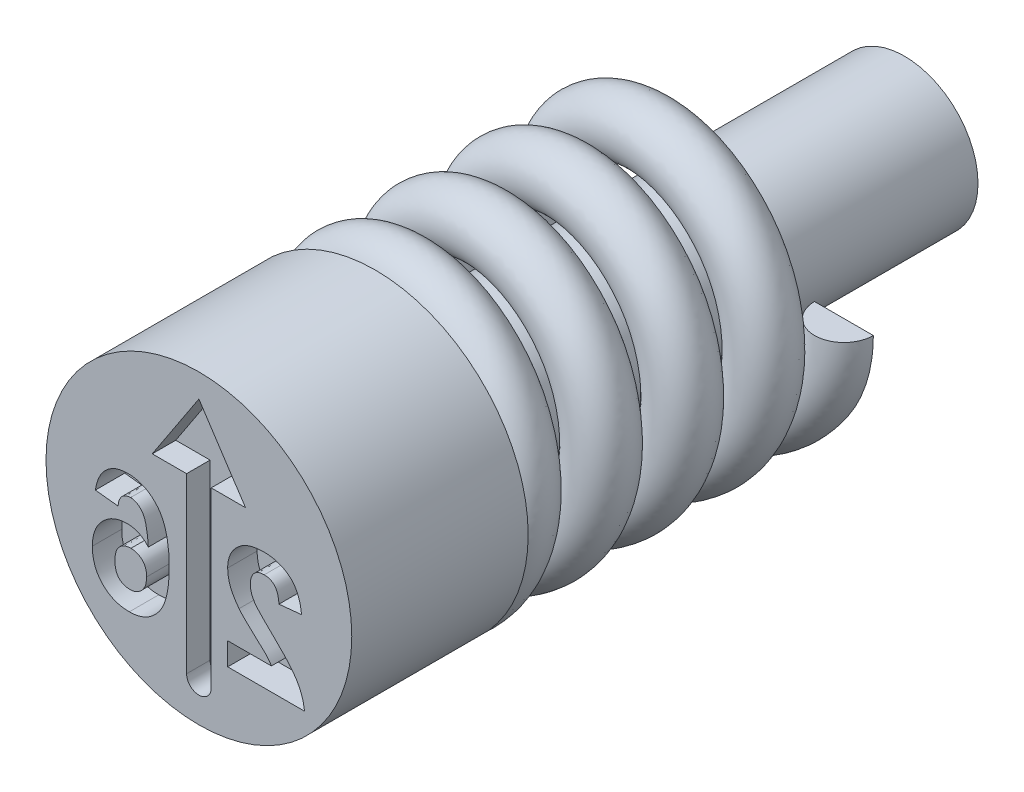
ISO-10303-21;
HEADER;
FILE_DESCRIPTION(('STEP AP214'),'2;1');
FILE_NAME('part.step','',(''),(''),'','','');
FILE_SCHEMA(('AUTOMOTIVE_DESIGN { 1 0 10303 214 1 1 1 1 }'));
ENDSEC;
DATA;
#1=APPLICATION_CONTEXT('core data for automotive mechanical design processes');
#2=APPLICATION_PROTOCOL_DEFINITION('international standard','automotive_design',2000,#1);
#3=PRODUCT_CONTEXT('',#1,'mechanical');
#4=PRODUCT('Part','Part','',(#3));
#5=PRODUCT_RELATED_PRODUCT_CATEGORY('part','',(#4));
#6=PRODUCT_DEFINITION_FORMATION('','',#4);
#7=PRODUCT_DEFINITION_CONTEXT('part definition',#1,'design');
#8=PRODUCT_DEFINITION('design','',#6,#7);
#9=PRODUCT_DEFINITION_SHAPE('','',#8);
#10=(LENGTH_UNIT() NAMED_UNIT(*) SI_UNIT(.MILLI.,.METRE.));
#11=(NAMED_UNIT(*) PLANE_ANGLE_UNIT() SI_UNIT($,.RADIAN.));
#12=(NAMED_UNIT(*) SI_UNIT($,.STERADIAN.) SOLID_ANGLE_UNIT());
#13=UNCERTAINTY_MEASURE_WITH_UNIT(LENGTH_MEASURE(1.E-05),#10,'distance_accuracy_value','');
#14=(GEOMETRIC_REPRESENTATION_CONTEXT(3) GLOBAL_UNCERTAINTY_ASSIGNED_CONTEXT((#13)) GLOBAL_UNIT_ASSIGNED_CONTEXT((#10,
#11,#12)) REPRESENTATION_CONTEXT('',''));
#15=CARTESIAN_POINT('',(0.,0.,0.));
#16=DIRECTION('',(0.,0.,1.));
#17=DIRECTION('',(1.,0.,0.));
#18=AXIS2_PLACEMENT_3D('',#15,#16,#17);
#19=CARTESIAN_POINT('',(2.1,0.,-9.37));
#20=DIRECTION('',(0.,-1.,0.));
#21=DIRECTION('',(0.,0.,-1.));
#22=AXIS2_PLACEMENT_3D('',#19,#20,#21);
#23=PLANE('',#22);
#24=CARTESIAN_POINT('',(2.1,0.,-8.87));
#25=DIRECTION('',(0.,1.,0.));
#26=DIRECTION('',(0.,0.,1.));
#27=AXIS2_PLACEMENT_3D('',#24,#25,#26);
#28=CIRCLE('',#27,0.5);
#29=CARTESIAN_POINT('',(1.6,0.,-8.87));
#30=VERTEX_POINT('',#29);
#31=CARTESIAN_POINT('',(2.6,0.,-8.87));
#32=VERTEX_POINT('',#31);
#33=EDGE_CURVE('E92',#30,#32,#28,.T.);
#34=ORIENTED_EDGE('',*,*,#33,.T.);
#35=DIRECTION('',(-1.,0.,0.));
#36=VECTOR('',#35,1.);
#37=CARTESIAN_POINT('',(2.1,0.,-8.87));
#38=LINE('',#37,#36);
#39=EDGE_CURVE('E79',#32,#30,#38,.T.);
#40=ORIENTED_EDGE('',*,*,#39,.T.);
#41=EDGE_LOOP('',(#34,#40));
#42=FACE_BOUND('',#41,.T.);
#43=ADVANCED_FACE('F53',(#42),#23,.F.);
#44=CARTESIAN_POINT('',(0.,-2.1,-3.5));
#45=DIRECTION('',(-1.,0.,0.));
#46=DIRECTION('',(0.,-1.,0.));
#47=AXIS2_PLACEMENT_3D('',#44,#45,#46);
#48=PLANE('',#47);
#49=DIRECTION('',(0.,-1.,0.));
#50=VECTOR('',#49,1.);
#51=CARTESIAN_POINT('',(0.,-2.1,-3.));
#52=LINE('',#51,#50);
#53=CARTESIAN_POINT('',(0.,-1.6,-3.));
#54=VERTEX_POINT('',#53);
#55=CARTESIAN_POINT('',(0.,-2.6,-3.));
#56=VERTEX_POINT('',#55);
#57=EDGE_CURVE('E73',#54,#56,#52,.T.);
#58=ORIENTED_EDGE('',*,*,#57,.F.);
#59=CARTESIAN_POINT('',(0.,-2.1,-3.));
#60=DIRECTION('',(-1.,0.,0.));
#61=DIRECTION('',(0.,-1.,0.));
#62=AXIS2_PLACEMENT_3D('',#59,#60,#61);
#63=CIRCLE('',#62,0.5);
#64=EDGE_CURVE('E89',#54,#56,#63,.T.);
#65=ORIENTED_EDGE('',*,*,#64,.T.);
#66=EDGE_LOOP('',(#58,#65));
#67=FACE_BOUND('',#66,.T.);
#68=ADVANCED_FACE('F55',(#67),#48,.T.);
#69=CARTESIAN_POINT('',(2.1,0.,-8.37));
#70=CARTESIAN_POINT('',(2.1,-0.8698484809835,-8.28367647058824));
#71=CARTESIAN_POINT('',(1.48492424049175,-1.48492424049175,-8.19735294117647));
#72=CARTESIAN_POINT('',(0.8698484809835,-2.1,-8.11102941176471));
#73=CARTESIAN_POINT('',(0.,-2.1,-8.02470588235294));
#74=CARTESIAN_POINT('',(-0.8698484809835,-2.1,-7.93838235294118));
#75=CARTESIAN_POINT('',(-1.48492424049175,-1.48492424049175,-7.85205882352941));
#76=CARTESIAN_POINT('',(-2.1,-0.8698484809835,-7.76573529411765));
#77=CARTESIAN_POINT('',(-2.1,0.,-7.67941176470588));
#78=CARTESIAN_POINT('',(-2.1,0.869848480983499,-7.59308823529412));
#79=CARTESIAN_POINT('',(-1.48492424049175,1.48492424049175,-7.50676470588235));
#80=CARTESIAN_POINT('',(-0.869848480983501,2.1,-7.42044117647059));
#81=CARTESIAN_POINT('',(0.,2.1,-7.33411764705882));
#82=CARTESIAN_POINT('',(0.8698484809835,2.1,-7.24779411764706));
#83=CARTESIAN_POINT('',(1.48492424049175,1.48492424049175,-7.1614705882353));
#84=CARTESIAN_POINT('',(2.1,0.869848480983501,-7.07514705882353));
#85=CARTESIAN_POINT('',(2.1,0.,-6.98882352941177));
#86=CARTESIAN_POINT('',(2.1,-0.8698484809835,-6.9025));
#87=CARTESIAN_POINT('',(1.48492424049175,-1.48492424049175,-6.81617647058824));
#88=CARTESIAN_POINT('',(0.8698484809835,-2.1,-6.72985294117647));
#89=CARTESIAN_POINT('',(0.,-2.1,-6.64352941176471));
#90=CARTESIAN_POINT('',(-0.8698484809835,-2.1,-6.55720588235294));
#91=CARTESIAN_POINT('',(-1.48492424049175,-1.48492424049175,-6.47088235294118));
#92=CARTESIAN_POINT('',(-2.1,-0.8698484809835,-6.38455882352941));
#93=CARTESIAN_POINT('',(-2.1,0.,-6.29823529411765));
#94=CARTESIAN_POINT('',(-2.1,0.869848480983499,-6.21191176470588));
#95=CARTESIAN_POINT('',(-1.48492424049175,1.48492424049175,-6.12558823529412));
#96=CARTESIAN_POINT('',(-0.869848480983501,2.1,-6.03926470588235));
#97=CARTESIAN_POINT('',(0.,2.1,-5.95294117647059));
#98=CARTESIAN_POINT('',(0.8698484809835,2.1,-5.86661764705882));
#99=CARTESIAN_POINT('',(1.48492424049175,1.48492424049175,-5.78029411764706));
#100=CARTESIAN_POINT('',(2.1,0.869848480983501,-5.6939705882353));
#101=CARTESIAN_POINT('',(2.1,0.,-5.60764705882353));
#102=CARTESIAN_POINT('',(2.1,-0.8698484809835,-5.52132352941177));
#103=CARTESIAN_POINT('',(1.48492424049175,-1.48492424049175,-5.435));
#104=CARTESIAN_POINT('',(0.8698484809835,-2.1,-5.34867647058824));
#105=CARTESIAN_POINT('',(0.,-2.1,-5.26235294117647));
#106=CARTESIAN_POINT('',(-0.8698484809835,-2.1,-5.17602941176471));
#107=CARTESIAN_POINT('',(-1.48492424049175,-1.48492424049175,-5.08970588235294));
#108=CARTESIAN_POINT('',(-2.1,-0.8698484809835,-5.00338235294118));
#109=CARTESIAN_POINT('',(-2.1,0.,-4.91705882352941));
#110=CARTESIAN_POINT('',(-2.1,0.869848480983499,-4.83073529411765));
#111=CARTESIAN_POINT('',(-1.48492424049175,1.48492424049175,-4.74441176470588));
#112=CARTESIAN_POINT('',(-0.869848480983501,2.1,-4.65808823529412));
#113=CARTESIAN_POINT('',(0.,2.1,-4.57176470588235));
#114=CARTESIAN_POINT('',(0.8698484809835,2.1,-4.48544117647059));
#115=CARTESIAN_POINT('',(1.48492424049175,1.48492424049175,-4.39911764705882));
#116=CARTESIAN_POINT('',(2.1,0.869848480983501,-4.31279411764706));
#117=CARTESIAN_POINT('',(2.1,0.,-4.2264705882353));
#118=CARTESIAN_POINT('',(2.1,-0.8698484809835,-4.14014705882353));
#119=CARTESIAN_POINT('',(1.48492424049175,-1.48492424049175,-4.05382352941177));
#120=CARTESIAN_POINT('',(0.8698484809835,-2.1,-3.9675));
#121=CARTESIAN_POINT('',(0.,-2.1,-3.88117647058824));
#122=CARTESIAN_POINT('',(-0.8698484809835,-2.1,-3.79485294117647));
#123=CARTESIAN_POINT('',(-1.48492424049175,-1.48492424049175,-3.70852941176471));
#124=CARTESIAN_POINT('',(-2.1,-0.8698484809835,-3.62220588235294));
#125=CARTESIAN_POINT('',(-2.1,0.,-3.53588235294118));
#126=CARTESIAN_POINT('',(-2.1,0.869848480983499,-3.44955882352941));
#127=CARTESIAN_POINT('',(-1.48492424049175,1.48492424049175,-3.36323529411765));
#128=CARTESIAN_POINT('',(-0.869848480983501,2.1,-3.27691176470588));
#129=CARTESIAN_POINT('',(0.,2.1,-3.19058823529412));
#130=CARTESIAN_POINT('',(0.8698484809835,2.1,-3.10426470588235));
#131=CARTESIAN_POINT('',(1.48492424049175,1.48492424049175,-3.01794117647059));
#132=CARTESIAN_POINT('',(2.1,0.869848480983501,-2.93161764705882));
#133=CARTESIAN_POINT('',(2.1,0.,-2.84529411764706));
#134=CARTESIAN_POINT('',(2.1,-0.8698484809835,-2.7589705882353));
#135=CARTESIAN_POINT('',(1.48492424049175,-1.48492424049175,-2.67264705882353));
#136=CARTESIAN_POINT('',(0.8698484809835,-2.1,-2.58632352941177));
#137=CARTESIAN_POINT('',(0.,-2.1,-2.5));
#138=CARTESIAN_POINT('',(3.1,0.,-8.37));
#139=CARTESIAN_POINT('',(3.1,-1.2840620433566,-8.28367647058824));
#140=CARTESIAN_POINT('',(2.1920310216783,-2.1920310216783,-8.19735294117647));
#141=CARTESIAN_POINT('',(1.2840620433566,-3.1,-8.11102941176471));
#142=CARTESIAN_POINT('',(0.,-3.1,-8.02470588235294));
#143=CARTESIAN_POINT('',(-1.28406204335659,-3.1,-7.93838235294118));
#144=CARTESIAN_POINT('',(-2.1920310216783,-2.1920310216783,-7.85205882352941));
#145=CARTESIAN_POINT('',(-3.1,-1.2840620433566,-7.76573529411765));
#146=CARTESIAN_POINT('',(-3.1,0.,-7.67941176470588));
#147=CARTESIAN_POINT('',(-3.1,1.28406204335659,-7.59308823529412));
#148=CARTESIAN_POINT('',(-2.1920310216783,2.1920310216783,-7.50676470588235));
#149=CARTESIAN_POINT('',(-1.2840620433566,3.1,-7.42044117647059));
#150=CARTESIAN_POINT('',(0.,3.1,-7.33411764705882));
#151=CARTESIAN_POINT('',(1.2840620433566,3.1,-7.24779411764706));
#152=CARTESIAN_POINT('',(2.1920310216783,2.1920310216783,-7.1614705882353));
#153=CARTESIAN_POINT('',(3.1,1.2840620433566,-7.07514705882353));
#154=CARTESIAN_POINT('',(3.1,0.,-6.98882352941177));
#155=CARTESIAN_POINT('',(3.1,-1.2840620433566,-6.9025));
#156=CARTESIAN_POINT('',(2.1920310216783,-2.1920310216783,-6.81617647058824));
#157=CARTESIAN_POINT('',(1.2840620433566,-3.1,-6.72985294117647));
#158=CARTESIAN_POINT('',(0.,-3.1,-6.64352941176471));
#159=CARTESIAN_POINT('',(-1.28406204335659,-3.1,-6.55720588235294));
#160=CARTESIAN_POINT('',(-2.1920310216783,-2.1920310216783,-6.47088235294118));
#161=CARTESIAN_POINT('',(-3.1,-1.2840620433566,-6.38455882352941));
#162=CARTESIAN_POINT('',(-3.1,0.,-6.29823529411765));
#163=CARTESIAN_POINT('',(-3.1,1.28406204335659,-6.21191176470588));
#164=CARTESIAN_POINT('',(-2.1920310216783,2.1920310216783,-6.12558823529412));
#165=CARTESIAN_POINT('',(-1.2840620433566,3.1,-6.03926470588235));
#166=CARTESIAN_POINT('',(0.,3.1,-5.95294117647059));
#167=CARTESIAN_POINT('',(1.2840620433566,3.1,-5.86661764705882));
#168=CARTESIAN_POINT('',(2.1920310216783,2.1920310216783,-5.78029411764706));
#169=CARTESIAN_POINT('',(3.1,1.2840620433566,-5.69397058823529));
#170=CARTESIAN_POINT('',(3.1,0.,-5.60764705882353));
#171=CARTESIAN_POINT('',(3.1,-1.2840620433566,-5.52132352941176));
#172=CARTESIAN_POINT('',(2.1920310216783,-2.1920310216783,-5.435));
#173=CARTESIAN_POINT('',(1.2840620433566,-3.1,-5.34867647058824));
#174=CARTESIAN_POINT('',(0.,-3.1,-5.26235294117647));
#175=CARTESIAN_POINT('',(-1.28406204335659,-3.1,-5.17602941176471));
#176=CARTESIAN_POINT('',(-2.1920310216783,-2.1920310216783,-5.08970588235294));
#177=CARTESIAN_POINT('',(-3.1,-1.2840620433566,-5.00338235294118));
#178=CARTESIAN_POINT('',(-3.1,0.,-4.91705882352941));
#179=CARTESIAN_POINT('',(-3.1,1.28406204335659,-4.83073529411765));
#180=CARTESIAN_POINT('',(-2.1920310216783,2.1920310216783,-4.74441176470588));
#181=CARTESIAN_POINT('',(-1.2840620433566,3.1,-4.65808823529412));
#182=CARTESIAN_POINT('',(0.,3.1,-4.57176470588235));
#183=CARTESIAN_POINT('',(1.2840620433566,3.1,-4.48544117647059));
#184=CARTESIAN_POINT('',(2.1920310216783,2.1920310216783,-4.39911764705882));
#185=CARTESIAN_POINT('',(3.1,1.2840620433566,-4.31279411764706));
#186=CARTESIAN_POINT('',(3.1,0.,-4.2264705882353));
#187=CARTESIAN_POINT('',(3.1,-1.2840620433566,-4.14014705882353));
#188=CARTESIAN_POINT('',(2.1920310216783,-2.1920310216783,-4.05382352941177));
#189=CARTESIAN_POINT('',(1.2840620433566,-3.1,-3.9675));
#190=CARTESIAN_POINT('',(0.,-3.1,-3.88117647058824));
#191=CARTESIAN_POINT('',(-1.28406204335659,-3.1,-3.79485294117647));
#192=CARTESIAN_POINT('',(-2.1920310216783,-2.1920310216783,-3.70852941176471));
#193=CARTESIAN_POINT('',(-3.1,-1.2840620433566,-3.62220588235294));
#194=CARTESIAN_POINT('',(-3.1,0.,-3.53588235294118));
#195=CARTESIAN_POINT('',(-3.1,1.28406204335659,-3.44955882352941));
#196=CARTESIAN_POINT('',(-2.1920310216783,2.1920310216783,-3.36323529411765));
#197=CARTESIAN_POINT('',(-1.2840620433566,3.1,-3.27691176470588));
#198=CARTESIAN_POINT('',(0.,3.1,-3.19058823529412));
#199=CARTESIAN_POINT('',(1.2840620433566,3.1,-3.10426470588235));
#200=CARTESIAN_POINT('',(2.1920310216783,2.1920310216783,-3.01794117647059));
#201=CARTESIAN_POINT('',(3.1,1.2840620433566,-2.93161764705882));
#202=CARTESIAN_POINT('',(3.1,0.,-2.84529411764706));
#203=CARTESIAN_POINT('',(3.1,-1.2840620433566,-2.75897058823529));
#204=CARTESIAN_POINT('',(2.1920310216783,-2.1920310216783,-2.67264705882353));
#205=CARTESIAN_POINT('',(1.2840620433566,-3.1,-2.58632352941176));
#206=CARTESIAN_POINT('',(0.,-3.1,-2.5));
#207=CARTESIAN_POINT('',(3.1,0.,-9.37));
#208=CARTESIAN_POINT('',(3.1,-1.2840620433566,-9.28367647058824));
#209=CARTESIAN_POINT('',(2.1920310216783,-2.1920310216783,-9.19735294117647));
#210=CARTESIAN_POINT('',(1.2840620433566,-3.1,-9.11102941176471));
#211=CARTESIAN_POINT('',(0.,-3.1,-9.02470588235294));
#212=CARTESIAN_POINT('',(-1.28406204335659,-3.1,-8.93838235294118));
#213=CARTESIAN_POINT('',(-2.1920310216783,-2.1920310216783,-8.85205882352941));
#214=CARTESIAN_POINT('',(-3.1,-1.2840620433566,-8.76573529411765));
#215=CARTESIAN_POINT('',(-3.1,0.,-8.67941176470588));
#216=CARTESIAN_POINT('',(-3.1,1.28406204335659,-8.59308823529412));
#217=CARTESIAN_POINT('',(-2.1920310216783,2.1920310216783,-8.50676470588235));
#218=CARTESIAN_POINT('',(-1.2840620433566,3.1,-8.42044117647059));
#219=CARTESIAN_POINT('',(0.,3.1,-8.33411764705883));
#220=CARTESIAN_POINT('',(1.2840620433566,3.1,-8.24779411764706));
#221=CARTESIAN_POINT('',(2.1920310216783,2.1920310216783,-8.16147058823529));
#222=CARTESIAN_POINT('',(3.1,1.2840620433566,-8.07514705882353));
#223=CARTESIAN_POINT('',(3.1,0.,-7.98882352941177));
#224=CARTESIAN_POINT('',(3.1,-1.2840620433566,-7.9025));
#225=CARTESIAN_POINT('',(2.1920310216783,-2.1920310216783,-7.81617647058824));
#226=CARTESIAN_POINT('',(1.2840620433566,-3.1,-7.72985294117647));
#227=CARTESIAN_POINT('',(0.,-3.1,-7.64352941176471));
#228=CARTESIAN_POINT('',(-1.28406204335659,-3.1,-7.55720588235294));
#229=CARTESIAN_POINT('',(-2.1920310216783,-2.1920310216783,-7.47088235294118));
#230=CARTESIAN_POINT('',(-3.1,-1.2840620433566,-7.38455882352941));
#231=CARTESIAN_POINT('',(-3.1,0.,-7.29823529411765));
#232=CARTESIAN_POINT('',(-3.1,1.28406204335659,-7.21191176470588));
#233=CARTESIAN_POINT('',(-2.1920310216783,2.1920310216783,-7.12558823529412));
#234=CARTESIAN_POINT('',(-1.2840620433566,3.1,-7.03926470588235));
#235=CARTESIAN_POINT('',(0.,3.1,-6.95294117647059));
#236=CARTESIAN_POINT('',(1.2840620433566,3.1,-6.86661764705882));
#237=CARTESIAN_POINT('',(2.1920310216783,2.1920310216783,-6.78029411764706));
#238=CARTESIAN_POINT('',(3.1,1.2840620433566,-6.6939705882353));
#239=CARTESIAN_POINT('',(3.1,0.,-6.60764705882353));
#240=CARTESIAN_POINT('',(3.1,-1.2840620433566,-6.52132352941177));
#241=CARTESIAN_POINT('',(2.1920310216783,-2.1920310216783,-6.435));
#242=CARTESIAN_POINT('',(1.2840620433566,-3.1,-6.34867647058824));
#243=CARTESIAN_POINT('',(0.,-3.1,-6.26235294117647));
#244=CARTESIAN_POINT('',(-1.28406204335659,-3.1,-6.17602941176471));
#245=CARTESIAN_POINT('',(-2.1920310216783,-2.1920310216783,-6.08970588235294));
#246=CARTESIAN_POINT('',(-3.1,-1.2840620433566,-6.00338235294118));
#247=CARTESIAN_POINT('',(-3.1,0.,-5.91705882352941));
#248=CARTESIAN_POINT('',(-3.1,1.28406204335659,-5.83073529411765));
#249=CARTESIAN_POINT('',(-2.1920310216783,2.1920310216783,-5.74441176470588));
#250=CARTESIAN_POINT('',(-1.2840620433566,3.1,-5.65808823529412));
#251=CARTESIAN_POINT('',(0.,3.1,-5.57176470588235));
#252=CARTESIAN_POINT('',(1.2840620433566,3.1,-5.48544117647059));
#253=CARTESIAN_POINT('',(2.1920310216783,2.1920310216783,-5.39911764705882));
#254=CARTESIAN_POINT('',(3.1,1.2840620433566,-5.31279411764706));
#255=CARTESIAN_POINT('',(3.1,0.,-5.2264705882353));
#256=CARTESIAN_POINT('',(3.1,-1.2840620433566,-5.14014705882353));
#257=CARTESIAN_POINT('',(2.1920310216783,-2.1920310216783,-5.05382352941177));
#258=CARTESIAN_POINT('',(1.2840620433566,-3.1,-4.9675));
#259=CARTESIAN_POINT('',(0.,-3.1,-4.88117647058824));
#260=CARTESIAN_POINT('',(-1.28406204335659,-3.1,-4.79485294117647));
#261=CARTESIAN_POINT('',(-2.1920310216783,-2.1920310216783,-4.70852941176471));
#262=CARTESIAN_POINT('',(-3.1,-1.2840620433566,-4.62220588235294));
#263=CARTESIAN_POINT('',(-3.1,0.,-4.53588235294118));
#264=CARTESIAN_POINT('',(-3.1,1.28406204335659,-4.44955882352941));
#265=CARTESIAN_POINT('',(-2.1920310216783,2.1920310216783,-4.36323529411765));
#266=CARTESIAN_POINT('',(-1.2840620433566,3.1,-4.27691176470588));
#267=CARTESIAN_POINT('',(0.,3.1,-4.19058823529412));
#268=CARTESIAN_POINT('',(1.2840620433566,3.1,-4.10426470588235));
#269=CARTESIAN_POINT('',(2.1920310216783,2.1920310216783,-4.01794117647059));
#270=CARTESIAN_POINT('',(3.1,1.2840620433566,-3.93161764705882));
#271=CARTESIAN_POINT('',(3.1,0.,-3.84529411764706));
#272=CARTESIAN_POINT('',(3.1,-1.2840620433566,-3.7589705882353));
#273=CARTESIAN_POINT('',(2.1920310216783,-2.1920310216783,-3.67264705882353));
#274=CARTESIAN_POINT('',(1.2840620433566,-3.1,-3.58632352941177));
#275=CARTESIAN_POINT('',(0.,-3.1,-3.5));
#276=CARTESIAN_POINT('',(2.1,0.,-9.37));
#277=CARTESIAN_POINT('',(2.1,-0.8698484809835,-9.28367647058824));
#278=CARTESIAN_POINT('',(1.48492424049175,-1.48492424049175,-9.19735294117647));
#279=CARTESIAN_POINT('',(0.8698484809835,-2.1,-9.11102941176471));
#280=CARTESIAN_POINT('',(0.,-2.1,-9.02470588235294));
#281=CARTESIAN_POINT('',(-0.8698484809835,-2.1,-8.93838235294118));
#282=CARTESIAN_POINT('',(-1.48492424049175,-1.48492424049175,-8.85205882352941));
#283=CARTESIAN_POINT('',(-2.1,-0.8698484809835,-8.76573529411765));
#284=CARTESIAN_POINT('',(-2.1,0.,-8.67941176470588));
#285=CARTESIAN_POINT('',(-2.1,0.869848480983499,-8.59308823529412));
#286=CARTESIAN_POINT('',(-1.48492424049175,1.48492424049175,-8.50676470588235));
#287=CARTESIAN_POINT('',(-0.869848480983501,2.1,-8.42044117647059));
#288=CARTESIAN_POINT('',(0.,2.1,-8.33411764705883));
#289=CARTESIAN_POINT('',(0.8698484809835,2.1,-8.24779411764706));
#290=CARTESIAN_POINT('',(1.48492424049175,1.48492424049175,-8.1614705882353));
#291=CARTESIAN_POINT('',(2.1,0.869848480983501,-8.07514705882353));
#292=CARTESIAN_POINT('',(2.1,0.,-7.98882352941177));
#293=CARTESIAN_POINT('',(2.1,-0.8698484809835,-7.9025));
#294=CARTESIAN_POINT('',(1.48492424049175,-1.48492424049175,-7.81617647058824));
#295=CARTESIAN_POINT('',(0.8698484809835,-2.1,-7.72985294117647));
#296=CARTESIAN_POINT('',(0.,-2.1,-7.64352941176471));
#297=CARTESIAN_POINT('',(-0.8698484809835,-2.1,-7.55720588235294));
#298=CARTESIAN_POINT('',(-1.48492424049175,-1.48492424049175,-7.47088235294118));
#299=CARTESIAN_POINT('',(-2.1,-0.8698484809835,-7.38455882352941));
#300=CARTESIAN_POINT('',(-2.1,0.,-7.29823529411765));
#301=CARTESIAN_POINT('',(-2.1,0.869848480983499,-7.21191176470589));
#302=CARTESIAN_POINT('',(-1.48492424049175,1.48492424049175,-7.12558823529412));
#303=CARTESIAN_POINT('',(-0.869848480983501,2.1,-7.03926470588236));
#304=CARTESIAN_POINT('',(0.,2.1,-6.95294117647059));
#305=CARTESIAN_POINT('',(0.8698484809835,2.1,-6.86661764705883));
#306=CARTESIAN_POINT('',(1.48492424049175,1.48492424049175,-6.78029411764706));
#307=CARTESIAN_POINT('',(2.1,0.869848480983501,-6.6939705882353));
#308=CARTESIAN_POINT('',(2.1,0.,-6.60764705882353));
#309=CARTESIAN_POINT('',(2.1,-0.8698484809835,-6.52132352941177));
#310=CARTESIAN_POINT('',(1.48492424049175,-1.48492424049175,-6.435));
#311=CARTESIAN_POINT('',(0.8698484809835,-2.1,-6.34867647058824));
#312=CARTESIAN_POINT('',(0.,-2.1,-6.26235294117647));
#313=CARTESIAN_POINT('',(-0.8698484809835,-2.1,-6.17602941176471));
#314=CARTESIAN_POINT('',(-1.48492424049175,-1.48492424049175,-6.08970588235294));
#315=CARTESIAN_POINT('',(-2.1,-0.8698484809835,-6.00338235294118));
#316=CARTESIAN_POINT('',(-2.1,0.,-5.91705882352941));
#317=CARTESIAN_POINT('',(-2.1,0.869848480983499,-5.83073529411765));
#318=CARTESIAN_POINT('',(-1.48492424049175,1.48492424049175,-5.74441176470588));
#319=CARTESIAN_POINT('',(-0.869848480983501,2.1,-5.65808823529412));
#320=CARTESIAN_POINT('',(0.,2.1,-5.57176470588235));
#321=CARTESIAN_POINT('',(0.8698484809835,2.1,-5.48544117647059));
#322=CARTESIAN_POINT('',(1.48492424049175,1.48492424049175,-5.39911764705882));
#323=CARTESIAN_POINT('',(2.1,0.869848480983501,-5.31279411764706));
#324=CARTESIAN_POINT('',(2.1,0.,-5.2264705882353));
#325=CARTESIAN_POINT('',(2.1,-0.8698484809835,-5.14014705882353));
#326=CARTESIAN_POINT('',(1.48492424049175,-1.48492424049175,-5.05382352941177));
#327=CARTESIAN_POINT('',(0.8698484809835,-2.1,-4.9675));
#328=CARTESIAN_POINT('',(0.,-2.1,-4.88117647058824));
#329=CARTESIAN_POINT('',(-0.8698484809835,-2.1,-4.79485294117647));
#330=CARTESIAN_POINT('',(-1.48492424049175,-1.48492424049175,-4.70852941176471));
#331=CARTESIAN_POINT('',(-2.1,-0.8698484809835,-4.62220588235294));
#332=CARTESIAN_POINT('',(-2.1,0.,-4.53588235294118));
#333=CARTESIAN_POINT('',(-2.1,0.869848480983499,-4.44955882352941));
#334=CARTESIAN_POINT('',(-1.48492424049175,1.48492424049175,-4.36323529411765));
#335=CARTESIAN_POINT('',(-0.869848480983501,2.1,-4.27691176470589));
#336=CARTESIAN_POINT('',(0.,2.1,-4.19058823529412));
#337=CARTESIAN_POINT('',(0.8698484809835,2.1,-4.10426470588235));
#338=CARTESIAN_POINT('',(1.48492424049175,1.48492424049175,-4.01794117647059));
#339=CARTESIAN_POINT('',(2.1,0.869848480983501,-3.93161764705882));
#340=CARTESIAN_POINT('',(2.1,0.,-3.84529411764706));
#341=CARTESIAN_POINT('',(2.1,-0.8698484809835,-3.7589705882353));
#342=CARTESIAN_POINT('',(1.48492424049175,-1.48492424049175,-3.67264705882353));
#343=CARTESIAN_POINT('',(0.8698484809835,-2.1,-3.58632352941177));
#344=CARTESIAN_POINT('',(0.,-2.1,-3.5));
#345=CARTESIAN_POINT('',(1.1,0.,-9.37));
#346=CARTESIAN_POINT('',(1.1,-0.455634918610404,-9.28367647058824));
#347=CARTESIAN_POINT('',(0.777817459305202,-0.777817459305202,-9.19735294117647));
#348=CARTESIAN_POINT('',(0.455634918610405,-1.1,-9.11102941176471));
#349=CARTESIAN_POINT('',(0.,-1.1,-9.02470588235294));
#350=CARTESIAN_POINT('',(-0.455634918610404,-1.1,-8.93838235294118));
#351=CARTESIAN_POINT('',(-0.777817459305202,-0.777817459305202,-8.85205882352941));
#352=CARTESIAN_POINT('',(-1.1,-0.455634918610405,-8.76573529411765));
#353=CARTESIAN_POINT('',(-1.1,0.,-8.67941176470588));
#354=CARTESIAN_POINT('',(-1.1,0.455634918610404,-8.59308823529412));
#355=CARTESIAN_POINT('',(-0.777817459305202,0.777817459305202,-8.50676470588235));
#356=CARTESIAN_POINT('',(-0.455634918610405,1.1,-8.42044117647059));
#357=CARTESIAN_POINT('',(0.,1.1,-8.33411764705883));
#358=CARTESIAN_POINT('',(0.455634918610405,1.1,-8.24779411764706));
#359=CARTESIAN_POINT('',(0.777817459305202,0.777817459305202,-8.16147058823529));
#360=CARTESIAN_POINT('',(1.1,0.455634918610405,-8.07514705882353));
#361=CARTESIAN_POINT('',(1.1,0.,-7.98882352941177));
#362=CARTESIAN_POINT('',(1.1,-0.455634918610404,-7.9025));
#363=CARTESIAN_POINT('',(0.777817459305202,-0.777817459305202,-7.81617647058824));
#364=CARTESIAN_POINT('',(0.455634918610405,-1.1,-7.72985294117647));
#365=CARTESIAN_POINT('',(0.,-1.1,-7.64352941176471));
#366=CARTESIAN_POINT('',(-0.455634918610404,-1.1,-7.55720588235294));
#367=CARTESIAN_POINT('',(-0.777817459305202,-0.777817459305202,-7.47088235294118));
#368=CARTESIAN_POINT('',(-1.1,-0.455634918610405,-7.38455882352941));
#369=CARTESIAN_POINT('',(-1.1,0.,-7.29823529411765));
#370=CARTESIAN_POINT('',(-1.1,0.455634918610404,-7.21191176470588));
#371=CARTESIAN_POINT('',(-0.777817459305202,0.777817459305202,-7.12558823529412));
#372=CARTESIAN_POINT('',(-0.455634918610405,1.1,-7.03926470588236));
#373=CARTESIAN_POINT('',(0.,1.1,-6.95294117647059));
#374=CARTESIAN_POINT('',(0.455634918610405,1.1,-6.86661764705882));
#375=CARTESIAN_POINT('',(0.777817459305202,0.777817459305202,-6.78029411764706));
#376=CARTESIAN_POINT('',(1.1,0.455634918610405,-6.6939705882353));
#377=CARTESIAN_POINT('',(1.1,0.,-6.60764705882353));
#378=CARTESIAN_POINT('',(1.1,-0.455634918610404,-6.52132352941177));
#379=CARTESIAN_POINT('',(0.777817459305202,-0.777817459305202,-6.435));
#380=CARTESIAN_POINT('',(0.455634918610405,-1.1,-6.34867647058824));
#381=CARTESIAN_POINT('',(0.,-1.1,-6.26235294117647));
#382=CARTESIAN_POINT('',(-0.455634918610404,-1.1,-6.17602941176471));
#383=CARTESIAN_POINT('',(-0.777817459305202,-0.777817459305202,-6.08970588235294));
#384=CARTESIAN_POINT('',(-1.1,-0.455634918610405,-6.00338235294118));
#385=CARTESIAN_POINT('',(-1.1,0.,-5.91705882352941));
#386=CARTESIAN_POINT('',(-1.1,0.455634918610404,-5.83073529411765));
#387=CARTESIAN_POINT('',(-0.777817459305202,0.777817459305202,-5.74441176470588));
#388=CARTESIAN_POINT('',(-0.455634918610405,1.1,-5.65808823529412));
#389=CARTESIAN_POINT('',(0.,1.1,-5.57176470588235));
#390=CARTESIAN_POINT('',(0.455634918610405,1.1,-5.48544117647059));
#391=CARTESIAN_POINT('',(0.777817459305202,0.777817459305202,-5.39911764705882));
#392=CARTESIAN_POINT('',(1.1,0.455634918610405,-5.31279411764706));
#393=CARTESIAN_POINT('',(1.1,0.,-5.2264705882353));
#394=CARTESIAN_POINT('',(1.1,-0.455634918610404,-5.14014705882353));
#395=CARTESIAN_POINT('',(0.777817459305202,-0.777817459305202,-5.05382352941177));
#396=CARTESIAN_POINT('',(0.455634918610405,-1.1,-4.9675));
#397=CARTESIAN_POINT('',(0.,-1.1,-4.88117647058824));
#398=CARTESIAN_POINT('',(-0.455634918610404,-1.1,-4.79485294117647));
#399=CARTESIAN_POINT('',(-0.777817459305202,-0.777817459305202,-4.70852941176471));
#400=CARTESIAN_POINT('',(-1.1,-0.455634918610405,-4.62220588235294));
#401=CARTESIAN_POINT('',(-1.1,0.,-4.53588235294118));
#402=CARTESIAN_POINT('',(-1.1,0.455634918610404,-4.44955882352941));
#403=CARTESIAN_POINT('',(-0.777817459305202,0.777817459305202,-4.36323529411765));
#404=CARTESIAN_POINT('',(-0.455634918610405,1.1,-4.27691176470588));
#405=CARTESIAN_POINT('',(0.,1.1,-4.19058823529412));
#406=CARTESIAN_POINT('',(0.455634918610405,1.1,-4.10426470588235));
#407=CARTESIAN_POINT('',(0.777817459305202,0.777817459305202,-4.01794117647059));
#408=CARTESIAN_POINT('',(1.1,0.455634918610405,-3.93161764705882));
#409=CARTESIAN_POINT('',(1.1,0.,-3.84529411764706));
#410=CARTESIAN_POINT('',(1.1,-0.455634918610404,-3.7589705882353));
#411=CARTESIAN_POINT('',(0.777817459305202,-0.777817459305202,-3.67264705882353));
#412=CARTESIAN_POINT('',(0.455634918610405,-1.1,-3.58632352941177));
#413=CARTESIAN_POINT('',(0.,-1.1,-3.5));
#414=CARTESIAN_POINT('',(1.1,0.,-8.37));
#415=CARTESIAN_POINT('',(1.1,-0.455634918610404,-8.28367647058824));
#416=CARTESIAN_POINT('',(0.777817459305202,-0.777817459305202,-8.19735294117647));
#417=CARTESIAN_POINT('',(0.455634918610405,-1.1,-8.11102941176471));
#418=CARTESIAN_POINT('',(0.,-1.1,-8.02470588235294));
#419=CARTESIAN_POINT('',(-0.455634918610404,-1.1,-7.93838235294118));
#420=CARTESIAN_POINT('',(-0.777817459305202,-0.777817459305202,-7.85205882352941));
#421=CARTESIAN_POINT('',(-1.1,-0.455634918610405,-7.76573529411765));
#422=CARTESIAN_POINT('',(-1.1,0.,-7.67941176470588));
#423=CARTESIAN_POINT('',(-1.1,0.455634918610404,-7.59308823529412));
#424=CARTESIAN_POINT('',(-0.777817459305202,0.777817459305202,-7.50676470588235));
#425=CARTESIAN_POINT('',(-0.455634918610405,1.1,-7.42044117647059));
#426=CARTESIAN_POINT('',(0.,1.1,-7.33411764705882));
#427=CARTESIAN_POINT('',(0.455634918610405,1.1,-7.24779411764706));
#428=CARTESIAN_POINT('',(0.777817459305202,0.777817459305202,-7.1614705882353));
#429=CARTESIAN_POINT('',(1.1,0.455634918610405,-7.07514705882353));
#430=CARTESIAN_POINT('',(1.1,0.,-6.98882352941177));
#431=CARTESIAN_POINT('',(1.1,-0.455634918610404,-6.9025));
#432=CARTESIAN_POINT('',(0.777817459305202,-0.777817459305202,-6.81617647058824));
#433=CARTESIAN_POINT('',(0.455634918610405,-1.1,-6.72985294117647));
#434=CARTESIAN_POINT('',(0.,-1.1,-6.64352941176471));
#435=CARTESIAN_POINT('',(-0.455634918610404,-1.1,-6.55720588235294));
#436=CARTESIAN_POINT('',(-0.777817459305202,-0.777817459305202,-6.47088235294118));
#437=CARTESIAN_POINT('',(-1.1,-0.455634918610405,-6.38455882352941));
#438=CARTESIAN_POINT('',(-1.1,0.,-6.29823529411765));
#439=CARTESIAN_POINT('',(-1.1,0.455634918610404,-6.21191176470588));
#440=CARTESIAN_POINT('',(-0.777817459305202,0.777817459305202,-6.12558823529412));
#441=CARTESIAN_POINT('',(-0.455634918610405,1.1,-6.03926470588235));
#442=CARTESIAN_POINT('',(0.,1.1,-5.95294117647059));
#443=CARTESIAN_POINT('',(0.455634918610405,1.1,-5.86661764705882));
#444=CARTESIAN_POINT('',(0.777817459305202,0.777817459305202,-5.78029411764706));
#445=CARTESIAN_POINT('',(1.1,0.455634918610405,-5.69397058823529));
#446=CARTESIAN_POINT('',(1.1,0.,-5.60764705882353));
#447=CARTESIAN_POINT('',(1.1,-0.455634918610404,-5.52132352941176));
#448=CARTESIAN_POINT('',(0.777817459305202,-0.777817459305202,-5.435));
#449=CARTESIAN_POINT('',(0.455634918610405,-1.1,-5.34867647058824));
#450=CARTESIAN_POINT('',(0.,-1.1,-5.26235294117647));
#451=CARTESIAN_POINT('',(-0.455634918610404,-1.1,-5.17602941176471));
#452=CARTESIAN_POINT('',(-0.777817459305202,-0.777817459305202,-5.08970588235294));
#453=CARTESIAN_POINT('',(-1.1,-0.455634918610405,-5.00338235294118));
#454=CARTESIAN_POINT('',(-1.1,0.,-4.91705882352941));
#455=CARTESIAN_POINT('',(-1.1,0.455634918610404,-4.83073529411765));
#456=CARTESIAN_POINT('',(-0.777817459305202,0.777817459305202,-4.74441176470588));
#457=CARTESIAN_POINT('',(-0.455634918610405,1.1,-4.65808823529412));
#458=CARTESIAN_POINT('',(0.,1.1,-4.57176470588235));
#459=CARTESIAN_POINT('',(0.455634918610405,1.1,-4.48544117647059));
#460=CARTESIAN_POINT('',(0.777817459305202,0.777817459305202,-4.39911764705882));
#461=CARTESIAN_POINT('',(1.1,0.455634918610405,-4.31279411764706));
#462=CARTESIAN_POINT('',(1.1,0.,-4.2264705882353));
#463=CARTESIAN_POINT('',(1.1,-0.455634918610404,-4.14014705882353));
#464=CARTESIAN_POINT('',(0.777817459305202,-0.777817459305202,-4.05382352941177));
#465=CARTESIAN_POINT('',(0.455634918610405,-1.1,-3.9675));
#466=CARTESIAN_POINT('',(0.,-1.1,-3.88117647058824));
#467=CARTESIAN_POINT('',(-0.455634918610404,-1.1,-3.79485294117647));
#468=CARTESIAN_POINT('',(-0.777817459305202,-0.777817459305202,-3.70852941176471));
#469=CARTESIAN_POINT('',(-1.1,-0.455634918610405,-3.62220588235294));
#470=CARTESIAN_POINT('',(-1.1,0.,-3.53588235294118));
#471=CARTESIAN_POINT('',(-1.1,0.455634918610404,-3.44955882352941));
#472=CARTESIAN_POINT('',(-0.777817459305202,0.777817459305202,-3.36323529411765));
#473=CARTESIAN_POINT('',(-0.455634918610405,1.1,-3.27691176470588));
#474=CARTESIAN_POINT('',(0.,1.1,-3.19058823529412));
#475=CARTESIAN_POINT('',(0.455634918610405,1.1,-3.10426470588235));
#476=CARTESIAN_POINT('',(0.777817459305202,0.777817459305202,-3.01794117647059));
#477=CARTESIAN_POINT('',(1.1,0.455634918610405,-2.93161764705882));
#478=CARTESIAN_POINT('',(1.1,0.,-2.84529411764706));
#479=CARTESIAN_POINT('',(1.1,-0.455634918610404,-2.75897058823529));
#480=CARTESIAN_POINT('',(0.777817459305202,-0.777817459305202,-2.67264705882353));
#481=CARTESIAN_POINT('',(0.455634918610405,-1.1,-2.58632352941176));
#482=CARTESIAN_POINT('',(0.,-1.1,-2.5));
#483=CARTESIAN_POINT('',(2.1,0.,-8.37));
#484=CARTESIAN_POINT('',(2.1,-0.8698484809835,-8.28367647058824));
#485=CARTESIAN_POINT('',(1.48492424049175,-1.48492424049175,-8.19735294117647));
#486=CARTESIAN_POINT('',(0.8698484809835,-2.1,-8.11102941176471));
#487=CARTESIAN_POINT('',(0.,-2.1,-8.02470588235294));
#488=CARTESIAN_POINT('',(-0.8698484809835,-2.1,-7.93838235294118));
#489=CARTESIAN_POINT('',(-1.48492424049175,-1.48492424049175,-7.85205882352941));
#490=CARTESIAN_POINT('',(-2.1,-0.8698484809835,-7.76573529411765));
#491=CARTESIAN_POINT('',(-2.1,0.,-7.67941176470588));
#492=CARTESIAN_POINT('',(-2.1,0.869848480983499,-7.59308823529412));
#493=CARTESIAN_POINT('',(-1.48492424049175,1.48492424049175,-7.50676470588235));
#494=CARTESIAN_POINT('',(-0.869848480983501,2.1,-7.42044117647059));
#495=CARTESIAN_POINT('',(0.,2.1,-7.33411764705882));
#496=CARTESIAN_POINT('',(0.8698484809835,2.1,-7.24779411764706));
#497=CARTESIAN_POINT('',(1.48492424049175,1.48492424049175,-7.1614705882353));
#498=CARTESIAN_POINT('',(2.1,0.869848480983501,-7.07514705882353));
#499=CARTESIAN_POINT('',(2.1,0.,-6.98882352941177));
#500=CARTESIAN_POINT('',(2.1,-0.8698484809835,-6.9025));
#501=CARTESIAN_POINT('',(1.48492424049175,-1.48492424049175,-6.81617647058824));
#502=CARTESIAN_POINT('',(0.8698484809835,-2.1,-6.72985294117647));
#503=CARTESIAN_POINT('',(0.,-2.1,-6.64352941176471));
#504=CARTESIAN_POINT('',(-0.8698484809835,-2.1,-6.55720588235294));
#505=CARTESIAN_POINT('',(-1.48492424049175,-1.48492424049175,-6.47088235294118));
#506=CARTESIAN_POINT('',(-2.1,-0.8698484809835,-6.38455882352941));
#507=CARTESIAN_POINT('',(-2.1,0.,-6.29823529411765));
#508=CARTESIAN_POINT('',(-2.1,0.869848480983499,-6.21191176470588));
#509=CARTESIAN_POINT('',(-1.48492424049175,1.48492424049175,-6.12558823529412));
#510=CARTESIAN_POINT('',(-0.869848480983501,2.1,-6.03926470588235));
#511=CARTESIAN_POINT('',(0.,2.1,-5.95294117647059));
#512=CARTESIAN_POINT('',(0.8698484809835,2.1,-5.86661764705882));
#513=CARTESIAN_POINT('',(1.48492424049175,1.48492424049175,-5.78029411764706));
#514=CARTESIAN_POINT('',(2.1,0.869848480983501,-5.6939705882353));
#515=CARTESIAN_POINT('',(2.1,0.,-5.60764705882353));
#516=CARTESIAN_POINT('',(2.1,-0.8698484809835,-5.52132352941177));
#517=CARTESIAN_POINT('',(1.48492424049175,-1.48492424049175,-5.435));
#518=CARTESIAN_POINT('',(0.8698484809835,-2.1,-5.34867647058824));
#519=CARTESIAN_POINT('',(0.,-2.1,-5.26235294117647));
#520=CARTESIAN_POINT('',(-0.8698484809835,-2.1,-5.17602941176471));
#521=CARTESIAN_POINT('',(-1.48492424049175,-1.48492424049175,-5.08970588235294));
#522=CARTESIAN_POINT('',(-2.1,-0.8698484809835,-5.00338235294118));
#523=CARTESIAN_POINT('',(-2.1,0.,-4.91705882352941));
#524=CARTESIAN_POINT('',(-2.1,0.869848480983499,-4.83073529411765));
#525=CARTESIAN_POINT('',(-1.48492424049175,1.48492424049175,-4.74441176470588));
#526=CARTESIAN_POINT('',(-0.869848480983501,2.1,-4.65808823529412));
#527=CARTESIAN_POINT('',(0.,2.1,-4.57176470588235));
#528=CARTESIAN_POINT('',(0.8698484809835,2.1,-4.48544117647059));
#529=CARTESIAN_POINT('',(1.48492424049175,1.48492424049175,-4.39911764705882));
#530=CARTESIAN_POINT('',(2.1,0.869848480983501,-4.31279411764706));
#531=CARTESIAN_POINT('',(2.1,0.,-4.2264705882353));
#532=CARTESIAN_POINT('',(2.1,-0.8698484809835,-4.14014705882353));
#533=CARTESIAN_POINT('',(1.48492424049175,-1.48492424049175,-4.05382352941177));
#534=CARTESIAN_POINT('',(0.8698484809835,-2.1,-3.9675));
#535=CARTESIAN_POINT('',(0.,-2.1,-3.88117647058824));
#536=CARTESIAN_POINT('',(-0.8698484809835,-2.1,-3.79485294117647));
#537=CARTESIAN_POINT('',(-1.48492424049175,-1.48492424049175,-3.70852941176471));
#538=CARTESIAN_POINT('',(-2.1,-0.8698484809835,-3.62220588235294));
#539=CARTESIAN_POINT('',(-2.1,0.,-3.53588235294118));
#540=CARTESIAN_POINT('',(-2.1,0.869848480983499,-3.44955882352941));
#541=CARTESIAN_POINT('',(-1.48492424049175,1.48492424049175,-3.36323529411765));
#542=CARTESIAN_POINT('',(-0.869848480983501,2.1,-3.27691176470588));
#543=CARTESIAN_POINT('',(0.,2.1,-3.19058823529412));
#544=CARTESIAN_POINT('',(0.8698484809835,2.1,-3.10426470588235));
#545=CARTESIAN_POINT('',(1.48492424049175,1.48492424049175,-3.01794117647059));
#546=CARTESIAN_POINT('',(2.1,0.869848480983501,-2.93161764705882));
#547=CARTESIAN_POINT('',(2.1,0.,-2.84529411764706));
#548=CARTESIAN_POINT('',(2.1,-0.8698484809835,-2.7589705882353));
#549=CARTESIAN_POINT('',(1.48492424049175,-1.48492424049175,-2.67264705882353));
#550=CARTESIAN_POINT('',(0.8698484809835,-2.1,-2.58632352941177));
#551=CARTESIAN_POINT('',(0.,-2.1,-2.5));
#552=(BOUNDED_SURFACE() B_SPLINE_SURFACE(3,2,((#69,#70,#71,#72,#73,#74,#75,#76,#77,#78,#79,#80,
#81,#82,#83,#84,#85,#86,#87,#88,#89,#90,#91,#92,#93,#94,#95,#96,#97,#98,#99,#100,#101,#102,#103,
#104,#105,#106,#107,#108,#109,#110,#111,#112,#113,#114,#115,#116,#117,#118,#119,#120,#121,#122,
#123,#124,#125,#126,#127,#128,#129,#130,#131,#132,#133,#134,#135,#136,#137),(#138,#139,#140,
#141,#142,#143,#144,#145,#146,#147,#148,#149,#150,#151,#152,#153,#154,#155,#156,#157,#158,#159,
#160,#161,#162,#163,#164,#165,#166,#167,#168,#169,#170,#171,#172,#173,#174,#175,#176,#177,#178,
#179,#180,#181,#182,#183,#184,#185,#186,#187,#188,#189,#190,#191,#192,#193,#194,#195,#196,#197,
#198,#199,#200,#201,#202,#203,#204,#205,#206),(#207,#208,#209,#210,#211,#212,#213,#214,#215,
#216,#217,#218,#219,#220,#221,#222,#223,#224,#225,#226,#227,#228,#229,#230,#231,#232,#233,#234,
#235,#236,#237,#238,#239,#240,#241,#242,#243,#244,#245,#246,#247,#248,#249,#250,#251,#252,#253,
#254,#255,#256,#257,#258,#259,#260,#261,#262,#263,#264,#265,#266,#267,#268,#269,#270,#271,#272,
#273,#274,#275),(#276,#277,#278,#279,#280,#281,#282,#283,#284,#285,#286,#287,#288,#289,#290,
#291,#292,#293,#294,#295,#296,#297,#298,#299,#300,#301,#302,#303,#304,#305,#306,#307,#308,#309,
#310,#311,#312,#313,#314,#315,#316,#317,#318,#319,#320,#321,#322,#323,#324,#325,#326,#327,#328,
#329,#330,#331,#332,#333,#334,#335,#336,#337,#338,#339,#340,#341,#342,#343,#344),(#345,#346,
#347,#348,#349,#350,#351,#352,#353,#354,#355,#356,#357,#358,#359,#360,#361,#362,#363,#364,#365,
#366,#367,#368,#369,#370,#371,#372,#373,#374,#375,#376,#377,#378,#379,#380,#381,#382,#383,#384,
#385,#386,#387,#388,#389,#390,#391,#392,#393,#394,#395,#396,#397,#398,#399,#400,#401,#402,#403,
#404,#405,#406,#407,#408,#409,#410,#411,#412,#413),(#414,#415,#416,#417,#418,#419,#420,#421,
#422,#423,#424,#425,#426,#427,#428,#429,#430,#431,#432,#433,#434,#435,#436,#437,#438,#439,#440,
#441,#442,#443,#444,#445,#446,#447,#448,#449,#450,#451,#452,#453,#454,#455,#456,#457,#458,#459,
#460,#461,#462,#463,#464,#465,#466,#467,#468,#469,#470,#471,#472,#473,#474,#475,#476,#477,#478,
#479,#480,#481,#482),(#483,#484,#485,#486,#487,#488,#489,#490,#491,#492,#493,#494,#495,#496,
#497,#498,#499,#500,#501,#502,#503,#504,#505,#506,#507,#508,#509,#510,#511,#512,#513,#514,#515,
#516,#517,#518,#519,#520,#521,#522,#523,#524,#525,#526,#527,#528,#529,#530,#531,#532,#533,#534,
#535,#536,#537,#538,#539,#540,#541,#542,#543,#544,#545,#546,#547,#548,#549,#550,#551)),
.UNSPECIFIED.,.T.,.F.,.F.) B_SPLINE_SURFACE_WITH_KNOTS((4,3,4),(3,2,2,2,2,2,2,2,2,2,2,2,2,2,2,2,
2,2,2,2,2,2,2,2,2,2,2,2,2,2,2,2,2,2,3),(0.,0.5,1.),(0.,0.025,0.05,0.075,0.1,0.125,0.15,0.175,
0.2,0.225,0.25,0.275,0.3,0.325,0.35,0.375,0.4,0.425,0.45,0.475,0.5,0.525,0.55,0.575,0.6,0.625,
0.65,0.675,0.7,0.725,0.75,0.775,0.8,0.825,0.85),
.UNSPECIFIED.) GEOMETRIC_REPRESENTATION_ITEM() RATIONAL_B_SPLINE_SURFACE(((1.,0.923879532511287,
1.,0.923879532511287,1.,0.923879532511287,1.,0.923879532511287,1.,0.923879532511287,1.,
0.923879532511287,1.,0.923879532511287,1.,0.923879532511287,1.,0.923879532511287,1.,
0.923879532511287,1.,0.923879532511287,1.,0.923879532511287,1.,0.923879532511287,1.,
0.923879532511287,1.,0.923879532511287,1.,0.923879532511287,1.,0.923879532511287,1.,
0.923879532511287,1.,0.923879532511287,1.,0.923879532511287,1.,0.923879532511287,1.,
0.923879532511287,1.,0.923879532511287,1.,0.923879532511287,1.,0.923879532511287,1.,
0.923879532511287,1.,0.923879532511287,1.,0.923879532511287,1.,0.923879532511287,1.,
0.923879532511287,1.,0.923879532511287,1.,0.923879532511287,1.,0.923879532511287,1.,
0.923879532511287,1.),(0.333333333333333,0.307959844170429,0.333333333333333,0.307959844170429,
0.333333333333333,0.307959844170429,0.333333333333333,0.307959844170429,0.333333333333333,
0.307959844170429,0.333333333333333,0.307959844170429,0.333333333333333,0.307959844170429,
0.333333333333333,0.307959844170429,0.333333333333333,0.307959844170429,0.333333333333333,
0.307959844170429,0.333333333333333,0.307959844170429,0.333333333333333,0.307959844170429,
0.333333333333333,0.307959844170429,0.333333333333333,0.307959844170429,0.333333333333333,
0.307959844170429,0.333333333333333,0.307959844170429,0.333333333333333,0.307959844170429,
0.333333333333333,0.307959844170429,0.333333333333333,0.307959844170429,0.333333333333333,
0.307959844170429,0.333333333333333,0.307959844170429,0.333333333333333,0.307959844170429,
0.333333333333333,0.307959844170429,0.333333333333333,0.307959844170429,0.333333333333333,
0.307959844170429,0.333333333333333,0.307959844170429,0.333333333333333,0.307959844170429,
0.333333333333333,0.307959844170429,0.333333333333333,0.307959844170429,0.333333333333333,
0.307959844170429,0.333333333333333,0.307959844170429,0.333333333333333,0.307959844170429,
0.333333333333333,0.307959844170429,0.333333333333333,0.307959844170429,0.333333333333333),
(0.333333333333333,0.307959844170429,0.333333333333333,0.307959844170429,0.333333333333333,
0.307959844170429,0.333333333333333,0.307959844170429,0.333333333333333,0.307959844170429,
0.333333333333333,0.307959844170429,0.333333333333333,0.307959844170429,0.333333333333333,
0.307959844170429,0.333333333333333,0.307959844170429,0.333333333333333,0.307959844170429,
0.333333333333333,0.307959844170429,0.333333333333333,0.307959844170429,0.333333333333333,
0.307959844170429,0.333333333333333,0.307959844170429,0.333333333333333,0.307959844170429,
0.333333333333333,0.307959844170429,0.333333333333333,0.307959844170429,0.333333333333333,
0.307959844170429,0.333333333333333,0.307959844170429,0.333333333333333,0.307959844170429,
0.333333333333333,0.307959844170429,0.333333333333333,0.307959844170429,0.333333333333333,
0.307959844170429,0.333333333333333,0.307959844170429,0.333333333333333,0.307959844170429,
0.333333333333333,0.307959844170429,0.333333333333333,0.307959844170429,0.333333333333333,
0.307959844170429,0.333333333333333,0.307959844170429,0.333333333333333,0.307959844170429,
0.333333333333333,0.307959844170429,0.333333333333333,0.307959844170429,0.333333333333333,
0.307959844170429,0.333333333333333,0.307959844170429,0.333333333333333),(1.,0.923879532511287,
1.,0.923879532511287,1.,0.923879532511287,1.,0.923879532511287,1.,0.923879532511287,1.,
0.923879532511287,1.,0.923879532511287,1.,0.923879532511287,1.,0.923879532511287,1.,
0.923879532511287,1.,0.923879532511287,1.,0.923879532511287,1.,0.923879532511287,1.,
0.923879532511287,1.,0.923879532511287,1.,0.923879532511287,1.,0.923879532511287,1.,
0.923879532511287,1.,0.923879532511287,1.,0.923879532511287,1.,0.923879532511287,1.,
0.923879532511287,1.,0.923879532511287,1.,0.923879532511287,1.,0.923879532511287,1.,
0.923879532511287,1.,0.923879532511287,1.,0.923879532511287,1.,0.923879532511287,1.,
0.923879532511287,1.,0.923879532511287,1.,0.923879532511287,1.,0.923879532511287,1.,
0.923879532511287,1.),(0.333333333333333,0.307959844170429,0.333333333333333,0.307959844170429,
0.333333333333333,0.307959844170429,0.333333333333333,0.307959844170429,0.333333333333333,
0.307959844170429,0.333333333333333,0.307959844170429,0.333333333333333,0.307959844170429,
0.333333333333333,0.307959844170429,0.333333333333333,0.307959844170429,0.333333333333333,
0.307959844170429,0.333333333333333,0.307959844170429,0.333333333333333,0.307959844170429,
0.333333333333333,0.307959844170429,0.333333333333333,0.307959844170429,0.333333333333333,
0.307959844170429,0.333333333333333,0.307959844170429,0.333333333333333,0.307959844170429,
0.333333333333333,0.307959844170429,0.333333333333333,0.307959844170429,0.333333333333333,
0.307959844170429,0.333333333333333,0.307959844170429,0.333333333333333,0.307959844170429,
0.333333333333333,0.307959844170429,0.333333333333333,0.307959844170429,0.333333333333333,
0.307959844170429,0.333333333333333,0.307959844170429,0.333333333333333,0.307959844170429,
0.333333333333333,0.307959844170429,0.333333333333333,0.307959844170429,0.333333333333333,
0.307959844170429,0.333333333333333,0.307959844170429,0.333333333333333,0.307959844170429,
0.333333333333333,0.307959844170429,0.333333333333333,0.307959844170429,0.333333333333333),
(0.333333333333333,0.307959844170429,0.333333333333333,0.307959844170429,0.333333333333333,
0.307959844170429,0.333333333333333,0.307959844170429,0.333333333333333,0.307959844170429,
0.333333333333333,0.307959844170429,0.333333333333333,0.307959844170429,0.333333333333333,
0.307959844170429,0.333333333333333,0.307959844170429,0.333333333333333,0.307959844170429,
0.333333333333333,0.307959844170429,0.333333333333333,0.307959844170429,0.333333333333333,
0.307959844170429,0.333333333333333,0.307959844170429,0.333333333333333,0.307959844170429,
0.333333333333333,0.307959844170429,0.333333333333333,0.307959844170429,0.333333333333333,
0.307959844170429,0.333333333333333,0.307959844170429,0.333333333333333,0.307959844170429,
0.333333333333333,0.307959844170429,0.333333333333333,0.307959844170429,0.333333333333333,
0.307959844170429,0.333333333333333,0.307959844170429,0.333333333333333,0.307959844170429,
0.333333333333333,0.307959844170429,0.333333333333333,0.307959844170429,0.333333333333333,
0.307959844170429,0.333333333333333,0.307959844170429,0.333333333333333,0.307959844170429,
0.333333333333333,0.307959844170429,0.333333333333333,0.307959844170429,0.333333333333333,
0.307959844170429,0.333333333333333,0.307959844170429,0.333333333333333),(1.,0.923879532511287,
1.,0.923879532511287,1.,0.923879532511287,1.,0.923879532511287,1.,0.923879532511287,1.,
0.923879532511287,1.,0.923879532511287,1.,0.923879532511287,1.,0.923879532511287,1.,
0.923879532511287,1.,0.923879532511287,1.,0.923879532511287,1.,0.923879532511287,1.,
0.923879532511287,1.,0.923879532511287,1.,0.923879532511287,1.,0.923879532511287,1.,
0.923879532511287,1.,0.923879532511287,1.,0.923879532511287,1.,0.923879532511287,1.,
0.923879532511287,1.,0.923879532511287,1.,0.923879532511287,1.,0.923879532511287,1.,
0.923879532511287,1.,0.923879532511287,1.,0.923879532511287,1.,0.923879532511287,1.,
0.923879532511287,1.,0.923879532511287,1.,0.923879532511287,1.,0.923879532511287,1.,
0.923879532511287,1.))) REPRESENTATION_ITEM('') SURFACE());
#553=CARTESIAN_POINT('',(1.6,0.,-8.87));
#554=CARTESIAN_POINT('',(1.60003447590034,-0.0834590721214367,-8.87));
#555=CARTESIAN_POINT('',(1.59382669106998,-0.166879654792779,-8.87));
#556=CARTESIAN_POINT('',(1.56932636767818,-0.33198514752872,-8.87));
#557=CARTESIAN_POINT('',(1.55102612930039,-0.413668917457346,-8.87));
#558=CARTESIAN_POINT('',(1.49914176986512,-0.585450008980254,-8.87));
#559=CARTESIAN_POINT('',(1.46368553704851,-0.674985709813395,-8.87));
#560=CARTESIAN_POINT('',(1.37835533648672,-0.846912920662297,-8.87));
#561=CARTESIAN_POINT('',(1.32848535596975,-0.929306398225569,-8.87));
#562=CARTESIAN_POINT('',(1.24374901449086,-1.04598943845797,-8.87));
#563=CARTESIAN_POINT('',(1.21371178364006,-1.08386636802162,-8.87));
#564=CARTESIAN_POINT('',(1.15055259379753,-1.15694324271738,-8.87));
#565=CARTESIAN_POINT('',(1.11743098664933,-1.1921434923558,-8.87));
#566=CARTESIAN_POINT('',(1.01394064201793,-1.29358556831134,-8.87));
#567=CARTESIAN_POINT('',(0.939431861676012,-1.35568843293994,-8.87));
#568=CARTESIAN_POINT('',(0.779413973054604,-1.46874999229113,-8.87));
#569=CARTESIAN_POINT('',(0.693662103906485,-1.51936237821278,-8.87));
#570=CARTESIAN_POINT('',(0.515027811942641,-1.6062215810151,-8.87));
#571=CARTESIAN_POINT('',(0.422139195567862,-1.64245574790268,-8.87));
#572=CARTESIAN_POINT('',(0.277447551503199,-1.68599225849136,-8.87));
#573=CARTESIAN_POINT('',(0.227242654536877,-1.69884347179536,-8.87));
#574=CARTESIAN_POINT('',(0.125920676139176,-1.7203497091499,-8.87));
#575=CARTESIAN_POINT('',(0.0748035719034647,-1.7290046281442,-8.87));
#576=CARTESIAN_POINT('',(-0.0022559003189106,-1.7388150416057,-8.87));
#577=CARTESIAN_POINT('',(-0.0280087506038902,-1.74155662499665,-8.87));
#578=CARTESIAN_POINT('',(-0.0795967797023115,-1.74611231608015,-8.87));
#579=CARTESIAN_POINT('',(-0.1054319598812,-1.7479264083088,-8.87));
#580=CARTESIAN_POINT('',(-0.183004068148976,-1.75196675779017,-8.87));
#581=CARTESIAN_POINT('',(-0.234818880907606,-1.75279250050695,-8.87));
#582=CARTESIAN_POINT('',(-0.352658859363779,-1.7506159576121,-8.87));
#583=CARTESIAN_POINT('',(-0.418663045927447,-1.74649542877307,-8.87));
#584=CARTESIAN_POINT('',(-0.550024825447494,-1.7329599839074,-8.87));
#585=CARTESIAN_POINT('',(-0.615383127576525,-1.72355173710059,-8.87));
#586=CARTESIAN_POINT('',(-0.745577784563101,-1.70016085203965,-8.87));
#587=CARTESIAN_POINT('',(-0.810410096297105,-1.68615634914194,-8.87));
#588=CARTESIAN_POINT('',(-0.90710892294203,-1.66290257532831,-8.87));
#589=CARTESIAN_POINT('',(-0.93925859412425,-1.65477439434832,-8.87));
#590=CARTESIAN_POINT('',(-1.00346328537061,-1.63814854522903,-8.87));
#591=CARTESIAN_POINT('',(-1.03551830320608,-1.62965086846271,-8.86999999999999));
#592=CARTESIAN_POINT('',(-1.08275307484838,-1.61740413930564,-8.86999999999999));
#593=CARTESIAN_POINT('',(-1.09789759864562,-1.61351905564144,-8.87));
#594=CARTESIAN_POINT('',(-1.12824568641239,-1.60596867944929,-8.87));
#595=CARTESIAN_POINT('',(-1.1434492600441,-1.60230342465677,-8.87));
#596=CARTESIAN_POINT('',(-1.17388263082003,-1.59543328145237,-8.87));
#597=CARTESIAN_POINT('',(-1.18911194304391,-1.59222624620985,-8.87));
#598=CARTESIAN_POINT('',(-1.21973774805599,-1.58663177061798,-8.87));
#599=CARTESIAN_POINT('',(-1.23513422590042,-1.58424425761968,-8.87));
#600=CARTESIAN_POINT('',(-1.25810798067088,-1.58197048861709,-8.87));
#601=CARTESIAN_POINT('',(-1.26561632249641,-1.58142925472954,-8.87));
#602=CARTESIAN_POINT('',(-1.28064699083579,-1.58095230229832,-8.87));
#603=CARTESIAN_POINT('',(-1.2881692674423,-1.58101548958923,-8.87));
#604=CARTESIAN_POINT('',(-1.30126871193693,-1.58195265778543,-8.87));
#605=CARTESIAN_POINT('',(-1.30685809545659,-1.58261818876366,-8.87));
#606=CARTESIAN_POINT('',(-1.31788383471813,-1.58470232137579,-8.87));
#607=CARTESIAN_POINT('',(-1.32332059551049,-1.58611868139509,-8.87));
#608=CARTESIAN_POINT('',(-1.33482337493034,-1.59043400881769,-8.87));
#609=CARTESIAN_POINT('',(-1.3408181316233,-1.59355988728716,-8.87));
#610=CARTESIAN_POINT('',(-1.34872613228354,-1.59971939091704,-8.87));
#611=CARTESIAN_POINT('',(-1.35119405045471,-1.60203795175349,-8.87));
#612=CARTESIAN_POINT('',(-1.35562517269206,-1.60711531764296,-8.87));
#613=CARTESIAN_POINT('',(-1.35758858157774,-1.60987394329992,-8.87));
#614=CARTESIAN_POINT('',(-1.36217621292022,-1.61786576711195,-8.87));
#615=CARTESIAN_POINT('',(-1.36422703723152,-1.62342862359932,-8.87));
#616=CARTESIAN_POINT('',(-1.36771423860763,-1.63843285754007,-8.87));
#617=CARTESIAN_POINT('',(-1.36794748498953,-1.64810779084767,-8.87));
#618=CARTESIAN_POINT('',(-1.3663765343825,-1.66696085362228,-8.87));
#619=CARTESIAN_POINT('',(-1.36461273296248,-1.67614503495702,-8.87000000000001));
#620=CARTESIAN_POINT('',(-1.35990383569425,-1.69422748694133,-8.86999999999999));
#621=CARTESIAN_POINT('',(-1.35695509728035,-1.70312478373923,-8.86999999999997));
#622=CARTESIAN_POINT('',(-1.34844830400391,-1.72541579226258,-8.86999999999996));
#623=CARTESIAN_POINT('',(-1.34234664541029,-1.73859505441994,-8.86999999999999));
#624=CARTESIAN_POINT('',(-1.32897994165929,-1.76435827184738,-8.87000000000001));
#625=CARTESIAN_POINT('',(-1.32171272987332,-1.77694106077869,-8.87));
#626=CARTESIAN_POINT('',(-1.2986279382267,-1.81399622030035,-8.86999999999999));
#627=CARTESIAN_POINT('',(-1.28156571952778,-1.8376900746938,-8.87));
#628=CARTESIAN_POINT('',(-1.24363088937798,-1.88560648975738,-8.87));
#629=CARTESIAN_POINT('',(-1.2225493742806,-1.9096587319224,-8.87));
#630=CARTESIAN_POINT('',(-1.17852357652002,-1.95602749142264,-8.87));
#631=CARTESIAN_POINT('',(-1.15557723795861,-1.97834203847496,-8.87));
#632=CARTESIAN_POINT('',(-1.084597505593,-2.04281073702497,-8.87000000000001));
#633=CARTESIAN_POINT('',(-1.03436398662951,-2.08256077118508,-8.87000000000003));
#634=CARTESIAN_POINT('',(-0.939740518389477,-2.14902658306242,-8.86999999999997));
#635=CARTESIAN_POINT('',(-0.896063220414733,-2.17678239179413,-8.86999999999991));
#636=CARTESIAN_POINT('',(-0.806475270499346,-2.22846941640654,-8.8700000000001));
#637=CARTESIAN_POINT('',(-0.760563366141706,-2.25239845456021,-8.87000000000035));
#638=CARTESIAN_POINT('',(-0.620116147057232,-2.31850908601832,-8.8699999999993));
#639=CARTESIAN_POINT('',(-0.522863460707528,-2.35501821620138,-8.86999999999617));
#640=CARTESIAN_POINT('',(-0.321966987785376,-2.41362868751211,-8.8699999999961));
#641=CARTESIAN_POINT('',(-0.218232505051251,-2.43541565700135,-8.86999999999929));
#642=CARTESIAN_POINT('',(-0.0611658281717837,-2.45644670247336,-8.87000000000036));
#643=CARTESIAN_POINT('',(-0.00854757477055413,-2.461515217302,-8.8700000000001));
#644=CARTESIAN_POINT('',(0.0969239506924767,-2.4680275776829,-8.8699999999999));
#645=CARTESIAN_POINT('',(0.149777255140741,-2.46947090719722,-8.86999999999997));
#646=CARTESIAN_POINT('',(0.263780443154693,-2.46870361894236,-8.87000000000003));
#647=CARTESIAN_POINT('',(0.324927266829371,-2.46588235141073,-8.87000000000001));
#648=CARTESIAN_POINT('',(0.446796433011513,-2.455455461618,-8.86999999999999));
#649=CARTESIAN_POINT('',(0.507518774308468,-2.44784982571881,-8.87));
#650=CARTESIAN_POINT('',(0.688527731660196,-2.41793814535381,-8.87000000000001));
#651=CARTESIAN_POINT('',(0.80771888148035,-2.38853681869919,-8.87));
#652=CARTESIAN_POINT('',(1.04912149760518,-2.30871635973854,-8.87));
#653=CARTESIAN_POINT('',(1.17084753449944,-2.25684110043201,-8.87));
#654=CARTESIAN_POINT('',(1.40418554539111,-2.13372742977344,-8.87));
#655=CARTESIAN_POINT('',(1.51579481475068,-2.06248386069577,-8.87));
#656=CARTESIAN_POINT('',(1.67432571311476,-1.94201697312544,-8.87));
#657=CARTESIAN_POINT('',(1.72615520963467,-1.89910042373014,-8.87));
#658=CARTESIAN_POINT('',(1.82610555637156,-1.80914374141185,-8.87));
#659=CARTESIAN_POINT('',(1.87422616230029,-1.76210333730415,-8.87));
#660=CARTESIAN_POINT('',(2.01264639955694,-1.61538775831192,-8.87));
#661=CARTESIAN_POINT('',(2.09708256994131,-1.51005834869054,-8.87));
#662=CARTESIAN_POINT('',(2.25026469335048,-1.28351232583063,-8.87));
#663=CARTESIAN_POINT('',(2.31840392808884,-1.16188740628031,-8.87));
#664=CARTESIAN_POINT('',(2.43346007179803,-0.908978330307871,-8.87));
#665=CARTESIAN_POINT('',(2.48038230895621,-0.777696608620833,-8.87));
#666=CARTESIAN_POINT('',(2.54393615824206,-0.538599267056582,-8.87));
#667=CARTESIAN_POINT('',(2.5649456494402,-0.431922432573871,-8.87));
#668=CARTESIAN_POINT('',(2.59298889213,-0.216840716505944,-8.87));
#669=CARTESIAN_POINT('',(2.60003466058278,-0.108437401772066,-8.87));
#670=CARTESIAN_POINT('',(2.6,0.,-8.87));
#671=B_SPLINE_CURVE_WITH_KNOTS('',3,(#553,#554,#555,#556,#557,#558,#559,#560,#561,#562,#563,
#564,#565,#566,#567,#568,#569,#570,#571,#572,#573,#574,#575,#576,#577,#578,#579,#580,#581,#582,
#583,#584,#585,#586,#587,#588,#589,#590,#591,#592,#593,#594,#595,#596,#597,#598,#599,#600,#601,
#602,#603,#604,#605,#606,#607,#608,#609,#610,#611,#612,#613,#614,#615,#616,#617,#618,#619,#620,
#621,#622,#623,#624,#625,#626,#627,#628,#629,#630,#631,#632,#633,#634,#635,#636,#637,#638,#639,
#640,#641,#642,#643,#644,#645,#646,#647,#648,#649,#650,#651,#652,#653,#654,#655,#656,#657,#658,
#659,#660,#661,#662,#663,#664,#665,#666,#667,#668,#669,#670),.UNSPECIFIED.,.F.,.F.,(4,2,2,2,2,2,
2,2,2,2,2,2,2,2,2,2,2,2,2,2,2,2,2,2,2,2,2,2,2,2,2,2,2,2,2,2,2,2,2,2,2,2,2,2,2,2,2,2,2,2,2,2,2,2,
2,2,2,2,4),(0.,0.250085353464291,0.500330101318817,0.787889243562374,1.07536891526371,
1.22024105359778,1.36509668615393,1.65473537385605,1.9521971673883,2.24992009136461,
2.40524739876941,2.56057859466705,2.63825850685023,2.71593971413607,2.8712679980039,
3.06942357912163,3.26732979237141,3.46619144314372,3.5656743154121,3.66515951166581,
3.71206416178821,3.75897684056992,3.80566196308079,3.85234294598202,3.87491205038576,
3.89744030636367,3.91428830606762,3.93108628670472,3.95101126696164,3.96110787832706,
3.97120038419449,3.98870368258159,4.0172453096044,4.04521976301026,4.07328087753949,
4.1167546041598,4.16031010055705,4.24769928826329,4.34353654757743,4.43948093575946,
4.63109488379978,4.78616512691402,4.94132330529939,5.25161859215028,5.56834647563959,
5.72682057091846,5.88531722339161,6.06875200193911,6.25218730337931,6.61887215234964,
7.01406062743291,7.40935444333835,7.61102782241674,7.8127144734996,8.21579596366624,
8.63212205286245,9.04834353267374,9.37363972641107,9.69865585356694),.UNSPECIFIED.);
#672=EDGE_CURVE('E67',#30,#32,#671,.T.);
#673=CARTESIAN_POINT('',(0.,-1.6,-3.));
#674=CARTESIAN_POINT('',(0.0834590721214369,-1.60003447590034,-3.));
#675=CARTESIAN_POINT('',(0.16687965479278,-1.59382669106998,-3.));
#676=CARTESIAN_POINT('',(0.331985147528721,-1.56932636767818,-3.));
#677=CARTESIAN_POINT('',(0.413668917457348,-1.55102612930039,-3.));
#678=CARTESIAN_POINT('',(0.585450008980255,-1.49914176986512,-3.));
#679=CARTESIAN_POINT('',(0.674985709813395,-1.46368553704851,-3.));
#680=CARTESIAN_POINT('',(0.846912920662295,-1.37835533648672,-3.));
#681=CARTESIAN_POINT('',(0.929306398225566,-1.32848535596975,-3.));
#682=CARTESIAN_POINT('',(1.04598943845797,-1.24374901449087,-3.));
#683=CARTESIAN_POINT('',(1.08386636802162,-1.21371178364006,-3.));
#684=CARTESIAN_POINT('',(1.15694324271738,-1.15055259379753,-3.));
#685=CARTESIAN_POINT('',(1.1921434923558,-1.11743098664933,-3.));
#686=CARTESIAN_POINT('',(1.29358556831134,-1.01394064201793,-3.));
#687=CARTESIAN_POINT('',(1.35568843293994,-0.939431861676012,-3.));
#688=CARTESIAN_POINT('',(1.46874999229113,-0.779413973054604,-3.));
#689=CARTESIAN_POINT('',(1.51936237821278,-0.693662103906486,-3.));
#690=CARTESIAN_POINT('',(1.6062215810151,-0.515027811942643,-3.));
#691=CARTESIAN_POINT('',(1.64245574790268,-0.422139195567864,-3.));
#692=CARTESIAN_POINT('',(1.68599225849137,-0.277447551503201,-3.));
#693=CARTESIAN_POINT('',(1.69884347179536,-0.227242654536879,-3.));
#694=CARTESIAN_POINT('',(1.7203497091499,-0.125920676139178,-3.));
#695=CARTESIAN_POINT('',(1.7290046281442,-0.074803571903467,-3.));
#696=CARTESIAN_POINT('',(1.7388150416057,0.00225590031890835,-3.));
#697=CARTESIAN_POINT('',(1.74155662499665,0.028008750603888,-3.));
#698=CARTESIAN_POINT('',(1.74611231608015,0.0795967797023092,-3.));
#699=CARTESIAN_POINT('',(1.7479264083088,0.105431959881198,-3.));
#700=CARTESIAN_POINT('',(1.75196675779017,0.183004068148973,-3.));
#701=CARTESIAN_POINT('',(1.75279250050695,0.234818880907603,-3.));
#702=CARTESIAN_POINT('',(1.7506159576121,0.352658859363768,-3.));
#703=CARTESIAN_POINT('',(1.74649542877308,0.418663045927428,-3.));
#704=CARTESIAN_POINT('',(1.73295998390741,0.550024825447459,-3.));
#705=CARTESIAN_POINT('',(1.7235517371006,0.615383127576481,-3.));
#706=CARTESIAN_POINT('',(1.70016085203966,0.74557778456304,-3.));
#707=CARTESIAN_POINT('',(1.68615634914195,0.810410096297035,-3.));
#708=CARTESIAN_POINT('',(1.66290257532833,0.907108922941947,-3.));
#709=CARTESIAN_POINT('',(1.65477439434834,0.939258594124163,-3.));
#710=CARTESIAN_POINT('',(1.63814854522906,1.00346328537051,-3.));
#711=CARTESIAN_POINT('',(1.62965086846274,1.03551830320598,-3.00000000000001));
#712=CARTESIAN_POINT('',(1.61740413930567,1.08275307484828,-3.00000000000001));
#713=CARTESIAN_POINT('',(1.61351905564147,1.09789759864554,-3.));
#714=CARTESIAN_POINT('',(1.60596867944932,1.12824568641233,-3.));
#715=CARTESIAN_POINT('',(1.6023034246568,1.14344926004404,-3.));
#716=CARTESIAN_POINT('',(1.59543328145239,1.17388263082,-3.));
#717=CARTESIAN_POINT('',(1.59222624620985,1.18911194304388,-3.));
#718=CARTESIAN_POINT('',(1.58663177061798,1.21973774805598,-3.));
#719=CARTESIAN_POINT('',(1.58424425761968,1.23513422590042,-3.));
#720=CARTESIAN_POINT('',(1.5819704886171,1.25810798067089,-3.));
#721=CARTESIAN_POINT('',(1.58142925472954,1.26561632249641,-3.));
#722=CARTESIAN_POINT('',(1.58095230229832,1.28064699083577,-3.));
#723=CARTESIAN_POINT('',(1.58101548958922,1.28816926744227,-3.));
#724=CARTESIAN_POINT('',(1.58195265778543,1.3012687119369,-3.));
#725=CARTESIAN_POINT('',(1.58261818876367,1.30685809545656,-3.));
#726=CARTESIAN_POINT('',(1.58470232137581,1.31788383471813,-3.));
#727=CARTESIAN_POINT('',(1.58611868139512,1.32332059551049,-3.));
#728=CARTESIAN_POINT('',(1.59043400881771,1.33482337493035,-3.));
#729=CARTESIAN_POINT('',(1.59355988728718,1.34081813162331,-3.));
#730=CARTESIAN_POINT('',(1.59971939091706,1.34872613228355,-3.));
#731=CARTESIAN_POINT('',(1.6020379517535,1.35119405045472,-3.));
#732=CARTESIAN_POINT('',(1.60711531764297,1.35562517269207,-3.));
#733=CARTESIAN_POINT('',(1.60987394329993,1.35758858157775,-3.));
#734=CARTESIAN_POINT('',(1.61786576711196,1.36217621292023,-3.));
#735=CARTESIAN_POINT('',(1.62342862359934,1.36422703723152,-3.));
#736=CARTESIAN_POINT('',(1.6384328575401,1.36771423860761,-3.));
#737=CARTESIAN_POINT('',(1.64810779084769,1.36794748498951,-3.));
#738=CARTESIAN_POINT('',(1.6669608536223,1.36637653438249,-3.));
#739=CARTESIAN_POINT('',(1.67614503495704,1.36461273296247,-2.99999999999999));
#740=CARTESIAN_POINT('',(1.69422748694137,1.35990383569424,-3.00000000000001));
#741=CARTESIAN_POINT('',(1.70312478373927,1.35695509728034,-3.00000000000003));
#742=CARTESIAN_POINT('',(1.72541579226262,1.34844830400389,-3.00000000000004));
#743=CARTESIAN_POINT('',(1.73859505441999,1.34234664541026,-3.00000000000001));
#744=CARTESIAN_POINT('',(1.76435827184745,1.32897994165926,-2.99999999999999));
#745=CARTESIAN_POINT('',(1.77694106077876,1.32171272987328,-3.));
#746=CARTESIAN_POINT('',(1.81399622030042,1.29862793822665,-3.00000000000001));
#747=CARTESIAN_POINT('',(1.83769007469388,1.28156571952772,-3.));
#748=CARTESIAN_POINT('',(1.88560648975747,1.24363088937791,-3.));
#749=CARTESIAN_POINT('',(1.90965873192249,1.22254937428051,-3.));
#750=CARTESIAN_POINT('',(1.95602749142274,1.17852357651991,-3.));
#751=CARTESIAN_POINT('',(1.97834203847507,1.15557723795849,-3.));
#752=CARTESIAN_POINT('',(2.0428107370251,1.08459750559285,-2.99999999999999));
#753=CARTESIAN_POINT('',(2.08256077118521,1.03436398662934,-2.99999999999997));
#754=CARTESIAN_POINT('',(2.14902658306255,0.939740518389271,-3.00000000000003));
#755=CARTESIAN_POINT('',(2.17678239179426,0.896063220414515,-3.00000000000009));
#756=CARTESIAN_POINT('',(2.22846941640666,0.806475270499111,-2.99999999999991));
#757=CARTESIAN_POINT('',(2.25239845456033,0.760563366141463,-2.99999999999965));
#758=CARTESIAN_POINT('',(2.31850908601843,0.620116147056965,-3.0000000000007));
#759=CARTESIAN_POINT('',(2.35501821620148,0.522863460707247,-3.00000000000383));
#760=CARTESIAN_POINT('',(2.41362868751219,0.321966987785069,-3.0000000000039));
#761=CARTESIAN_POINT('',(2.4354156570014,0.218232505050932,-3.00000000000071));
#762=CARTESIAN_POINT('',(2.4564467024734,0.0611658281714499,-2.99999999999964));
#763=CARTESIAN_POINT('',(2.46151521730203,0.0085475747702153,-2.9999999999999));
#764=CARTESIAN_POINT('',(2.46802757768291,-0.096923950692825,-3.0000000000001));
#765=CARTESIAN_POINT('',(2.46947090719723,-0.149777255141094,-3.00000000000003));
#766=CARTESIAN_POINT('',(2.46870361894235,-0.263780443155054,-2.99999999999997));
#767=CARTESIAN_POINT('',(2.46588235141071,-0.324927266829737,-2.99999999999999));
#768=CARTESIAN_POINT('',(2.45545546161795,-0.446796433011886,-3.00000000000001));
#769=CARTESIAN_POINT('',(2.44784982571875,-0.507518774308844,-3.));
#770=CARTESIAN_POINT('',(2.41793814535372,-0.688527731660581,-2.99999999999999));
#771=CARTESIAN_POINT('',(2.38853681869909,-0.807718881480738,-3.));
#772=CARTESIAN_POINT('',(2.30871635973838,-1.04912149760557,-3.));
#773=CARTESIAN_POINT('',(2.25684110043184,-1.17084753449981,-3.));
#774=CARTESIAN_POINT('',(2.13372742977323,-1.40418554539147,-3.));
#775=CARTESIAN_POINT('',(2.06248386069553,-1.51579481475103,-3.));
#776=CARTESIAN_POINT('',(1.94201697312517,-1.67432571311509,-3.));
#777=CARTESIAN_POINT('',(1.89910042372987,-1.72615520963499,-3.));
#778=CARTESIAN_POINT('',(1.80914374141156,-1.82610555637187,-3.));
#779=CARTESIAN_POINT('',(1.76210333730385,-1.87422616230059,-3.));
#780=CARTESIAN_POINT('',(1.6153877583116,-2.01264639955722,-3.));
#781=CARTESIAN_POINT('',(1.5100583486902,-2.09708256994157,-3.));
#782=CARTESIAN_POINT('',(1.28351232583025,-2.25026469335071,-3.));
#783=CARTESIAN_POINT('',(1.16188740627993,-2.31840392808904,-3.));
#784=CARTESIAN_POINT('',(0.908978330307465,-2.43346007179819,-3.));
#785=CARTESIAN_POINT('',(0.777696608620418,-2.48038230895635,-3.));
#786=CARTESIAN_POINT('',(0.538599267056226,-2.54393615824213,-3.));
#787=CARTESIAN_POINT('',(0.431922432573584,-2.56494564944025,-3.));
#788=CARTESIAN_POINT('',(0.216840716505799,-2.59298889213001,-3.));
#789=CARTESIAN_POINT('',(0.108437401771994,-2.60003466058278,-3.));
#790=CARTESIAN_POINT('',(0.,-2.6,-3.));
#791=B_SPLINE_CURVE_WITH_KNOTS('',3,(#673,#674,#675,#676,#677,#678,#679,#680,#681,#682,#683,
#684,#685,#686,#687,#688,#689,#690,#691,#692,#693,#694,#695,#696,#697,#698,#699,#700,#701,#702,
#703,#704,#705,#706,#707,#708,#709,#710,#711,#712,#713,#714,#715,#716,#717,#718,#719,#720,#721,
#722,#723,#724,#725,#726,#727,#728,#729,#730,#731,#732,#733,#734,#735,#736,#737,#738,#739,#740,
#741,#742,#743,#744,#745,#746,#747,#748,#749,#750,#751,#752,#753,#754,#755,#756,#757,#758,#759,
#760,#761,#762,#763,#764,#765,#766,#767,#768,#769,#770,#771,#772,#773,#774,#775,#776,#777,#778,
#779,#780,#781,#782,#783,#784,#785,#786,#787,#788,#789,#790),.UNSPECIFIED.,.F.,.F.,(4,2,2,2,2,2,
2,2,2,2,2,2,2,2,2,2,2,2,2,2,2,2,2,2,2,2,2,2,2,2,2,2,2,2,2,2,2,2,2,2,2,2,2,2,2,2,2,2,2,2,2,2,2,2,
2,2,2,2,4),(0.,0.250085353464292,0.500330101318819,0.787889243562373,1.07536891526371,
1.22024105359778,1.36509668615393,1.65473537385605,1.9521971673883,2.24992009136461,
2.40524739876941,2.56057859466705,2.63825850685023,2.71593971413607,2.8712679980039,
3.06942357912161,3.26732979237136,3.46619144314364,3.56567431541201,3.66515951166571,
3.71206416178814,3.75897684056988,3.80566196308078,3.85234294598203,3.87491205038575,
3.89744030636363,3.91428830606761,3.93108628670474,3.95101126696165,3.96110787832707,
3.97120038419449,3.9887036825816,4.0172453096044,4.04521976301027,4.07328087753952,
4.11675460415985,4.16031010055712,4.24769928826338,4.34353654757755,4.43948093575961,
4.6310948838,4.78616512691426,4.94132330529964,5.25161859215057,5.56834647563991,
5.72682057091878,5.88531722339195,6.06875200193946,6.25218730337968,6.61887215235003,
7.01406062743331,7.40935444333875,7.61102782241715,7.81271447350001,8.21579596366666,
8.63212205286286,9.04834353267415,9.37363972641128,9.69865585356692),.UNSPECIFIED.);
#792=EDGE_CURVE('E12',#54,#56,#791,.T.);
#793=ORIENTED_EDGE('',*,*,#33,.F.);
#794=ORIENTED_EDGE('',*,*,#672,.T.);
#795=EDGE_LOOP('',(#793,#794));
#796=FACE_BOUND('',#795,.T.);
#797=ORIENTED_EDGE('',*,*,#64,.F.);
#798=ORIENTED_EDGE('',*,*,#792,.T.);
#799=EDGE_LOOP('',(#797,#798));
#800=FACE_BOUND('',#799,.T.);
#801=ADVANCED_FACE('F91',(#796,#800),#552,.F.);
#802=CARTESIAN_POINT('',(-2.6,-2.6,-8.87));
#803=DIRECTION('',(0.,0.,1.));
#804=DIRECTION('',(1.,0.,0.));
#805=AXIS2_PLACEMENT_3D('',#802,#803,#804);
#806=PLANE('',#805);
#807=ORIENTED_EDGE('',*,*,#672,.F.);
#808=ORIENTED_EDGE('',*,*,#39,.F.);
#809=EDGE_LOOP('',(#807,#808));
#810=FACE_BOUND('',#809,.T.);
#811=ADVANCED_FACE('F105',(#810),#806,.F.);
#812=CARTESIAN_POINT('',(2.6,-2.6,-3.));
#813=DIRECTION('',(0.,0.,-1.));
#814=DIRECTION('',(-1.,0.,0.));
#815=AXIS2_PLACEMENT_3D('',#812,#813,#814);
#816=PLANE('',#815);
#817=ORIENTED_EDGE('',*,*,#57,.T.);
#818=ORIENTED_EDGE('',*,*,#792,.F.);
#819=EDGE_LOOP('',(#817,#818));
#820=FACE_BOUND('',#819,.T.);
#821=ADVANCED_FACE('F84',(#820),#816,.F.);
#822=CLOSED_SHELL('',(#43,#68,#801,#811,#821));
#823=MANIFOLD_SOLID_BREP('B2',#822);
#824=CARTESIAN_POINT('',(0.,0.,0.));
#825=DIRECTION('',(0.,0.,1.));
#826=DIRECTION('',(1.,0.,0.));
#827=AXIS2_PLACEMENT_3D('',#824,#825,#826);
#828=PLANE('',#827);
#829=CARTESIAN_POINT('',(-1.21163461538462,0.5,0.));
#830=CARTESIAN_POINT('',(-1.22968514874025,0.499675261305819,0.));
#831=CARTESIAN_POINT('',(-1.26497163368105,0.499040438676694,0.));
#832=CARTESIAN_POINT('',(-1.31668905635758,0.492299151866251,0.));
#833=CARTESIAN_POINT('',(-1.36602699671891,0.481990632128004,0.));
#834=CARTESIAN_POINT('',(-1.41311476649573,0.467721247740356,0.));
#835=CARTESIAN_POINT('',(-1.45762083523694,0.448611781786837,0.));
#836=CARTESIAN_POINT('',(-1.49972193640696,0.425332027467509,0.));
#837=CARTESIAN_POINT('',(-1.53955960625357,0.39794503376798,0.));
#838=CARTESIAN_POINT('',(-1.57692656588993,0.366627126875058,0.));
#839=CARTESIAN_POINT('',(-1.6115220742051,0.331283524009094,0.));
#840=CARTESIAN_POINT('',(-1.64276101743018,0.291834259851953,0.));
#841=CARTESIAN_POINT('',(-1.67085027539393,0.248755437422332,0.));
#842=CARTESIAN_POINT('',(-1.69591278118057,0.202082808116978,0.));
#843=CARTESIAN_POINT('',(-1.71693479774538,0.151369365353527,0.));
#844=CARTESIAN_POINT('',(-1.73500669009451,0.0970139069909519,0.));
#845=CARTESIAN_POINT('',(-1.74986956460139,0.0388996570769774,0.));
#846=CARTESIAN_POINT('',(-1.75691097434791,-0.00141391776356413,0.));
#847=CARTESIAN_POINT('',(-1.76051282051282,-0.0220352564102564,0.));
#848=B_SPLINE_CURVE_WITH_KNOTS('',3,(#829,#830,#831,#832,#833,#834,#835,#836,#837,#838,#839,
#840,#841,#842,#843,#844,#845,#846,#847),.UNSPECIFIED.,.F.,.F.,(4,1,1,1,1,1,1,1,1,1,1,1,1,1,1,1,
4),(0.,0.0647517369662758,0.126581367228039,0.186839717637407,0.245514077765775,
0.302849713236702,0.360345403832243,0.417912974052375,0.476091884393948,0.535068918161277,
0.595103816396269,0.656390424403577,0.719434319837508,0.784953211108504,0.853160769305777,
0.924888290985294,1.),.UNSPECIFIED.);
#849=CARTESIAN_POINT('',(-1.21163461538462,0.5,0.));
#850=VERTEX_POINT('',#849);
#851=CARTESIAN_POINT('',(-1.76051282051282,-0.0220352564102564,0.));
#852=VERTEX_POINT('',#851);
#853=EDGE_CURVE('E181',#850,#852,#848,.T.);
#854=ORIENTED_EDGE('',*,*,#853,.F.);
#855=CARTESIAN_POINT('',(-0.504102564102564,-0.526842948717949,0.));
#856=CARTESIAN_POINT('',(-0.504700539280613,-0.4830216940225,0.));
#857=CARTESIAN_POINT('',(-0.505855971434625,-0.398348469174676,0.));
#858=CARTESIAN_POINT('',(-0.515153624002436,-0.276091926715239,0.));
#859=CARTESIAN_POINT('',(-0.529922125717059,-0.163193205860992,0.));
#860=CARTESIAN_POINT('',(-0.551436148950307,-0.0599068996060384,0.));
#861=CARTESIAN_POINT('',(-0.578954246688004,0.0339813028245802,0.));
#862=CARTESIAN_POINT('',(-0.612315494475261,0.118660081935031,0.));
#863=CARTESIAN_POINT('',(-0.652358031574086,0.193822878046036,0.));
#864=CARTESIAN_POINT('',(-0.698913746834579,0.259225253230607,0.));
#865=CARTESIAN_POINT('',(-0.750138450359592,0.316077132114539,0.));
#866=CARTESIAN_POINT('',(-0.805179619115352,0.365149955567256,0.));
#867=CARTESIAN_POINT('',(-0.863827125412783,0.406918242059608,0.));
#868=CARTESIAN_POINT('',(-0.926079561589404,0.441276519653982,0.));
#869=CARTESIAN_POINT('',(-0.992447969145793,0.467323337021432,0.));
#870=CARTESIAN_POINT('',(-1.06230282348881,0.486132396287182,0.));
#871=CARTESIAN_POINT('',(-1.13576145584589,0.498220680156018,0.));
#872=CARTESIAN_POINT('',(-1.18607945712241,0.49940069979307,0.));
#873=CARTESIAN_POINT('',(-1.21163461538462,0.5,0.));
#874=B_SPLINE_CURVE_WITH_KNOTS('',3,(#855,#856,#857,#858,#859,#860,#861,#862,#863,#864,#865,
#866,#867,#868,#869,#870,#871,#872,#873),.UNSPECIFIED.,.F.,.F.,(4,1,1,1,1,1,1,1,1,1,1,1,1,1,1,1,
4),(0.,0.0932311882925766,0.180145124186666,0.260720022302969,0.335343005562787,
0.40439372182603,0.46866345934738,0.528671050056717,0.585123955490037,0.639046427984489,
0.691174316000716,0.741714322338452,0.79194664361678,0.84207517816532,0.893016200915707,
0.945665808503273,1.),.UNSPECIFIED.);
#875=CARTESIAN_POINT('',(-0.504102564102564,-0.526842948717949,0.));
#876=VERTEX_POINT('',#875);
#877=EDGE_CURVE('E512',#876,#850,#874,.T.);
#878=ORIENTED_EDGE('',*,*,#877,.F.);
#879=CARTESIAN_POINT('',(-1.18278846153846,-1.52564102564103,0.));
#880=CARTESIAN_POINT('',(-1.15857719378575,-1.52496366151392,0.));
#881=CARTESIAN_POINT('',(-1.11097353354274,-1.52363184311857,0.));
#882=CARTESIAN_POINT('',(-1.04128706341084,-1.51267165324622,0.));
#883=CARTESIAN_POINT('',(-0.975035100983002,-1.49412874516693,0.));
#884=CARTESIAN_POINT('',(-0.912225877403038,-1.46823278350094,0.));
#885=CARTESIAN_POINT('',(-0.852337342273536,-1.43565967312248,0.));
#886=CARTESIAN_POINT('',(-0.795925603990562,-1.3951979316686,0.));
#887=CARTESIAN_POINT('',(-0.743140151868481,-1.34723341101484,0.));
#888=CARTESIAN_POINT('',(-0.693282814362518,-1.29241566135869,0.));
#889=CARTESIAN_POINT('',(-0.647913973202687,-1.2290968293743,0.));
#890=CARTESIAN_POINT('',(-0.609277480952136,-1.15591357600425,0.));
#891=CARTESIAN_POINT('',(-0.576509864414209,-1.07366740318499,0.));
#892=CARTESIAN_POINT('',(-0.549832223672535,-0.982147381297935,0.));
#893=CARTESIAN_POINT('',(-0.529239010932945,-0.881360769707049,0.));
#894=CARTESIAN_POINT('',(-0.514869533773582,-0.771299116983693,0.));
#895=CARTESIAN_POINT('',(-0.505325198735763,-0.652144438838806,0.));
#896=CARTESIAN_POINT('',(-0.504519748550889,-0.569598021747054,0.));
#897=CARTESIAN_POINT('',(-0.504102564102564,-0.526842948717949,0.));
#898=B_SPLINE_CURVE_WITH_KNOTS('',3,(#879,#880,#881,#882,#883,#884,#885,#886,#887,#888,#889,
#890,#891,#892,#893,#894,#895,#896,#897),.UNSPECIFIED.,.F.,.F.,(4,1,1,1,1,1,1,1,1,1,1,1,1,1,1,1,
4),(0.,0.0532594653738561,0.104717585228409,0.154775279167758,0.20433007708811,0.25391362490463,
0.304476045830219,0.356706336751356,0.410596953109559,0.467274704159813,0.52762561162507,
0.59224090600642,0.661798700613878,0.737130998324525,0.818387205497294,0.905933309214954,1.),.UNSPECIFIED.);
#899=CARTESIAN_POINT('',(-1.18278846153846,-1.52564102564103,0.));
#900=VERTEX_POINT('',#899);
#901=EDGE_CURVE('E504',#900,#876,#898,.T.);
#902=ORIENTED_EDGE('',*,*,#901,.F.);
#903=CARTESIAN_POINT('',(-1.81179487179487,-0.873397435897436,0.));
#904=CARTESIAN_POINT('',(-1.81123971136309,-0.897456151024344,0.));
#905=CARTESIAN_POINT('',(-1.81015701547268,-0.944376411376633,0.));
#906=CARTESIAN_POINT('',(-1.80218761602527,-1.01309224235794,0.));
#907=CARTESIAN_POINT('',(-1.78811027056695,-1.07795225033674,0.));
#908=CARTESIAN_POINT('',(-1.76887757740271,-1.13947681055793,0.));
#909=CARTESIAN_POINT('',(-1.74400064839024,-1.19717840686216,0.));
#910=CARTESIAN_POINT('',(-1.71386426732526,-1.2515325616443,0.));
#911=CARTESIAN_POINT('',(-1.67744859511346,-1.30161040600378,0.));
#912=CARTESIAN_POINT('',(-1.63640625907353,-1.34808555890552,0.));
#913=CARTESIAN_POINT('',(-1.59065217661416,-1.38955861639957,0.));
#914=CARTESIAN_POINT('',(-1.54189131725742,-1.42628349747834,0.));
#915=CARTESIAN_POINT('',(-1.48958285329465,-1.45681181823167,0.));
#916=CARTESIAN_POINT('',(-1.43449996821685,-1.48250662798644,0.));
#917=CARTESIAN_POINT('',(-1.37569657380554,-1.50136324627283,0.));
#918=CARTESIAN_POINT('',(-1.31420936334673,-1.51550476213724,0.));
#919=CARTESIAN_POINT('',(-1.24953836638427,-1.52412982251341,0.));
#920=CARTESIAN_POINT('',(-1.20538454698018,-1.52512945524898,0.));
#921=CARTESIAN_POINT('',(-1.18278846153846,-1.52564102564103,0.));
#922=B_SPLINE_CURVE_WITH_KNOTS('',3,(#903,#904,#905,#906,#907,#908,#909,#910,#911,#912,#913,
#914,#915,#916,#917,#918,#919,#920,#921),.UNSPECIFIED.,.F.,.F.,(4,1,1,1,1,1,1,1,1,1,1,1,1,1,1,1,
4),(0.,0.0708046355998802,0.138086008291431,0.203231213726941,0.265884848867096,
0.327509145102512,0.387868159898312,0.448411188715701,0.509386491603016,0.570040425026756,
0.629864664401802,0.688715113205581,0.747985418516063,0.80839432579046,0.870086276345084,
0.933515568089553,1.),.UNSPECIFIED.);
#923=CARTESIAN_POINT('',(-1.81179487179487,-0.873397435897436,0.));
#924=VERTEX_POINT('',#923);
#925=EDGE_CURVE('E496',#924,#900,#922,.T.);
#926=ORIENTED_EDGE('',*,*,#925,.F.);
#927=CARTESIAN_POINT('',(-1.22084935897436,-0.243589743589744,0.));
#928=CARTESIAN_POINT('',(-1.24077080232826,-0.244163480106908,0.));
#929=CARTESIAN_POINT('',(-1.28010857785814,-0.245296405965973,0.));
#930=CARTESIAN_POINT('',(-1.33806225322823,-0.253242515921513,0.));
#931=CARTESIAN_POINT('',(-1.39367261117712,-0.267531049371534,0.));
#932=CARTESIAN_POINT('',(-1.44719122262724,-0.286859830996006,0.));
#933=CARTESIAN_POINT('',(-1.49888260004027,-0.311199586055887,0.));
#934=CARTESIAN_POINT('',(-1.5477579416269,-0.342010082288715,0.));
#935=CARTESIAN_POINT('',(-1.59458446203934,-0.377933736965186,0.));
#936=CARTESIAN_POINT('',(-1.6387181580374,-0.418976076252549,0.));
#937=CARTESIAN_POINT('',(-1.6792664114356,-0.464160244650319,0.));
#938=CARTESIAN_POINT('',(-1.7150665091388,-0.512962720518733,0.));
#939=CARTESIAN_POINT('',(-1.74452881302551,-0.565532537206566,0.));
#940=CARTESIAN_POINT('',(-1.7697155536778,-0.620692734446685,0.));
#941=CARTESIAN_POINT('',(-1.78845545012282,-0.679532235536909,0.));
#942=CARTESIAN_POINT('',(-1.80205863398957,-0.741204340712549,0.));
#943=CARTESIAN_POINT('',(-1.81017877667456,-0.806275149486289,0.));
#944=CARTESIAN_POINT('',(-1.81124769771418,-0.850671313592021,0.));
#945=CARTESIAN_POINT('',(-1.81179487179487,-0.873397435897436,0.));
#946=B_SPLINE_CURVE_WITH_KNOTS('',3,(#927,#928,#929,#930,#931,#932,#933,#934,#935,#936,#937,
#938,#939,#940,#941,#942,#943,#944,#945),.UNSPECIFIED.,.F.,.F.,(4,1,1,1,1,1,1,1,1,1,1,1,1,1,1,1,
4),(0.,0.0619593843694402,0.122347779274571,0.181484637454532,0.240217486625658,
0.299114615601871,0.358819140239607,0.419550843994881,0.482449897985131,0.545990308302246,
0.608137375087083,0.670271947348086,0.733113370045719,0.796428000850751,0.8619364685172,
0.9293261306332,1.),.UNSPECIFIED.);
#947=CARTESIAN_POINT('',(-1.22084935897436,-0.243589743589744,0.));
#948=VERTEX_POINT('',#947);
#949=EDGE_CURVE('E488',#948,#924,#946,.T.);
#950=ORIENTED_EDGE('',*,*,#949,.F.);
#951=CARTESIAN_POINT('',(-0.859471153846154,-0.411057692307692,0.));
#952=CARTESIAN_POINT('',(-0.871763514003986,-0.397706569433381,0.));
#953=CARTESIAN_POINT('',(-0.895867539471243,-0.37152642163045,0.));
#954=CARTESIAN_POINT('',(-0.935863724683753,-0.337393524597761,0.));
#955=CARTESIAN_POINT('',(-0.977765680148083,-0.308212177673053,0.));
#956=CARTESIAN_POINT('',(-1.02202935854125,-0.284271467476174,0.));
#957=CARTESIAN_POINT('',(-1.06889636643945,-0.266455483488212,0.));
#958=CARTESIAN_POINT('',(-1.11751774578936,-0.252928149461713,0.));
#959=CARTESIAN_POINT('',(-1.16852995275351,-0.245350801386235,0.));
#960=CARTESIAN_POINT('',(-1.20319763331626,-0.244183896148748,0.));
#961=CARTESIAN_POINT('',(-1.22084935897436,-0.243589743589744,0.));
#962=B_SPLINE_CURVE_WITH_KNOTS('',3,(#951,#952,#953,#954,#955,#956,#957,#958,#959,#960,#961),
.UNSPECIFIED.,.F.,.F.,(4,1,1,1,1,1,1,1,4),(0.,0.132218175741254,0.259265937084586,
0.382426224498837,0.503963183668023,0.625109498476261,0.747226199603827,0.871295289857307,1.),.UNSPECIFIED.);
#963=CARTESIAN_POINT('',(-0.859471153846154,-0.411057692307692,0.));
#964=VERTEX_POINT('',#963);
#965=EDGE_CURVE('E480',#964,#948,#962,.T.);
#966=ORIENTED_EDGE('',*,*,#965,.F.);
#967=CARTESIAN_POINT('',(-1.16235576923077,0.166666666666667,0.));
#968=CARTESIAN_POINT('',(-1.15270970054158,0.166430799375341,0.));
#969=CARTESIAN_POINT('',(-1.13351451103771,0.165961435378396,0.));
#970=CARTESIAN_POINT('',(-1.10555438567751,0.160002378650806,0.));
#971=CARTESIAN_POINT('',(-1.07859746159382,0.151159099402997,0.));
#972=CARTESIAN_POINT('',(-1.0528637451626,0.138634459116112,0.));
#973=CARTESIAN_POINT('',(-1.02822483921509,0.122473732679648,0.));
#974=CARTESIAN_POINT('',(-1.00505531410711,0.102483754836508,0.));
#975=CARTESIAN_POINT('',(-0.982289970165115,0.0797182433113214,0.));
#976=CARTESIAN_POINT('',(-0.961268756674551,0.0522278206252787,0.));
#977=CARTESIAN_POINT('',(-0.941101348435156,0.0196772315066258,0.));
#978=CARTESIAN_POINT('',(-0.92373639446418,-0.0201708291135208,0.));
#979=CARTESIAN_POINT('',(-0.908258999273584,-0.0672793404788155,0.));
#980=CARTESIAN_POINT('',(-0.895007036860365,-0.121879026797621,0.));
#981=CARTESIAN_POINT('',(-0.882981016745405,-0.183623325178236,0.));
#982=CARTESIAN_POINT('',(-0.873123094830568,-0.252762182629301,0.));
#983=CARTESIAN_POINT('',(-0.865234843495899,-0.329357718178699,0.));
#984=CARTESIAN_POINT('',(-0.861450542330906,-0.382999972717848,0.));
#985=CARTESIAN_POINT('',(-0.859471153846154,-0.411057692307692,0.));
#986=B_SPLINE_CURVE_WITH_KNOTS('',3,(#967,#968,#969,#970,#971,#972,#973,#974,#975,#976,#977,
#978,#979,#980,#981,#982,#983,#984,#985),.UNSPECIFIED.,.F.,.F.,(4,1,1,1,1,1,1,1,1,1,1,1,1,1,1,1,
4),(0.,0.0401536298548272,0.079903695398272,0.11864246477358,0.158240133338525,
0.198858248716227,0.241137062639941,0.285631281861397,0.332856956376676,0.385095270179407,
0.444912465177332,0.513585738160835,0.591645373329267,0.679009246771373,0.775790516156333,
0.882726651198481,1.),.UNSPECIFIED.);
#987=CARTESIAN_POINT('',(-1.16235576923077,0.166666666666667,0.));
#988=VERTEX_POINT('',#987);
#989=EDGE_CURVE('E472',#988,#964,#986,.T.);
#990=ORIENTED_EDGE('',*,*,#989,.F.);
#991=CARTESIAN_POINT('',(-1.37589743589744,-0.064102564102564,0.));
#992=CARTESIAN_POINT('',(-1.37332063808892,-0.0455777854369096,0.));
#993=CARTESIAN_POINT('',(-1.36847157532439,-0.0107175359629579,0.));
#994=CARTESIAN_POINT('',(-1.35410890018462,0.0373895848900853,0.));
#995=CARTESIAN_POINT('',(-1.3341144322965,0.0778599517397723,0.));
#996=CARTESIAN_POINT('',(-1.30844959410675,0.11075015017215,0.));
#997=CARTESIAN_POINT('',(-1.27788006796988,0.136063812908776,0.));
#998=CARTESIAN_POINT('',(-1.24304774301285,0.154050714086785,0.));
#999=CARTESIAN_POINT('',(-1.20397475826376,0.164728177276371,0.));
#1000=CARTESIAN_POINT('',(-1.17658032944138,0.166004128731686,0.));
#1001=CARTESIAN_POINT('',(-1.16235576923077,0.166666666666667,0.));
#1002=B_SPLINE_CURVE_WITH_KNOTS('',3,(#991,#992,#993,#994,#995,#996,#997,#998,#999,#1000,#1001),
.UNSPECIFIED.,.F.,.F.,(4,1,1,1,1,1,1,1,4),(0.,0.160089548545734,0.301259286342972,
0.428171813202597,0.544692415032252,0.656041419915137,0.765564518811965,0.878269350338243,1.),.UNSPECIFIED.);
#1003=CARTESIAN_POINT('',(-1.37589743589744,-0.064102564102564,0.));
#1004=VERTEX_POINT('',#1003);
#1005=EDGE_CURVE('E467',#1004,#988,#1002,.T.);
#1006=ORIENTED_EDGE('',*,*,#1005,.F.);
#1007=DIRECTION('',(0.994071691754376,-0.108726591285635,0.));
#1008=VECTOR('',#1007,1.);
#1009=CARTESIAN_POINT('',(-1.76051282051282,-0.0220352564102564,0.));
#1010=LINE('',#1009,#1008);
#1011=EDGE_CURVE('E461',#852,#1004,#1010,.T.);
#1012=ORIENTED_EDGE('',*,*,#1011,.F.);
#1013=EDGE_LOOP('',(#854,#878,#902,#926,#950,#966,#990,#1006,#1012));
#1014=FACE_BOUND('',#1013,.T.);
#1015=DIRECTION('',(-1.,0.,0.));
#1016=VECTOR('',#1015,1.);
#1017=CARTESIAN_POINT('',(1.23293269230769,-1.11538461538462,0.));
#1018=LINE('',#1017,#1016);
#1019=CARTESIAN_POINT('',(1.23293269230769,-1.11538461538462,0.));
#1020=VERTEX_POINT('',#1019);
#1021=CARTESIAN_POINT('',(0.48974358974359,-1.11538461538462,0.));
#1022=VERTEX_POINT('',#1021);
#1023=EDGE_CURVE('E526',#1020,#1022,#1018,.T.);
#1024=ORIENTED_EDGE('',*,*,#1023,.F.);
#1025=CARTESIAN_POINT('',(0.683653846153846,-0.545673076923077,0.));
#1026=CARTESIAN_POINT('',(0.689737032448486,-0.553334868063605,0.));
#1027=CARTESIAN_POINT('',(0.702765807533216,-0.569744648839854,0.));
#1028=CARTESIAN_POINT('',(0.724931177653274,-0.594906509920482,0.));
#1029=CARTESIAN_POINT('',(0.75061893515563,-0.622391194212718,0.));
#1030=CARTESIAN_POINT('',(0.779466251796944,-0.652713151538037,0.));
#1031=CARTESIAN_POINT('',(0.81242601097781,-0.684798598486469,0.));
#1032=CARTESIAN_POINT('',(0.848312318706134,-0.719989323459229,0.));
#1033=CARTESIAN_POINT('',(0.888704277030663,-0.756485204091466,0.));
#1034=CARTESIAN_POINT('',(0.930540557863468,-0.795196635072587,0.));
#1035=CARTESIAN_POINT('',(0.97255868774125,-0.832873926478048,0.));
#1036=CARTESIAN_POINT('',(1.01117940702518,-0.868659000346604,0.));
#1037=CARTESIAN_POINT('',(1.04625987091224,-0.900321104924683,0.));
#1038=CARTESIAN_POINT('',(1.07616631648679,-0.929608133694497,0.));
#1039=CARTESIAN_POINT('',(1.10265783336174,-0.954521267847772,0.));
#1040=CARTESIAN_POINT('',(1.12477957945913,-0.976338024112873,0.));
#1041=CARTESIAN_POINT('',(1.14294550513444,-0.994530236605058,0.));
#1042=CARTESIAN_POINT('',(1.16797698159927,-1.02288728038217,0.));
#1043=CARTESIAN_POINT('',(1.1998266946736,-1.06124019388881,0.));
#1044=CARTESIAN_POINT('',(1.22223427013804,-1.09788748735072,0.));
#1045=CARTESIAN_POINT('',(1.23293269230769,-1.11538461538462,0.));
#1046=B_SPLINE_CURVE_WITH_KNOTS('',3,(#1025,#1026,#1027,#1028,#1029,#1030,#1031,#1032,#1033,
#1034,#1035,#1036,#1037,#1038,#1039,#1040,#1041,#1042,#1043,#1044,#1045),.UNSPECIFIED.,.F.,.F.,
(4,1,1,1,1,1,1,1,1,1,1,1,1,1,1,1,1,1,4),(0.,0.0369753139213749,0.0791925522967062,
0.126700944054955,0.17918407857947,0.23736864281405,0.300558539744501,0.369153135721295,
0.443112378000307,0.516018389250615,0.582473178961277,0.642136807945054,0.694619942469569,
0.740679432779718,0.779589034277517,0.812073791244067,0.837814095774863,0.922564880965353,1.),.UNSPECIFIED.);
#1047=CARTESIAN_POINT('',(0.683653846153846,-0.545673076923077,0.));
#1048=VERTEX_POINT('',#1047);
#1049=EDGE_CURVE('E546',#1048,#1020,#1046,.T.);
#1050=ORIENTED_EDGE('',*,*,#1049,.F.);
#1051=CARTESIAN_POINT('',(0.48974358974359,-0.0440705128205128,0.));
#1052=CARTESIAN_POINT('',(0.490232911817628,-0.0658714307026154,0.));
#1053=CARTESIAN_POINT('',(0.491203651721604,-0.109121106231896,0.));
#1054=CARTESIAN_POINT('',(0.50049776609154,-0.17305704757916,0.));
#1055=CARTESIAN_POINT('',(0.514697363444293,-0.235518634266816,0.));
#1056=CARTESIAN_POINT('',(0.535683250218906,-0.296658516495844,0.));
#1057=CARTESIAN_POINT('',(0.56228449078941,-0.357943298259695,0.));
#1058=CARTESIAN_POINT('',(0.596574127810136,-0.419510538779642,0.));
#1059=CARTESIAN_POINT('',(0.636386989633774,-0.483216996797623,0.));
#1060=CARTESIAN_POINT('',(0.6675588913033,-0.524406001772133,0.));
#1061=CARTESIAN_POINT('',(0.683653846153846,-0.545673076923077,0.));
#1062=B_SPLINE_CURVE_WITH_KNOTS('',3,(#1051,#1052,#1053,#1054,#1055,#1056,#1057,#1058,#1059,
#1060,#1061),.UNSPECIFIED.,.F.,.F.,(4,1,1,1,1,1,1,1,4),(0.,0.119176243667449,0.236427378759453,
0.352663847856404,0.469086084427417,0.589462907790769,0.717601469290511,0.854189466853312,1.),.UNSPECIFIED.);
#1063=CARTESIAN_POINT('',(0.48974358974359,-0.0440705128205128,0.));
#1064=VERTEX_POINT('',#1063);
#1065=EDGE_CURVE('E738',#1064,#1048,#1062,.T.);
#1066=ORIENTED_EDGE('',*,*,#1065,.F.);
#1067=CARTESIAN_POINT('',(1.10352564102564,0.5,0.));
#1068=CARTESIAN_POINT('',(1.08027125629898,0.499553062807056,0.));
#1069=CARTESIAN_POINT('',(1.03498042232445,0.498682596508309,0.));
#1070=CARTESIAN_POINT('',(0.968863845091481,0.491494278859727,0.));
#1071=CARTESIAN_POINT('',(0.906752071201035,0.478960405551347,0.));
#1072=CARTESIAN_POINT('',(0.848102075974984,0.462357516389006,0.));
#1073=CARTESIAN_POINT('',(0.793516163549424,0.440191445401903,0.));
#1074=CARTESIAN_POINT('',(0.742539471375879,0.413393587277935,0.));
#1075=CARTESIAN_POINT('',(0.695974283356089,0.380946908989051,0.));
#1076=CARTESIAN_POINT('',(0.653126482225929,0.344620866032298,0.));
#1077=CARTESIAN_POINT('',(0.614823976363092,0.304673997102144,0.));
#1078=CARTESIAN_POINT('',(0.581274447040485,0.262063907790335,0.));
#1079=CARTESIAN_POINT('',(0.553166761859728,0.216820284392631,0.));
#1080=CARTESIAN_POINT('',(0.529580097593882,0.169494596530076,0.));
#1081=CARTESIAN_POINT('',(0.512067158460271,0.11932530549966,0.));
#1082=CARTESIAN_POINT('',(0.4993064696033,0.0670061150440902,0.));
#1083=CARTESIAN_POINT('',(0.490845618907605,0.0122929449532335,0.));
#1084=CARTESIAN_POINT('',(0.490114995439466,-0.0250749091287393,0.));
#1085=CARTESIAN_POINT('',(0.48974358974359,-0.0440705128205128,0.));
#1086=B_SPLINE_CURVE_WITH_KNOTS('',3,(#1067,#1068,#1069,#1070,#1071,#1072,#1073,#1074,#1075,
#1076,#1077,#1078,#1079,#1080,#1081,#1082,#1083,#1084,#1085),.UNSPECIFIED.,.F.,.F.,(4,1,1,1,1,1,
1,1,1,1,1,1,1,1,1,1,4),(0.,0.0756723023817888,0.147381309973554,0.216084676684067,
0.281698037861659,0.345459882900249,0.407485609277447,0.46873129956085,0.529782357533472,
0.590032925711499,0.648548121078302,0.70595351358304,0.763101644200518,0.820289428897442,
0.878479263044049,0.938226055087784,1.),.UNSPECIFIED.);
#1087=CARTESIAN_POINT('',(1.10352564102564,0.5,0.));
#1088=VERTEX_POINT('',#1087);
#1089=EDGE_CURVE('E746',#1088,#1064,#1086,.T.);
#1090=ORIENTED_EDGE('',*,*,#1089,.F.);
#1091=CARTESIAN_POINT('',(1.74615384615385,-0.103365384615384,0.));
#1092=CARTESIAN_POINT('',(1.74306159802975,-0.0773989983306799,0.));
#1093=CARTESIAN_POINT('',(1.73706622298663,-0.0270543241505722,0.));
#1094=CARTESIAN_POINT('',(1.72210466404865,0.0452579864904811,0.));
#1095=CARTESIAN_POINT('',(1.70315640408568,0.111969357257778,0.));
#1096=CARTESIAN_POINT('',(1.67931811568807,0.172955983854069,0.));
#1097=CARTESIAN_POINT('',(1.65157506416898,0.228605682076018,0.));
#1098=CARTESIAN_POINT('',(1.61851212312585,0.278083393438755,0.));
#1099=CARTESIAN_POINT('',(1.58128454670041,0.321937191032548,0.));
#1100=CARTESIAN_POINT('',(1.53986016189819,0.360143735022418,0.));
#1101=CARTESIAN_POINT('',(1.49450231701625,0.392824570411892,0.));
#1102=CARTESIAN_POINT('',(1.4469073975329,0.421997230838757,0.));
#1103=CARTESIAN_POINT('',(1.39614526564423,0.445928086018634,0.));
#1104=CARTESIAN_POINT('',(1.34277481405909,0.465650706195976,0.));
#1105=CARTESIAN_POINT('',(1.28682016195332,0.481412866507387,0.));
#1106=CARTESIAN_POINT('',(1.22802251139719,0.491834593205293,0.));
#1107=CARTESIAN_POINT('',(1.16674473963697,0.499165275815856,0.));
#1108=CARTESIAN_POINT('',(1.12491627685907,0.499717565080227,0.));
#1109=CARTESIAN_POINT('',(1.10352564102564,0.5,0.));
#1110=B_SPLINE_CURVE_WITH_KNOTS('',3,(#1091,#1092,#1093,#1094,#1095,#1096,#1097,#1098,#1099,
#1100,#1101,#1102,#1103,#1104,#1105,#1106,#1107,#1108,#1109),.UNSPECIFIED.,.F.,.F.,(4,1,1,1,1,1,
1,1,1,1,1,1,1,1,1,1,4),(0.,0.0794357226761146,0.154013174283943,0.224141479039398,
0.289934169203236,0.352732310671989,0.412725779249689,0.470302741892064,0.527168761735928,
0.583502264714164,0.639948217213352,0.696584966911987,0.753726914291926,0.812707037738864,
0.872963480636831,0.93503486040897,1.),.UNSPECIFIED.);
#1111=CARTESIAN_POINT('',(1.74615384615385,-0.103365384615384,0.));
#1112=VERTEX_POINT('',#1111);
#1113=EDGE_CURVE('E754',#1112,#1088,#1110,.T.);
#1114=ORIENTED_EDGE('',*,*,#1113,.F.);
#1115=DIRECTION('',(0.995240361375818,0.0974506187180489,0.));
#1116=VECTOR('',#1115,1.);
#1117=CARTESIAN_POINT('',(1.36153846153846,-0.141025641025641,0.));
#1118=LINE('',#1117,#1116);
#1119=CARTESIAN_POINT('',(1.36153846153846,-0.141025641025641,0.));
#1120=VERTEX_POINT('',#1119);
#1121=EDGE_CURVE('E762',#1120,#1112,#1118,.T.);
#1122=ORIENTED_EDGE('',*,*,#1121,.F.);
#1123=CARTESIAN_POINT('',(1.11153846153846,0.166666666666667,0.));
#1124=CARTESIAN_POINT('',(1.12898293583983,0.165876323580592,0.));
#1125=CARTESIAN_POINT('',(1.16268189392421,0.164349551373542,0.));
#1126=CARTESIAN_POINT('',(1.21057542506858,0.151011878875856,0.));
#1127=CARTESIAN_POINT('',(1.25247342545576,0.127922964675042,0.));
#1128=CARTESIAN_POINT('',(1.28233216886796,0.101610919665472,0.));
#1129=CARTESIAN_POINT('',(1.30250316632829,0.0760243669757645,0.));
#1130=CARTESIAN_POINT('',(1.31624698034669,0.0537273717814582,0.));
#1131=CARTESIAN_POINT('',(1.3280930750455,0.0283911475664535,0.));
#1132=CARTESIAN_POINT('',(1.33858970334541,0.000300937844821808,0.));
#1133=CARTESIAN_POINT('',(1.3468808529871,-0.0308650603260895,0.));
#1134=CARTESIAN_POINT('',(1.35355802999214,-0.0648694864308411,0.));
#1135=CARTESIAN_POINT('',(1.35893886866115,-0.10189533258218,0.));
#1136=CARTESIAN_POINT('',(1.36065007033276,-0.127653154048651,0.));
#1137=CARTESIAN_POINT('',(1.36153846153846,-0.141025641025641,0.));
#1138=B_SPLINE_CURVE_WITH_KNOTS('',3,(#1123,#1124,#1125,#1126,#1127,#1128,#1129,#1130,#1131,
#1132,#1133,#1134,#1135,#1136,#1137),.UNSPECIFIED.,.F.,.F.,(4,1,1,1,1,1,1,1,1,1,1,1,4),(0.,
0.116899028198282,0.225823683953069,0.330086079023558,0.435451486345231,0.490306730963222,
0.548244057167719,0.610766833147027,0.677675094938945,0.749188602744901,0.826858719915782,
0.910111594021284,1.),.UNSPECIFIED.);
#1139=CARTESIAN_POINT('',(1.11153846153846,0.166666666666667,0.));
#1140=VERTEX_POINT('',#1139);
#1141=EDGE_CURVE('E768',#1140,#1120,#1138,.T.);
#1142=ORIENTED_EDGE('',*,*,#1141,.F.);
#1143=CARTESIAN_POINT('',(0.874358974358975,-0.0957532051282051,0.));
#1144=CARTESIAN_POINT('',(0.875079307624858,-0.0757984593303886,0.));
#1145=CARTESIAN_POINT('',(0.876442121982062,-0.0380456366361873,0.));
#1146=CARTESIAN_POINT('',(0.887869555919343,0.0152305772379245,0.));
#1147=CARTESIAN_POINT('',(0.908134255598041,0.0610290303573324,0.));
#1148=CARTESIAN_POINT('',(0.9360350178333,0.0994903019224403,0.));
#1149=CARTESIAN_POINT('',(0.971315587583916,0.129624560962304,0.));
#1150=CARTESIAN_POINT('',(1.0125595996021,0.151890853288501,0.));
#1151=CARTESIAN_POINT('',(1.06037080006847,0.164201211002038,0.));
#1152=CARTESIAN_POINT('',(1.0939753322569,0.165820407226,0.));
#1153=CARTESIAN_POINT('',(1.11153846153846,0.166666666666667,0.));
#1154=B_SPLINE_CURVE_WITH_KNOTS('',3,(#1143,#1144,#1145,#1146,#1147,#1148,#1149,#1150,#1151,
#1152,#1153),.UNSPECIFIED.,.F.,.F.,(4,1,1,1,1,1,1,1,4),(0.,0.149140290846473,0.282161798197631,
0.404655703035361,0.521109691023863,0.634416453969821,0.748796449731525,0.868710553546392,1.),.UNSPECIFIED.);
#1155=CARTESIAN_POINT('',(0.874358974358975,-0.0957532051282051,0.));
#1156=VERTEX_POINT('',#1155);
#1157=EDGE_CURVE('E773',#1156,#1140,#1154,.T.);
#1158=ORIENTED_EDGE('',*,*,#1157,.F.);
#1159=CARTESIAN_POINT('',(0.950480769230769,-0.326923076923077,0.));
#1160=CARTESIAN_POINT('',(0.938900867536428,-0.307687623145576,0.));
#1161=CARTESIAN_POINT('',(0.916564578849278,-0.270584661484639,0.));
#1162=CARTESIAN_POINT('',(0.892070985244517,-0.212239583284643,0.));
#1163=CARTESIAN_POINT('',(0.877369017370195,-0.153906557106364,0.));
#1164=CARTESIAN_POINT('',(0.875351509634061,-0.114928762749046,0.));
#1165=CARTESIAN_POINT('',(0.874358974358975,-0.0957532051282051,0.));
#1166=B_SPLINE_CURVE_WITH_KNOTS('',3,(#1159,#1160,#1161,#1162,#1163,#1164,#1165),.UNSPECIFIED.,
.F.,.F.,(4,1,1,1,4),(0.,0.272795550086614,0.526191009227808,0.766904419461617,1.),.UNSPECIFIED.);
#1167=CARTESIAN_POINT('',(0.950480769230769,-0.326923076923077,0.));
#1168=VERTEX_POINT('',#1167);
#1169=EDGE_CURVE('E781',#1168,#1156,#1166,.T.);
#1170=ORIENTED_EDGE('',*,*,#1169,.F.);
#1171=CARTESIAN_POINT('',(1.25657051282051,-0.649839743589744,0.));
#1172=CARTESIAN_POINT('',(1.23679645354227,-0.630752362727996,0.));
#1173=CARTESIAN_POINT('',(1.19915246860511,-0.594415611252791,0.));
#1174=CARTESIAN_POINT('',(1.14554736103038,-0.542382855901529,0.));
#1175=CARTESIAN_POINT('',(1.09842294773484,-0.494549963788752,0.));
#1176=CARTESIAN_POINT('',(1.0567939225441,-0.452156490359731,0.));
#1177=CARTESIAN_POINT('',(1.02162197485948,-0.414122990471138,0.));
#1178=CARTESIAN_POINT('',(0.992444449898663,-0.381046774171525,0.));
#1179=CARTESIAN_POINT('',(0.968891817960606,-0.352793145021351,0.));
#1180=CARTESIAN_POINT('',(0.956135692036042,-0.334869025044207,0.));
#1181=CARTESIAN_POINT('',(0.950480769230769,-0.326923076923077,0.));
#1182=B_SPLINE_CURVE_WITH_KNOTS('',3,(#1171,#1172,#1173,#1174,#1175,#1176,#1177,#1178,#1179,
#1180,#1181),.UNSPECIFIED.,.F.,.F.,(4,1,1,1,1,1,1,1,4),(0.,0.18509006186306,0.352356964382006,
0.503079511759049,0.637279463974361,0.752473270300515,0.851885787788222,0.934339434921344,1.),.UNSPECIFIED.);
#1183=CARTESIAN_POINT('',(1.25657051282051,-0.649839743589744,0.));
#1184=VERTEX_POINT('',#1183);
#1185=EDGE_CURVE('E789',#1184,#1168,#1182,.T.);
#1186=ORIENTED_EDGE('',*,*,#1185,.F.);
#1187=CARTESIAN_POINT('',(1.7974358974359,-1.5,0.));
#1188=CARTESIAN_POINT('',(1.79300835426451,-1.46712903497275,0.));
#1189=CARTESIAN_POINT('',(1.78415575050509,-1.40140553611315,0.));
#1190=CARTESIAN_POINT('',(1.75678666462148,-1.30540004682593,0.));
#1191=CARTESIAN_POINT('',(1.72025830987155,-1.21171509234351,0.));
#1192=CARTESIAN_POINT('',(1.68061371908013,-1.13547827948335,0.));
#1193=CARTESIAN_POINT('',(1.64118278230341,-1.07411026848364,0.));
#1194=CARTESIAN_POINT('',(1.60540709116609,-1.02382484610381,0.));
#1195=CARTESIAN_POINT('',(1.56272800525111,-0.970323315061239,0.));
#1196=CARTESIAN_POINT('',(1.51376484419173,-0.913173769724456,0.));
#1197=CARTESIAN_POINT('',(1.45878819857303,-0.852197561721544,0.));
#1198=CARTESIAN_POINT('',(1.39738790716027,-0.787621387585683,0.));
#1199=CARTESIAN_POINT('',(1.32927108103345,-0.719754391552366,0.));
#1200=CARTESIAN_POINT('',(1.281349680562,-0.673669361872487,0.));
#1201=CARTESIAN_POINT('',(1.25657051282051,-0.649839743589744,0.));
#1202=B_SPLINE_CURVE_WITH_KNOTS('',3,(#1187,#1188,#1189,#1190,#1191,#1192,#1193,#1194,#1195,
#1196,#1197,#1198,#1199,#1200,#1201),.UNSPECIFIED.,.F.,.F.,(4,1,1,1,1,1,1,1,1,1,1,1,4),(0.,
0.0963574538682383,0.192660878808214,0.289454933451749,0.388479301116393,0.441921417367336,
0.501521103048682,0.567882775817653,0.640891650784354,0.72037065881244,0.806636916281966,
0.900015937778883,1.),.UNSPECIFIED.);
#1203=CARTESIAN_POINT('',(1.7974358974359,-1.5,0.));
#1204=VERTEX_POINT('',#1203);
#1205=EDGE_CURVE('E797',#1204,#1184,#1202,.T.);
#1206=ORIENTED_EDGE('',*,*,#1205,.F.);
#1207=DIRECTION('',(1.,0.,0.));
#1208=VECTOR('',#1207,1.);
#1209=CARTESIAN_POINT('',(0.48974358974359,-1.5,0.));
#1210=LINE('',#1209,#1208);
#1211=CARTESIAN_POINT('',(0.48974358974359,-1.5,0.));
#1212=VERTEX_POINT('',#1211);
#1213=EDGE_CURVE('E805',#1212,#1204,#1210,.T.);
#1214=ORIENTED_EDGE('',*,*,#1213,.F.);
#1215=DIRECTION('',(0.,-1.,0.));
#1216=VECTOR('',#1215,1.);
#1217=CARTESIAN_POINT('',(0.48974358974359,-1.11538461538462,0.));
#1218=LINE('',#1217,#1216);
#1219=EDGE_CURVE('E811',#1022,#1212,#1218,.T.);
#1220=ORIENTED_EDGE('',*,*,#1219,.F.);
#1221=EDGE_LOOP('',(#1024,#1050,#1066,#1090,#1114,#1122,#1142,#1158,#1170,#1186,#1206,#1214,#1220));
#1222=FACE_BOUND('',#1221,.T.);
#1223=DIRECTION('',(1.,0.,0.));
#1224=VECTOR('',#1223,1.);
#1225=CARTESIAN_POINT('',(0.209263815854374,0.995765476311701,0.));
#1226=LINE('',#1225,#1224);
#1227=CARTESIAN_POINT('',(0.209263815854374,0.995765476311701,0.));
#1228=VERTEX_POINT('',#1227);
#1229=CARTESIAN_POINT('',(0.793136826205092,0.995765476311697,0.));
#1230=VERTEX_POINT('',#1229);
#1231=EDGE_CURVE('E685',#1228,#1230,#1226,.T.);
#1232=ORIENTED_EDGE('',*,*,#1231,.F.);
#1233=DIRECTION('',(0.,1.,0.));
#1234=VECTOR('',#1233,1.);
#1235=CARTESIAN_POINT('',(0.209263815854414,-1.95138505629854,0.));
#1236=LINE('',#1235,#1234);
#1237=CARTESIAN_POINT('',(0.209263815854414,-1.95138505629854,0.));
#1238=VERTEX_POINT('',#1237);
#1239=EDGE_CURVE('E666',#1238,#1228,#1236,.T.);
#1240=ORIENTED_EDGE('',*,*,#1239,.F.);
#1241=CARTESIAN_POINT('',(0.,-1.95138505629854,0.));
#1242=DIRECTION('',(0.,0.,1.));
#1243=DIRECTION('',(1.,0.,0.));
#1244=AXIS2_PLACEMENT_3D('',#1241,#1242,#1243);
#1245=CIRCLE('',#1244,0.209263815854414);
#1246=CARTESIAN_POINT('',(-0.209263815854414,-1.95138505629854,0.));
#1247=VERTEX_POINT('',#1246);
#1248=EDGE_CURVE('E670',#1247,#1238,#1245,.T.);
#1249=ORIENTED_EDGE('',*,*,#1248,.F.);
#1250=DIRECTION('',(0.,-1.,0.));
#1251=VECTOR('',#1250,1.);
#1252=CARTESIAN_POINT('',(-0.209263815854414,-1.95138505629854,0.));
#1253=LINE('',#1252,#1251);
#1254=CARTESIAN_POINT('',(-0.209263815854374,0.995765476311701,0.));
#1255=VERTEX_POINT('',#1254);
#1256=EDGE_CURVE('E673',#1255,#1247,#1253,.T.);
#1257=ORIENTED_EDGE('',*,*,#1256,.F.);
#1258=DIRECTION('',(1.,0.,0.));
#1259=VECTOR('',#1258,1.);
#1260=CARTESIAN_POINT('',(-0.209263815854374,0.995765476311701,0.));
#1261=LINE('',#1260,#1259);
#1262=CARTESIAN_POINT('',(-0.793136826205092,0.995765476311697,0.));
#1263=VERTEX_POINT('',#1262);
#1264=EDGE_CURVE('E676',#1263,#1255,#1261,.T.);
#1265=ORIENTED_EDGE('',*,*,#1264,.F.);
#1266=DIRECTION('',(-0.550159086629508,-0.835059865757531,0.));
#1267=VECTOR('',#1266,1.);
#1268=CARTESIAN_POINT('',(-0.793136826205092,0.995765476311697,0.));
#1269=LINE('',#1268,#1267);
#1270=CARTESIAN_POINT('',(0.,2.19962949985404,0.));
#1271=VERTEX_POINT('',#1270);
#1272=EDGE_CURVE('E679',#1271,#1263,#1269,.T.);
#1273=ORIENTED_EDGE('',*,*,#1272,.F.);
#1274=DIRECTION('',(-0.550159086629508,0.835059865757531,0.));
#1275=VECTOR('',#1274,1.);
#1276=CARTESIAN_POINT('',(0.793136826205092,0.995765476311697,0.));
#1277=LINE('',#1276,#1275);
#1278=EDGE_CURVE('E682',#1230,#1271,#1277,.T.);
#1279=ORIENTED_EDGE('',*,*,#1278,.F.);
#1280=EDGE_LOOP('',(#1232,#1240,#1249,#1257,#1265,#1273,#1279));
#1281=FACE_BOUND('',#1280,.T.);
#1282=CARTESIAN_POINT('',(0.,0.,0.));
#1283=DIRECTION('',(0.,0.,1.));
#1284=DIRECTION('',(1.,0.,0.));
#1285=AXIS2_PLACEMENT_3D('',#1282,#1283,#1284);
#1286=CIRCLE('',#1285,2.6);
#1287=CARTESIAN_POINT('',(2.6,0.,0.));
#1288=VERTEX_POINT('',#1287);
#1289=EDGE_CURVE('E51',#1288,#1288,#1286,.T.);
#1290=ORIENTED_EDGE('',*,*,#1289,.T.);
#1291=EDGE_LOOP('',(#1290));
#1292=FACE_BOUND('',#1291,.T.);
#1293=ADVANCED_FACE('F166',(#1014,#1222,#1281,#1292),#828,.T.);
#1294=CARTESIAN_POINT('',(0.,0.,0.));
#1295=DIRECTION('',(0.,0.,1.));
#1296=DIRECTION('',(1.,0.,0.));
#1297=AXIS2_PLACEMENT_3D('',#1294,#1295,#1296);
#1298=CYLINDRICAL_SURFACE('',#1297,2.6);
#1299=CARTESIAN_POINT('',(0.,0.,-3.));
#1300=DIRECTION('',(0.,0.,1.));
#1301=DIRECTION('',(1.,0.,0.));
#1302=AXIS2_PLACEMENT_3D('',#1299,#1300,#1301);
#1303=CIRCLE('',#1302,2.6);
#1304=CARTESIAN_POINT('',(2.6,0.,-3.));
#1305=VERTEX_POINT('',#1304);
#1306=EDGE_CURVE('E174',#1305,#1305,#1303,.T.);
#1307=ORIENTED_EDGE('',*,*,#1306,.T.);
#1308=EDGE_LOOP('',(#1307));
#1309=FACE_BOUND('',#1308,.T.);
#1310=ORIENTED_EDGE('',*,*,#1289,.F.);
#1311=EDGE_LOOP('',(#1310));
#1312=FACE_BOUND('',#1311,.T.);
#1313=ADVANCED_FACE('F629',(#1309,#1312),#1298,.T.);
#1314=CARTESIAN_POINT('',(2.6,0.,-3.));
#1315=DIRECTION('',(0.,0.,-1.));
#1316=DIRECTION('',(-1.,0.,0.));
#1317=AXIS2_PLACEMENT_3D('',#1314,#1315,#1316);
#1318=PLANE('',#1317);
#1319=CARTESIAN_POINT('',(0.,0.,-3.));
#1320=DIRECTION('',(0.,0.,1.));
#1321=DIRECTION('',(1.,0.,0.));
#1322=AXIS2_PLACEMENT_3D('',#1319,#1320,#1321);
#1323=CIRCLE('',#1322,1.25);
#1324=CARTESIAN_POINT('',(1.25,0.,-3.));
#1325=VERTEX_POINT('',#1324);
#1326=EDGE_CURVE('E643',#1325,#1325,#1323,.T.);
#1327=ORIENTED_EDGE('',*,*,#1326,.T.);
#1328=EDGE_LOOP('',(#1327));
#1329=FACE_BOUND('',#1328,.T.);
#1330=ORIENTED_EDGE('',*,*,#1306,.F.);
#1331=EDGE_LOOP('',(#1330));
#1332=FACE_BOUND('',#1331,.T.);
#1333=ADVANCED_FACE('F626',(#1329,#1332),#1318,.T.);
#1334=CARTESIAN_POINT('',(0.,0.,0.));
#1335=DIRECTION('',(0.,0.,1.));
#1336=DIRECTION('',(1.,0.,0.));
#1337=AXIS2_PLACEMENT_3D('',#1334,#1335,#1336);
#1338=CYLINDRICAL_SURFACE('',#1337,1.25);
#1339=CARTESIAN_POINT('',(0.,0.,-12.));
#1340=DIRECTION('',(0.,0.,1.));
#1341=DIRECTION('',(1.,0.,0.));
#1342=AXIS2_PLACEMENT_3D('',#1339,#1340,#1341);
#1343=CIRCLE('',#1342,1.25);
#1344=CARTESIAN_POINT('',(1.25,0.,-12.));
#1345=VERTEX_POINT('',#1344);
#1346=EDGE_CURVE('E645',#1345,#1345,#1343,.T.);
#1347=ORIENTED_EDGE('',*,*,#1346,.T.);
#1348=EDGE_LOOP('',(#1347));
#1349=FACE_BOUND('',#1348,.T.);
#1350=ORIENTED_EDGE('',*,*,#1326,.F.);
#1351=EDGE_LOOP('',(#1350));
#1352=FACE_BOUND('',#1351,.T.);
#1353=ADVANCED_FACE('F622',(#1349,#1352),#1338,.T.);
#1354=CARTESIAN_POINT('',(1.25,0.,-12.));
#1355=DIRECTION('',(0.,0.,-1.));
#1356=DIRECTION('',(-1.,0.,0.));
#1357=AXIS2_PLACEMENT_3D('',#1354,#1355,#1356);
#1358=PLANE('',#1357);
#1359=ORIENTED_EDGE('',*,*,#1346,.F.);
#1360=EDGE_LOOP('',(#1359));
#1361=FACE_BOUND('',#1360,.T.);
#1362=ADVANCED_FACE('F618',(#1361),#1358,.T.);
#1363=CARTESIAN_POINT('',(0.209263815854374,0.995765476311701,-0.4));
#1364=DIRECTION('',(0.,-1.,0.));
#1365=DIRECTION('',(1.,0.,0.));
#1366=AXIS2_PLACEMENT_3D('',#1363,#1364,#1365);
#1367=PLANE('',#1366);
#1368=ORIENTED_EDGE('',*,*,#1231,.T.);
#1369=DIRECTION('',(0.,0.,1.));
#1370=VECTOR('',#1369,1.);
#1371=CARTESIAN_POINT('',(0.793136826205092,0.995765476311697,-0.4));
#1372=LINE('',#1371,#1370);
#1373=CARTESIAN_POINT('',(0.793136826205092,0.995765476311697,-0.4));
#1374=VERTEX_POINT('',#1373);
#1375=EDGE_CURVE('E651',#1374,#1230,#1372,.T.);
#1376=ORIENTED_EDGE('',*,*,#1375,.F.);
#1377=DIRECTION('',(1.,0.,0.));
#1378=VECTOR('',#1377,1.);
#1379=CARTESIAN_POINT('',(0.209263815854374,0.995765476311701,-0.4));
#1380=LINE('',#1379,#1378);
#1381=CARTESIAN_POINT('',(0.209263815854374,0.995765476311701,-0.4));
#1382=VERTEX_POINT('',#1381);
#1383=EDGE_CURVE('E669',#1382,#1374,#1380,.T.);
#1384=ORIENTED_EDGE('',*,*,#1383,.F.);
#1385=DIRECTION('',(0.,0.,1.));
#1386=VECTOR('',#1385,1.);
#1387=CARTESIAN_POINT('',(0.209263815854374,0.995765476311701,-0.4));
#1388=LINE('',#1387,#1386);
#1389=EDGE_CURVE('E650',#1382,#1228,#1388,.T.);
#1390=ORIENTED_EDGE('',*,*,#1389,.T.);
#1391=EDGE_LOOP('',(#1368,#1376,#1384,#1390));
#1392=FACE_BOUND('',#1391,.T.);
#1393=ADVANCED_FACE('F596',(#1392),#1367,.F.);
#1394=CARTESIAN_POINT('',(0.209263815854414,-1.95138505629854,-0.4));
#1395=DIRECTION('',(1.,0.,0.));
#1396=DIRECTION('',(0.,1.,0.));
#1397=AXIS2_PLACEMENT_3D('',#1394,#1395,#1396);
#1398=PLANE('',#1397);
#1399=ORIENTED_EDGE('',*,*,#1239,.T.);
#1400=ORIENTED_EDGE('',*,*,#1389,.F.);
#1401=DIRECTION('',(0.,1.,0.));
#1402=VECTOR('',#1401,1.);
#1403=CARTESIAN_POINT('',(0.209263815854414,-1.95138505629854,-0.4));
#1404=LINE('',#1403,#1402);
#1405=CARTESIAN_POINT('',(0.209263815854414,-1.95138505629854,-0.4));
#1406=VERTEX_POINT('',#1405);
#1407=EDGE_CURVE('E655',#1406,#1382,#1404,.T.);
#1408=ORIENTED_EDGE('',*,*,#1407,.F.);
#1409=DIRECTION('',(0.,0.,1.));
#1410=VECTOR('',#1409,1.);
#1411=CARTESIAN_POINT('',(0.209263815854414,-1.95138505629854,-0.4));
#1412=LINE('',#1411,#1410);
#1413=EDGE_CURVE('E663',#1406,#1238,#1412,.T.);
#1414=ORIENTED_EDGE('',*,*,#1413,.T.);
#1415=EDGE_LOOP('',(#1399,#1400,#1408,#1414));
#1416=FACE_BOUND('',#1415,.T.);
#1417=ADVANCED_FACE('F592',(#1416),#1398,.F.);
#1418=CARTESIAN_POINT('',(0.,-1.95138505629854,-0.4));
#1419=DIRECTION('',(0.,0.,1.));
#1420=DIRECTION('',(1.,0.,0.));
#1421=AXIS2_PLACEMENT_3D('',#1418,#1419,#1420);
#1422=CYLINDRICAL_SURFACE('',#1421,0.209263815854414);
#1423=ORIENTED_EDGE('',*,*,#1248,.T.);
#1424=ORIENTED_EDGE('',*,*,#1413,.F.);
#1425=CARTESIAN_POINT('',(0.,-1.95138505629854,-0.4));
#1426=DIRECTION('',(0.,0.,1.));
#1427=DIRECTION('',(1.,0.,0.));
#1428=AXIS2_PLACEMENT_3D('',#1425,#1426,#1427);
#1429=CIRCLE('',#1428,0.209263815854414);
#1430=CARTESIAN_POINT('',(-0.209263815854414,-1.95138505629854,-0.4));
#1431=VERTEX_POINT('',#1430);
#1432=EDGE_CURVE('E690',#1431,#1406,#1429,.T.);
#1433=ORIENTED_EDGE('',*,*,#1432,.F.);
#1434=DIRECTION('',(0.,0.,1.));
#1435=VECTOR('',#1434,1.);
#1436=CARTESIAN_POINT('',(-0.209263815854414,-1.95138505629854,-0.4));
#1437=LINE('',#1436,#1435);
#1438=EDGE_CURVE('E661',#1431,#1247,#1437,.T.);
#1439=ORIENTED_EDGE('',*,*,#1438,.T.);
#1440=EDGE_LOOP('',(#1423,#1424,#1433,#1439));
#1441=FACE_BOUND('',#1440,.T.);
#1442=ADVANCED_FACE('F595',(#1441),#1422,.F.);
#1443=CARTESIAN_POINT('',(-0.209263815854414,-1.95138505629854,-0.4));
#1444=DIRECTION('',(-1.,0.,0.));
#1445=DIRECTION('',(0.,-1.,0.));
#1446=AXIS2_PLACEMENT_3D('',#1443,#1444,#1445);
#1447=PLANE('',#1446);
#1448=ORIENTED_EDGE('',*,*,#1256,.T.);
#1449=ORIENTED_EDGE('',*,*,#1438,.F.);
#1450=DIRECTION('',(0.,-1.,0.));
#1451=VECTOR('',#1450,1.);
#1452=CARTESIAN_POINT('',(-0.209263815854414,-1.95138505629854,-0.4));
#1453=LINE('',#1452,#1451);
#1454=CARTESIAN_POINT('',(-0.209263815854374,0.995765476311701,-0.4));
#1455=VERTEX_POINT('',#1454);
#1456=EDGE_CURVE('E693',#1455,#1431,#1453,.T.);
#1457=ORIENTED_EDGE('',*,*,#1456,.F.);
#1458=DIRECTION('',(0.,0.,1.));
#1459=VECTOR('',#1458,1.);
#1460=CARTESIAN_POINT('',(-0.209263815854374,0.995765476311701,-0.4));
#1461=LINE('',#1460,#1459);
#1462=EDGE_CURVE('E659',#1455,#1255,#1461,.T.);
#1463=ORIENTED_EDGE('',*,*,#1462,.T.);
#1464=EDGE_LOOP('',(#1448,#1449,#1457,#1463));
#1465=FACE_BOUND('',#1464,.T.);
#1466=ADVANCED_FACE('F600',(#1465),#1447,.F.);
#1467=CARTESIAN_POINT('',(-0.209263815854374,0.995765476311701,-0.4));
#1468=DIRECTION('',(0.,-1.,0.));
#1469=DIRECTION('',(1.,0.,0.));
#1470=AXIS2_PLACEMENT_3D('',#1467,#1468,#1469);
#1471=PLANE('',#1470);
#1472=ORIENTED_EDGE('',*,*,#1264,.T.);
#1473=ORIENTED_EDGE('',*,*,#1462,.F.);
#1474=DIRECTION('',(1.,0.,0.));
#1475=VECTOR('',#1474,1.);
#1476=CARTESIAN_POINT('',(-0.209263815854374,0.995765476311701,-0.4));
#1477=LINE('',#1476,#1475);
#1478=CARTESIAN_POINT('',(-0.793136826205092,0.995765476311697,-0.4));
#1479=VERTEX_POINT('',#1478);
#1480=EDGE_CURVE('E696',#1479,#1455,#1477,.T.);
#1481=ORIENTED_EDGE('',*,*,#1480,.F.);
#1482=DIRECTION('',(0.,0.,1.));
#1483=VECTOR('',#1482,1.);
#1484=CARTESIAN_POINT('',(-0.793136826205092,0.995765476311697,-0.4));
#1485=LINE('',#1484,#1483);
#1486=EDGE_CURVE('E657',#1479,#1263,#1485,.T.);
#1487=ORIENTED_EDGE('',*,*,#1486,.T.);
#1488=EDGE_LOOP('',(#1472,#1473,#1481,#1487));
#1489=FACE_BOUND('',#1488,.T.);
#1490=ADVANCED_FACE('F604',(#1489),#1471,.F.);
#1491=CARTESIAN_POINT('',(-0.793136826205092,0.995765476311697,-0.4));
#1492=DIRECTION('',(-0.835059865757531,0.550159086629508,0.));
#1493=DIRECTION('',(-0.550159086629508,-0.835059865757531,0.));
#1494=AXIS2_PLACEMENT_3D('',#1491,#1492,#1493);
#1495=PLANE('',#1494);
#1496=ORIENTED_EDGE('',*,*,#1272,.T.);
#1497=ORIENTED_EDGE('',*,*,#1486,.F.);
#1498=DIRECTION('',(-0.550159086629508,-0.835059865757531,0.));
#1499=VECTOR('',#1498,1.);
#1500=CARTESIAN_POINT('',(-0.793136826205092,0.995765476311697,-0.4));
#1501=LINE('',#1500,#1499);
#1502=CARTESIAN_POINT('',(0.,2.19962949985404,-0.4));
#1503=VERTEX_POINT('',#1502);
#1504=EDGE_CURVE('E699',#1503,#1479,#1501,.T.);
#1505=ORIENTED_EDGE('',*,*,#1504,.F.);
#1506=DIRECTION('',(0.,0.,1.));
#1507=VECTOR('',#1506,1.);
#1508=CARTESIAN_POINT('',(0.,2.19962949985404,-0.4));
#1509=LINE('',#1508,#1507);
#1510=EDGE_CURVE('E654',#1503,#1271,#1509,.T.);
#1511=ORIENTED_EDGE('',*,*,#1510,.T.);
#1512=EDGE_LOOP('',(#1496,#1497,#1505,#1511));
#1513=FACE_BOUND('',#1512,.T.);
#1514=ADVANCED_FACE('F608',(#1513),#1495,.F.);
#1515=CARTESIAN_POINT('',(0.793136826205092,0.995765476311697,-0.4));
#1516=DIRECTION('',(0.835059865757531,0.550159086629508,0.));
#1517=DIRECTION('',(-0.550159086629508,0.835059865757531,0.));
#1518=AXIS2_PLACEMENT_3D('',#1515,#1516,#1517);
#1519=PLANE('',#1518);
#1520=ORIENTED_EDGE('',*,*,#1278,.T.);
#1521=ORIENTED_EDGE('',*,*,#1510,.F.);
#1522=DIRECTION('',(-0.550159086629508,0.835059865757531,0.));
#1523=VECTOR('',#1522,1.);
#1524=CARTESIAN_POINT('',(0.793136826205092,0.995765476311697,-0.4));
#1525=LINE('',#1524,#1523);
#1526=EDGE_CURVE('E702',#1374,#1503,#1525,.T.);
#1527=ORIENTED_EDGE('',*,*,#1526,.F.);
#1528=ORIENTED_EDGE('',*,*,#1375,.T.);
#1529=EDGE_LOOP('',(#1520,#1521,#1527,#1528));
#1530=FACE_BOUND('',#1529,.T.);
#1531=ADVANCED_FACE('F590',(#1530),#1519,.F.);
#1532=CARTESIAN_POINT('',(0.,-1.95138505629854,-0.4));
#1533=DIRECTION('',(0.,0.,1.));
#1534=DIRECTION('',(1.,0.,0.));
#1535=AXIS2_PLACEMENT_3D('',#1532,#1533,#1534);
#1536=PLANE('',#1535);
#1537=ORIENTED_EDGE('',*,*,#1383,.T.);
#1538=ORIENTED_EDGE('',*,*,#1526,.T.);
#1539=ORIENTED_EDGE('',*,*,#1504,.T.);
#1540=ORIENTED_EDGE('',*,*,#1480,.T.);
#1541=ORIENTED_EDGE('',*,*,#1456,.T.);
#1542=ORIENTED_EDGE('',*,*,#1432,.T.);
#1543=ORIENTED_EDGE('',*,*,#1407,.T.);
#1544=EDGE_LOOP('',(#1537,#1538,#1539,#1540,#1541,#1542,#1543));
#1545=FACE_BOUND('',#1544,.T.);
#1546=ADVANCED_FACE('F586',(#1545),#1536,.T.);
#1547=CARTESIAN_POINT('',(1.23293269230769,-1.11538461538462,-0.5));
#1548=DIRECTION('',(0.,1.,0.));
#1549=DIRECTION('',(0.,0.,1.));
#1550=AXIS2_PLACEMENT_3D('',#1547,#1548,#1549);
#1551=PLANE('',#1550);
#1552=ORIENTED_EDGE('',*,*,#1023,.T.);
#1553=DIRECTION('',(0.,0.,1.));
#1554=VECTOR('',#1553,1.);
#1555=CARTESIAN_POINT('',(0.48974358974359,-1.11538461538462,-0.5));
#1556=LINE('',#1555,#1554);
#1557=CARTESIAN_POINT('',(0.48974358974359,-1.11538461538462,-0.5));
#1558=VERTEX_POINT('',#1557);
#1559=EDGE_CURVE('E707',#1558,#1022,#1556,.T.);
#1560=ORIENTED_EDGE('',*,*,#1559,.F.);
#1561=DIRECTION('',(-1.,0.,0.));
#1562=VECTOR('',#1561,1.);
#1563=CARTESIAN_POINT('',(1.23293269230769,-1.11538461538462,-0.5));
#1564=LINE('',#1563,#1562);
#1565=CARTESIAN_POINT('',(1.23293269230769,-1.11538461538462,-0.5));
#1566=VERTEX_POINT('',#1565);
#1567=EDGE_CURVE('E542',#1566,#1558,#1564,.T.);
#1568=ORIENTED_EDGE('',*,*,#1567,.F.);
#1569=DIRECTION('',(0.,0.,1.));
#1570=VECTOR('',#1569,1.);
#1571=CARTESIAN_POINT('',(1.23293269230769,-1.11538461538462,-0.5));
#1572=LINE('',#1571,#1570);
#1573=EDGE_CURVE('E687',#1566,#1020,#1572,.T.);
#1574=ORIENTED_EDGE('',*,*,#1573,.T.);
#1575=EDGE_LOOP('',(#1552,#1560,#1568,#1574));
#1576=FACE_BOUND('',#1575,.T.);
#1577=ADVANCED_FACE('F582',(#1576),#1551,.F.);
#1578=CARTESIAN_POINT('',(0.683653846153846,-0.545673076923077,-0.5));
#1579=CARTESIAN_POINT('',(0.689737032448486,-0.553334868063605,-0.5));
#1580=CARTESIAN_POINT('',(0.702765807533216,-0.569744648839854,-0.5));
#1581=CARTESIAN_POINT('',(0.724931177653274,-0.594906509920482,-0.5));
#1582=CARTESIAN_POINT('',(0.75061893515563,-0.622391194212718,-0.5));
#1583=CARTESIAN_POINT('',(0.779466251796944,-0.652713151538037,-0.5));
#1584=CARTESIAN_POINT('',(0.81242601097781,-0.684798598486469,-0.5));
#1585=CARTESIAN_POINT('',(0.848312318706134,-0.719989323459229,-0.5));
#1586=CARTESIAN_POINT('',(0.888704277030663,-0.756485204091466,-0.5));
#1587=CARTESIAN_POINT('',(0.930540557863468,-0.795196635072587,-0.5));
#1588=CARTESIAN_POINT('',(0.97255868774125,-0.832873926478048,-0.5));
#1589=CARTESIAN_POINT('',(1.01117940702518,-0.868659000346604,-0.5));
#1590=CARTESIAN_POINT('',(1.04625987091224,-0.900321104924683,-0.5));
#1591=CARTESIAN_POINT('',(1.07616631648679,-0.929608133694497,-0.5));
#1592=CARTESIAN_POINT('',(1.10265783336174,-0.954521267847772,-0.5));
#1593=CARTESIAN_POINT('',(1.12477957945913,-0.976338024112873,-0.5));
#1594=CARTESIAN_POINT('',(1.14294550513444,-0.994530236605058,-0.5));
#1595=CARTESIAN_POINT('',(1.16797698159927,-1.02288728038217,-0.5));
#1596=CARTESIAN_POINT('',(1.1998266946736,-1.06124019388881,-0.5));
#1597=CARTESIAN_POINT('',(1.22223427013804,-1.09788748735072,-0.5));
#1598=CARTESIAN_POINT('',(1.23293269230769,-1.11538461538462,-0.5));
#1599=B_SPLINE_CURVE_WITH_KNOTS('',3,(#1578,#1579,#1580,#1581,#1582,#1583,#1584,#1585,#1586,
#1587,#1588,#1589,#1590,#1591,#1592,#1593,#1594,#1595,#1596,#1597,#1598),.UNSPECIFIED.,.F.,.F.,
(4,1,1,1,1,1,1,1,1,1,1,1,1,1,1,1,1,1,4),(0.,0.0369753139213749,0.0791925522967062,
0.126700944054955,0.17918407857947,0.23736864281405,0.300558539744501,0.369153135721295,
0.443112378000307,0.516018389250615,0.582473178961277,0.642136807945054,0.694619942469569,
0.740679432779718,0.779589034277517,0.812073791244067,0.837814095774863,0.922564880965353,1.),.UNSPECIFIED.);
#1600=DIRECTION('',(0.,0.,1.));
#1601=VECTOR('',#1600,1.);
#1602=SURFACE_OF_LINEAR_EXTRUSION('',#1599,#1601);
#1603=ORIENTED_EDGE('',*,*,#1049,.T.);
#1604=ORIENTED_EDGE('',*,*,#1573,.F.);
#1605=CARTESIAN_POINT('',(0.683653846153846,-0.545673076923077,-0.5));
#1606=VERTEX_POINT('',#1605);
#1607=EDGE_CURVE('E711',#1606,#1566,#1599,.T.);
#1608=ORIENTED_EDGE('',*,*,#1607,.F.);
#1609=DIRECTION('',(0.,0.,1.));
#1610=VECTOR('',#1609,1.);
#1611=CARTESIAN_POINT('',(0.683653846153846,-0.545673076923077,-0.5));
#1612=LINE('',#1611,#1610);
#1613=EDGE_CURVE('E731',#1606,#1048,#1612,.T.);
#1614=ORIENTED_EDGE('',*,*,#1613,.T.);
#1615=EDGE_LOOP('',(#1603,#1604,#1608,#1614));
#1616=FACE_BOUND('',#1615,.T.);
#1617=ADVANCED_FACE('F585',(#1616),#1602,.F.);
#1618=CARTESIAN_POINT('',(0.48974358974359,-0.0440705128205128,-0.5));
#1619=CARTESIAN_POINT('',(0.490232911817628,-0.0658714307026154,-0.5));
#1620=CARTESIAN_POINT('',(0.491203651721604,-0.109121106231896,-0.5));
#1621=CARTESIAN_POINT('',(0.50049776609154,-0.17305704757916,-0.5));
#1622=CARTESIAN_POINT('',(0.514697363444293,-0.235518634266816,-0.5));
#1623=CARTESIAN_POINT('',(0.535683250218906,-0.296658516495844,-0.5));
#1624=CARTESIAN_POINT('',(0.56228449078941,-0.357943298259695,-0.5));
#1625=CARTESIAN_POINT('',(0.596574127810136,-0.419510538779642,-0.5));
#1626=CARTESIAN_POINT('',(0.636386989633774,-0.483216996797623,-0.5));
#1627=CARTESIAN_POINT('',(0.6675588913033,-0.524406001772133,-0.5));
#1628=CARTESIAN_POINT('',(0.683653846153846,-0.545673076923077,-0.5));
#1629=B_SPLINE_CURVE_WITH_KNOTS('',3,(#1618,#1619,#1620,#1621,#1622,#1623,#1624,#1625,#1626,
#1627,#1628),.UNSPECIFIED.,.F.,.F.,(4,1,1,1,1,1,1,1,4),(0.,0.119176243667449,0.236427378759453,
0.352663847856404,0.469086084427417,0.589462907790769,0.717601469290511,0.854189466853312,1.),.UNSPECIFIED.);
#1630=DIRECTION('',(0.,0.,1.));
#1631=VECTOR('',#1630,1.);
#1632=SURFACE_OF_LINEAR_EXTRUSION('',#1629,#1631);
#1633=ORIENTED_EDGE('',*,*,#1065,.T.);
#1634=ORIENTED_EDGE('',*,*,#1613,.F.);
#1635=CARTESIAN_POINT('',(0.48974358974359,-0.0440705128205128,-0.5));
#1636=VERTEX_POINT('',#1635);
#1637=EDGE_CURVE('E820',#1636,#1606,#1629,.T.);
#1638=ORIENTED_EDGE('',*,*,#1637,.F.);
#1639=DIRECTION('',(0.,0.,1.));
#1640=VECTOR('',#1639,1.);
#1641=CARTESIAN_POINT('',(0.48974358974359,-0.0440705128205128,-0.5));
#1642=LINE('',#1641,#1640);
#1643=EDGE_CURVE('E729',#1636,#1064,#1642,.T.);
#1644=ORIENTED_EDGE('',*,*,#1643,.T.);
#1645=EDGE_LOOP('',(#1633,#1634,#1638,#1644));
#1646=FACE_BOUND('',#1645,.T.);
#1647=ADVANCED_FACE('F832',(#1646),#1632,.F.);
#1648=CARTESIAN_POINT('',(1.10352564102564,0.5,-0.5));
#1649=CARTESIAN_POINT('',(1.08027125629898,0.499553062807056,-0.5));
#1650=CARTESIAN_POINT('',(1.03498042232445,0.498682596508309,-0.5));
#1651=CARTESIAN_POINT('',(0.968863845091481,0.491494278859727,-0.5));
#1652=CARTESIAN_POINT('',(0.906752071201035,0.478960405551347,-0.5));
#1653=CARTESIAN_POINT('',(0.848102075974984,0.462357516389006,-0.5));
#1654=CARTESIAN_POINT('',(0.793516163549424,0.440191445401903,-0.5));
#1655=CARTESIAN_POINT('',(0.742539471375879,0.413393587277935,-0.5));
#1656=CARTESIAN_POINT('',(0.695974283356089,0.380946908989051,-0.5));
#1657=CARTESIAN_POINT('',(0.653126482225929,0.344620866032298,-0.5));
#1658=CARTESIAN_POINT('',(0.614823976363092,0.304673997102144,-0.5));
#1659=CARTESIAN_POINT('',(0.581274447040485,0.262063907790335,-0.5));
#1660=CARTESIAN_POINT('',(0.553166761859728,0.216820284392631,-0.5));
#1661=CARTESIAN_POINT('',(0.529580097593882,0.169494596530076,-0.5));
#1662=CARTESIAN_POINT('',(0.512067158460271,0.11932530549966,-0.5));
#1663=CARTESIAN_POINT('',(0.4993064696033,0.0670061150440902,-0.5));
#1664=CARTESIAN_POINT('',(0.490845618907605,0.0122929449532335,-0.5));
#1665=CARTESIAN_POINT('',(0.490114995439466,-0.0250749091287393,-0.5));
#1666=CARTESIAN_POINT('',(0.48974358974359,-0.0440705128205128,-0.5));
#1667=B_SPLINE_CURVE_WITH_KNOTS('',3,(#1648,#1649,#1650,#1651,#1652,#1653,#1654,#1655,#1656,
#1657,#1658,#1659,#1660,#1661,#1662,#1663,#1664,#1665,#1666),.UNSPECIFIED.,.F.,.F.,(4,1,1,1,1,1,
1,1,1,1,1,1,1,1,1,1,4),(0.,0.0756723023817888,0.147381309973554,0.216084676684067,
0.281698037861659,0.345459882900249,0.407485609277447,0.46873129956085,0.529782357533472,
0.590032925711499,0.648548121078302,0.70595351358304,0.763101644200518,0.820289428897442,
0.878479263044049,0.938226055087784,1.),.UNSPECIFIED.);
#1668=DIRECTION('',(0.,0.,1.));
#1669=VECTOR('',#1668,1.);
#1670=SURFACE_OF_LINEAR_EXTRUSION('',#1667,#1669);
#1671=ORIENTED_EDGE('',*,*,#1089,.T.);
#1672=ORIENTED_EDGE('',*,*,#1643,.F.);
#1673=CARTESIAN_POINT('',(1.10352564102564,0.5,-0.5));
#1674=VERTEX_POINT('',#1673);
#1675=EDGE_CURVE('E845',#1674,#1636,#1667,.T.);
#1676=ORIENTED_EDGE('',*,*,#1675,.F.);
#1677=DIRECTION('',(0.,0.,1.));
#1678=VECTOR('',#1677,1.);
#1679=CARTESIAN_POINT('',(1.10352564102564,0.5,-0.5));
#1680=LINE('',#1679,#1678);
#1681=EDGE_CURVE('E727',#1674,#1088,#1680,.T.);
#1682=ORIENTED_EDGE('',*,*,#1681,.T.);
#1683=EDGE_LOOP('',(#1671,#1672,#1676,#1682));
#1684=FACE_BOUND('',#1683,.T.);
#1685=ADVANCED_FACE('F837',(#1684),#1670,.F.);
#1686=CARTESIAN_POINT('',(1.74615384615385,-0.103365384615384,-0.5));
#1687=CARTESIAN_POINT('',(1.74306159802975,-0.0773989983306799,-0.5));
#1688=CARTESIAN_POINT('',(1.73706622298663,-0.0270543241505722,-0.5));
#1689=CARTESIAN_POINT('',(1.72210466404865,0.0452579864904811,-0.5));
#1690=CARTESIAN_POINT('',(1.70315640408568,0.111969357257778,-0.5));
#1691=CARTESIAN_POINT('',(1.67931811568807,0.172955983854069,-0.5));
#1692=CARTESIAN_POINT('',(1.65157506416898,0.228605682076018,-0.5));
#1693=CARTESIAN_POINT('',(1.61851212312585,0.278083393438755,-0.5));
#1694=CARTESIAN_POINT('',(1.58128454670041,0.321937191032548,-0.5));
#1695=CARTESIAN_POINT('',(1.53986016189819,0.360143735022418,-0.5));
#1696=CARTESIAN_POINT('',(1.49450231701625,0.392824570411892,-0.5));
#1697=CARTESIAN_POINT('',(1.4469073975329,0.421997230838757,-0.5));
#1698=CARTESIAN_POINT('',(1.39614526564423,0.445928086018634,-0.5));
#1699=CARTESIAN_POINT('',(1.34277481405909,0.465650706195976,-0.5));
#1700=CARTESIAN_POINT('',(1.28682016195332,0.481412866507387,-0.5));
#1701=CARTESIAN_POINT('',(1.22802251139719,0.491834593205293,-0.5));
#1702=CARTESIAN_POINT('',(1.16674473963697,0.499165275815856,-0.5));
#1703=CARTESIAN_POINT('',(1.12491627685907,0.499717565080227,-0.5));
#1704=CARTESIAN_POINT('',(1.10352564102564,0.5,-0.5));
#1705=B_SPLINE_CURVE_WITH_KNOTS('',3,(#1686,#1687,#1688,#1689,#1690,#1691,#1692,#1693,#1694,
#1695,#1696,#1697,#1698,#1699,#1700,#1701,#1702,#1703,#1704),.UNSPECIFIED.,.F.,.F.,(4,1,1,1,1,1,
1,1,1,1,1,1,1,1,1,1,4),(0.,0.0794357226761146,0.154013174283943,0.224141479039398,
0.289934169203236,0.352732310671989,0.412725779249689,0.470302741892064,0.527168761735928,
0.583502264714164,0.639948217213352,0.696584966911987,0.753726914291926,0.812707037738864,
0.872963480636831,0.93503486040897,1.),.UNSPECIFIED.);
#1706=DIRECTION('',(0.,0.,1.));
#1707=VECTOR('',#1706,1.);
#1708=SURFACE_OF_LINEAR_EXTRUSION('',#1705,#1707);
#1709=ORIENTED_EDGE('',*,*,#1113,.T.);
#1710=ORIENTED_EDGE('',*,*,#1681,.F.);
#1711=CARTESIAN_POINT('',(1.74615384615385,-0.103365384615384,-0.5));
#1712=VERTEX_POINT('',#1711);
#1713=EDGE_CURVE('E850',#1712,#1674,#1705,.T.);
#1714=ORIENTED_EDGE('',*,*,#1713,.F.);
#1715=DIRECTION('',(0.,0.,1.));
#1716=VECTOR('',#1715,1.);
#1717=CARTESIAN_POINT('',(1.74615384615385,-0.103365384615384,-0.5));
#1718=LINE('',#1717,#1716);
#1719=EDGE_CURVE('E725',#1712,#1112,#1718,.T.);
#1720=ORIENTED_EDGE('',*,*,#1719,.T.);
#1721=EDGE_LOOP('',(#1709,#1710,#1714,#1720));
#1722=FACE_BOUND('',#1721,.T.);
#1723=ADVANCED_FACE('F841',(#1722),#1708,.F.);
#1724=CARTESIAN_POINT('',(1.36153846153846,-0.141025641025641,-0.5));
#1725=DIRECTION('',(0.0974506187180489,-0.995240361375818,0.));
#1726=DIRECTION('',(0.995240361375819,0.0974506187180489,0.));
#1727=AXIS2_PLACEMENT_3D('',#1724,#1725,#1726);
#1728=PLANE('',#1727);
#1729=ORIENTED_EDGE('',*,*,#1121,.T.);
#1730=ORIENTED_EDGE('',*,*,#1719,.F.);
#1731=DIRECTION('',(0.995240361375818,0.0974506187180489,0.));
#1732=VECTOR('',#1731,1.);
#1733=CARTESIAN_POINT('',(1.36153846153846,-0.141025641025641,-0.5));
#1734=LINE('',#1733,#1732);
#1735=CARTESIAN_POINT('',(1.36153846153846,-0.141025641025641,-0.5));
#1736=VERTEX_POINT('',#1735);
#1737=EDGE_CURVE('E859',#1736,#1712,#1734,.T.);
#1738=ORIENTED_EDGE('',*,*,#1737,.F.);
#1739=DIRECTION('',(0.,0.,1.));
#1740=VECTOR('',#1739,1.);
#1741=CARTESIAN_POINT('',(1.36153846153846,-0.141025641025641,-0.5));
#1742=LINE('',#1741,#1740);
#1743=EDGE_CURVE('E723',#1736,#1120,#1742,.T.);
#1744=ORIENTED_EDGE('',*,*,#1743,.T.);
#1745=EDGE_LOOP('',(#1729,#1730,#1738,#1744));
#1746=FACE_BOUND('',#1745,.T.);
#1747=ADVANCED_FACE('F883',(#1746),#1728,.F.);
#1748=CARTESIAN_POINT('',(1.11153846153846,0.166666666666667,-0.5));
#1749=CARTESIAN_POINT('',(1.12898293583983,0.165876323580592,-0.5));
#1750=CARTESIAN_POINT('',(1.16268189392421,0.164349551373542,-0.5));
#1751=CARTESIAN_POINT('',(1.21057542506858,0.151011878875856,-0.5));
#1752=CARTESIAN_POINT('',(1.25247342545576,0.127922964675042,-0.5));
#1753=CARTESIAN_POINT('',(1.28233216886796,0.101610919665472,-0.5));
#1754=CARTESIAN_POINT('',(1.30250316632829,0.0760243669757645,-0.5));
#1755=CARTESIAN_POINT('',(1.31624698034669,0.0537273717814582,-0.5));
#1756=CARTESIAN_POINT('',(1.3280930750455,0.0283911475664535,-0.5));
#1757=CARTESIAN_POINT('',(1.33858970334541,0.000300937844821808,-0.5));
#1758=CARTESIAN_POINT('',(1.3468808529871,-0.0308650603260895,-0.5));
#1759=CARTESIAN_POINT('',(1.35355802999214,-0.0648694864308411,-0.5));
#1760=CARTESIAN_POINT('',(1.35893886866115,-0.10189533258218,-0.5));
#1761=CARTESIAN_POINT('',(1.36065007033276,-0.127653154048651,-0.5));
#1762=CARTESIAN_POINT('',(1.36153846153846,-0.141025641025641,-0.5));
#1763=B_SPLINE_CURVE_WITH_KNOTS('',3,(#1748,#1749,#1750,#1751,#1752,#1753,#1754,#1755,#1756,
#1757,#1758,#1759,#1760,#1761,#1762),.UNSPECIFIED.,.F.,.F.,(4,1,1,1,1,1,1,1,1,1,1,1,4),(0.,
0.116899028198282,0.225823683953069,0.330086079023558,0.435451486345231,0.490306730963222,
0.548244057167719,0.610766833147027,0.677675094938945,0.749188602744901,0.826858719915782,
0.910111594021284,1.),.UNSPECIFIED.);
#1764=DIRECTION('',(0.,0.,1.));
#1765=VECTOR('',#1764,1.);
#1766=SURFACE_OF_LINEAR_EXTRUSION('',#1763,#1765);
#1767=ORIENTED_EDGE('',*,*,#1141,.T.);
#1768=ORIENTED_EDGE('',*,*,#1743,.F.);
#1769=CARTESIAN_POINT('',(1.11153846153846,0.166666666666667,-0.5));
#1770=VERTEX_POINT('',#1769);
#1771=EDGE_CURVE('E865',#1770,#1736,#1763,.T.);
#1772=ORIENTED_EDGE('',*,*,#1771,.F.);
#1773=DIRECTION('',(0.,0.,1.));
#1774=VECTOR('',#1773,1.);
#1775=CARTESIAN_POINT('',(1.11153846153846,0.166666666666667,-0.5));
#1776=LINE('',#1775,#1774);
#1777=EDGE_CURVE('E721',#1770,#1140,#1776,.T.);
#1778=ORIENTED_EDGE('',*,*,#1777,.T.);
#1779=EDGE_LOOP('',(#1767,#1768,#1772,#1778));
#1780=FACE_BOUND('',#1779,.T.);
#1781=ADVANCED_FACE('F879',(#1780),#1766,.F.);
#1782=CARTESIAN_POINT('',(0.874358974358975,-0.0957532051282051,-0.5));
#1783=CARTESIAN_POINT('',(0.875079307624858,-0.0757984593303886,-0.5));
#1784=CARTESIAN_POINT('',(0.876442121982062,-0.0380456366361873,-0.5));
#1785=CARTESIAN_POINT('',(0.887869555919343,0.0152305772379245,-0.5));
#1786=CARTESIAN_POINT('',(0.908134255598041,0.0610290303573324,-0.5));
#1787=CARTESIAN_POINT('',(0.9360350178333,0.0994903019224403,-0.5));
#1788=CARTESIAN_POINT('',(0.971315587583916,0.129624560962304,-0.5));
#1789=CARTESIAN_POINT('',(1.0125595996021,0.151890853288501,-0.5));
#1790=CARTESIAN_POINT('',(1.06037080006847,0.164201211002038,-0.5));
#1791=CARTESIAN_POINT('',(1.0939753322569,0.165820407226,-0.5));
#1792=CARTESIAN_POINT('',(1.11153846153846,0.166666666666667,-0.5));
#1793=B_SPLINE_CURVE_WITH_KNOTS('',3,(#1782,#1783,#1784,#1785,#1786,#1787,#1788,#1789,#1790,
#1791,#1792),.UNSPECIFIED.,.F.,.F.,(4,1,1,1,1,1,1,1,4),(0.,0.149140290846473,0.282161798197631,
0.404655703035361,0.521109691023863,0.634416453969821,0.748796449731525,0.868710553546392,1.),.UNSPECIFIED.);
#1794=DIRECTION('',(0.,0.,1.));
#1795=VECTOR('',#1794,1.);
#1796=SURFACE_OF_LINEAR_EXTRUSION('',#1793,#1795);
#1797=ORIENTED_EDGE('',*,*,#1157,.T.);
#1798=ORIENTED_EDGE('',*,*,#1777,.F.);
#1799=CARTESIAN_POINT('',(0.874358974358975,-0.0957532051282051,-0.5));
#1800=VERTEX_POINT('',#1799);
#1801=EDGE_CURVE('E871',#1800,#1770,#1793,.T.);
#1802=ORIENTED_EDGE('',*,*,#1801,.F.);
#1803=DIRECTION('',(0.,0.,1.));
#1804=VECTOR('',#1803,1.);
#1805=CARTESIAN_POINT('',(0.874358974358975,-0.0957532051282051,-0.5));
#1806=LINE('',#1805,#1804);
#1807=EDGE_CURVE('E719',#1800,#1156,#1806,.T.);
#1808=ORIENTED_EDGE('',*,*,#1807,.T.);
#1809=EDGE_LOOP('',(#1797,#1798,#1802,#1808));
#1810=FACE_BOUND('',#1809,.T.);
#1811=ADVANCED_FACE('F882',(#1810),#1796,.F.);
#1812=CARTESIAN_POINT('',(0.950480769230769,-0.326923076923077,-0.5));
#1813=CARTESIAN_POINT('',(0.938900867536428,-0.307687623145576,-0.5));
#1814=CARTESIAN_POINT('',(0.916564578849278,-0.270584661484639,-0.5));
#1815=CARTESIAN_POINT('',(0.892070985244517,-0.212239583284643,-0.5));
#1816=CARTESIAN_POINT('',(0.877369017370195,-0.153906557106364,-0.5));
#1817=CARTESIAN_POINT('',(0.875351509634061,-0.114928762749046,-0.5));
#1818=CARTESIAN_POINT('',(0.874358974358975,-0.0957532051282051,-0.5));
#1819=B_SPLINE_CURVE_WITH_KNOTS('',3,(#1812,#1813,#1814,#1815,#1816,#1817,#1818),.UNSPECIFIED.,
.F.,.F.,(4,1,1,1,4),(0.,0.272795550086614,0.526191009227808,0.766904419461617,1.),.UNSPECIFIED.);
#1820=DIRECTION('',(0.,0.,1.));
#1821=VECTOR('',#1820,1.);
#1822=SURFACE_OF_LINEAR_EXTRUSION('',#1819,#1821);
#1823=ORIENTED_EDGE('',*,*,#1169,.T.);
#1824=ORIENTED_EDGE('',*,*,#1807,.F.);
#1825=CARTESIAN_POINT('',(0.950480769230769,-0.326923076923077,-0.5));
#1826=VERTEX_POINT('',#1825);
#1827=EDGE_CURVE('E890',#1826,#1800,#1819,.T.);
#1828=ORIENTED_EDGE('',*,*,#1827,.F.);
#1829=DIRECTION('',(0.,0.,1.));
#1830=VECTOR('',#1829,1.);
#1831=CARTESIAN_POINT('',(0.950480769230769,-0.326923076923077,-0.5));
#1832=LINE('',#1831,#1830);
#1833=EDGE_CURVE('E717',#1826,#1168,#1832,.T.);
#1834=ORIENTED_EDGE('',*,*,#1833,.T.);
#1835=EDGE_LOOP('',(#1823,#1824,#1828,#1834));
#1836=FACE_BOUND('',#1835,.T.);
#1837=ADVANCED_FACE('F886',(#1836),#1822,.F.);
#1838=CARTESIAN_POINT('',(1.25657051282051,-0.649839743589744,-0.5));
#1839=CARTESIAN_POINT('',(1.23679645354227,-0.630752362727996,-0.5));
#1840=CARTESIAN_POINT('',(1.19915246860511,-0.594415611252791,-0.5));
#1841=CARTESIAN_POINT('',(1.14554736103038,-0.542382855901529,-0.5));
#1842=CARTESIAN_POINT('',(1.09842294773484,-0.494549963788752,-0.5));
#1843=CARTESIAN_POINT('',(1.0567939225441,-0.452156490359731,-0.5));
#1844=CARTESIAN_POINT('',(1.02162197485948,-0.414122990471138,-0.5));
#1845=CARTESIAN_POINT('',(0.992444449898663,-0.381046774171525,-0.5));
#1846=CARTESIAN_POINT('',(0.968891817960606,-0.352793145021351,-0.5));
#1847=CARTESIAN_POINT('',(0.956135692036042,-0.334869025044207,-0.5));
#1848=CARTESIAN_POINT('',(0.950480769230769,-0.326923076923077,-0.5));
#1849=B_SPLINE_CURVE_WITH_KNOTS('',3,(#1838,#1839,#1840,#1841,#1842,#1843,#1844,#1845,#1846,
#1847,#1848),.UNSPECIFIED.,.F.,.F.,(4,1,1,1,1,1,1,1,4),(0.,0.18509006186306,0.352356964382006,
0.503079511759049,0.637279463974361,0.752473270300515,0.851885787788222,0.934339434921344,1.),.UNSPECIFIED.);
#1850=DIRECTION('',(0.,0.,1.));
#1851=VECTOR('',#1850,1.);
#1852=SURFACE_OF_LINEAR_EXTRUSION('',#1849,#1851);
#1853=ORIENTED_EDGE('',*,*,#1185,.T.);
#1854=ORIENTED_EDGE('',*,*,#1833,.F.);
#1855=CARTESIAN_POINT('',(1.25657051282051,-0.649839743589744,-0.5));
#1856=VERTEX_POINT('',#1855);
#1857=EDGE_CURVE('E558',#1856,#1826,#1849,.T.);
#1858=ORIENTED_EDGE('',*,*,#1857,.F.);
#1859=DIRECTION('',(0.,0.,1.));
#1860=VECTOR('',#1859,1.);
#1861=CARTESIAN_POINT('',(1.25657051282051,-0.649839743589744,-0.5));
#1862=LINE('',#1861,#1860);
#1863=EDGE_CURVE('E715',#1856,#1184,#1862,.T.);
#1864=ORIENTED_EDGE('',*,*,#1863,.T.);
#1865=EDGE_LOOP('',(#1853,#1854,#1858,#1864));
#1866=FACE_BOUND('',#1865,.T.);
#1867=ADVANCED_FACE('F572',(#1866),#1852,.F.);
#1868=CARTESIAN_POINT('',(1.7974358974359,-1.5,-0.5));
#1869=CARTESIAN_POINT('',(1.79300835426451,-1.46712903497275,-0.5));
#1870=CARTESIAN_POINT('',(1.78415575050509,-1.40140553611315,-0.5));
#1871=CARTESIAN_POINT('',(1.75678666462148,-1.30540004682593,-0.5));
#1872=CARTESIAN_POINT('',(1.72025830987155,-1.21171509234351,-0.5));
#1873=CARTESIAN_POINT('',(1.68061371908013,-1.13547827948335,-0.5));
#1874=CARTESIAN_POINT('',(1.64118278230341,-1.07411026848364,-0.5));
#1875=CARTESIAN_POINT('',(1.60540709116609,-1.02382484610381,-0.5));
#1876=CARTESIAN_POINT('',(1.56272800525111,-0.970323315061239,-0.5));
#1877=CARTESIAN_POINT('',(1.51376484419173,-0.913173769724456,-0.5));
#1878=CARTESIAN_POINT('',(1.45878819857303,-0.852197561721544,-0.5));
#1879=CARTESIAN_POINT('',(1.39738790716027,-0.787621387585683,-0.5));
#1880=CARTESIAN_POINT('',(1.32927108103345,-0.719754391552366,-0.5));
#1881=CARTESIAN_POINT('',(1.281349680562,-0.673669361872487,-0.5));
#1882=CARTESIAN_POINT('',(1.25657051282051,-0.649839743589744,-0.5));
#1883=B_SPLINE_CURVE_WITH_KNOTS('',3,(#1868,#1869,#1870,#1871,#1872,#1873,#1874,#1875,#1876,
#1877,#1878,#1879,#1880,#1881,#1882),.UNSPECIFIED.,.F.,.F.,(4,1,1,1,1,1,1,1,1,1,1,1,4),(0.,
0.0963574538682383,0.192660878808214,0.289454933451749,0.388479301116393,0.441921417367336,
0.501521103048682,0.567882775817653,0.640891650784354,0.72037065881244,0.806636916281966,
0.900015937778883,1.),.UNSPECIFIED.);
#1884=DIRECTION('',(0.,0.,1.));
#1885=VECTOR('',#1884,1.);
#1886=SURFACE_OF_LINEAR_EXTRUSION('',#1883,#1885);
#1887=ORIENTED_EDGE('',*,*,#1205,.T.);
#1888=ORIENTED_EDGE('',*,*,#1863,.F.);
#1889=CARTESIAN_POINT('',(1.7974358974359,-1.5,-0.5));
#1890=VERTEX_POINT('',#1889);
#1891=EDGE_CURVE('E552',#1890,#1856,#1883,.T.);
#1892=ORIENTED_EDGE('',*,*,#1891,.F.);
#1893=DIRECTION('',(0.,0.,1.));
#1894=VECTOR('',#1893,1.);
#1895=CARTESIAN_POINT('',(1.7974358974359,-1.5,-0.5));
#1896=LINE('',#1895,#1894);
#1897=EDGE_CURVE('E713',#1890,#1204,#1896,.T.);
#1898=ORIENTED_EDGE('',*,*,#1897,.T.);
#1899=EDGE_LOOP('',(#1887,#1888,#1892,#1898));
#1900=FACE_BOUND('',#1899,.T.);
#1901=ADVANCED_FACE('F567',(#1900),#1886,.F.);
#1902=CARTESIAN_POINT('',(0.48974358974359,-1.5,-0.5));
#1903=DIRECTION('',(0.,-1.,0.));
#1904=DIRECTION('',(0.,0.,-1.));
#1905=AXIS2_PLACEMENT_3D('',#1902,#1903,#1904);
#1906=PLANE('',#1905);
#1907=ORIENTED_EDGE('',*,*,#1213,.T.);
#1908=ORIENTED_EDGE('',*,*,#1897,.F.);
#1909=DIRECTION('',(1.,0.,0.));
#1910=VECTOR('',#1909,1.);
#1911=CARTESIAN_POINT('',(0.48974358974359,-1.5,-0.5));
#1912=LINE('',#1911,#1910);
#1913=CARTESIAN_POINT('',(0.48974358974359,-1.5,-0.5));
#1914=VERTEX_POINT('',#1913);
#1915=EDGE_CURVE('E549',#1914,#1890,#1912,.T.);
#1916=ORIENTED_EDGE('',*,*,#1915,.F.);
#1917=DIRECTION('',(0.,0.,1.));
#1918=VECTOR('',#1917,1.);
#1919=CARTESIAN_POINT('',(0.48974358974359,-1.5,-0.5));
#1920=LINE('',#1919,#1918);
#1921=EDGE_CURVE('E710',#1914,#1212,#1920,.T.);
#1922=ORIENTED_EDGE('',*,*,#1921,.T.);
#1923=EDGE_LOOP('',(#1907,#1908,#1916,#1922));
#1924=FACE_BOUND('',#1923,.T.);
#1925=ADVANCED_FACE('F571',(#1924),#1906,.F.);
#1926=CARTESIAN_POINT('',(0.48974358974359,-1.11538461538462,-0.5));
#1927=DIRECTION('',(-1.,0.,0.));
#1928=DIRECTION('',(0.,0.,1.));
#1929=AXIS2_PLACEMENT_3D('',#1926,#1927,#1928);
#1930=PLANE('',#1929);
#1931=ORIENTED_EDGE('',*,*,#1219,.T.);
#1932=ORIENTED_EDGE('',*,*,#1921,.F.);
#1933=DIRECTION('',(0.,-1.,0.));
#1934=VECTOR('',#1933,1.);
#1935=CARTESIAN_POINT('',(0.48974358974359,-1.11538461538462,-0.5));
#1936=LINE('',#1935,#1934);
#1937=EDGE_CURVE('E545',#1558,#1914,#1936,.T.);
#1938=ORIENTED_EDGE('',*,*,#1937,.F.);
#1939=ORIENTED_EDGE('',*,*,#1559,.T.);
#1940=EDGE_LOOP('',(#1931,#1932,#1938,#1939));
#1941=FACE_BOUND('',#1940,.T.);
#1942=ADVANCED_FACE('F577',(#1941),#1930,.F.);
#1943=CARTESIAN_POINT('',(1.60727185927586,-1.02729673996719,-0.5));
#1944=DIRECTION('',(0.,0.,-1.));
#1945=DIRECTION('',(-1.,0.,0.));
#1946=AXIS2_PLACEMENT_3D('',#1943,#1944,#1945);
#1947=PLANE('',#1946);
#1948=ORIENTED_EDGE('',*,*,#1567,.T.);
#1949=ORIENTED_EDGE('',*,*,#1937,.T.);
#1950=ORIENTED_EDGE('',*,*,#1915,.T.);
#1951=ORIENTED_EDGE('',*,*,#1891,.T.);
#1952=ORIENTED_EDGE('',*,*,#1857,.T.);
#1953=ORIENTED_EDGE('',*,*,#1827,.T.);
#1954=ORIENTED_EDGE('',*,*,#1801,.T.);
#1955=ORIENTED_EDGE('',*,*,#1771,.T.);
#1956=ORIENTED_EDGE('',*,*,#1737,.T.);
#1957=ORIENTED_EDGE('',*,*,#1713,.T.);
#1958=ORIENTED_EDGE('',*,*,#1675,.T.);
#1959=ORIENTED_EDGE('',*,*,#1637,.T.);
#1960=ORIENTED_EDGE('',*,*,#1607,.T.);
#1961=EDGE_LOOP('',(#1948,#1949,#1950,#1951,#1952,#1953,#1954,#1955,#1956,#1957,#1958,#1959,#1960));
#1962=FACE_BOUND('',#1961,.T.);
#1963=ADVANCED_FACE('F433',(#1962),#1947,.F.);
#1964=CARTESIAN_POINT('',(-1.59061549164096,0.352315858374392,-0.5));
#1965=DIRECTION('',(0.,0.,-1.));
#1966=DIRECTION('',(-1.,0.,0.));
#1967=AXIS2_PLACEMENT_3D('',#1964,#1965,#1966);
#1968=PLANE('',#1967);
#1969=CARTESIAN_POINT('',(-1.21163461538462,0.5,-0.5));
#1970=CARTESIAN_POINT('',(-1.22968514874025,0.499675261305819,-0.5));
#1971=CARTESIAN_POINT('',(-1.26497163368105,0.499040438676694,-0.5));
#1972=CARTESIAN_POINT('',(-1.31668905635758,0.492299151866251,-0.5));
#1973=CARTESIAN_POINT('',(-1.36602699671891,0.481990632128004,-0.5));
#1974=CARTESIAN_POINT('',(-1.41311476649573,0.467721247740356,-0.5));
#1975=CARTESIAN_POINT('',(-1.45762083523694,0.448611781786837,-0.5));
#1976=CARTESIAN_POINT('',(-1.49972193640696,0.425332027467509,-0.5));
#1977=CARTESIAN_POINT('',(-1.53955960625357,0.39794503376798,-0.5));
#1978=CARTESIAN_POINT('',(-1.57692656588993,0.366627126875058,-0.5));
#1979=CARTESIAN_POINT('',(-1.6115220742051,0.331283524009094,-0.5));
#1980=CARTESIAN_POINT('',(-1.64276101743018,0.291834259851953,-0.5));
#1981=CARTESIAN_POINT('',(-1.67085027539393,0.248755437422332,-0.5));
#1982=CARTESIAN_POINT('',(-1.69591278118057,0.202082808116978,-0.5));
#1983=CARTESIAN_POINT('',(-1.71693479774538,0.151369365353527,-0.5));
#1984=CARTESIAN_POINT('',(-1.73500669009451,0.0970139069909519,-0.5));
#1985=CARTESIAN_POINT('',(-1.74986956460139,0.0388996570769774,-0.5));
#1986=CARTESIAN_POINT('',(-1.75691097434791,-0.00141391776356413,-0.5));
#1987=CARTESIAN_POINT('',(-1.76051282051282,-0.0220352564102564,-0.5));
#1988=B_SPLINE_CURVE_WITH_KNOTS('',3,(#1969,#1970,#1971,#1972,#1973,#1974,#1975,#1976,#1977,
#1978,#1979,#1980,#1981,#1982,#1983,#1984,#1985,#1986,#1987),.UNSPECIFIED.,.F.,.F.,(4,1,1,1,1,1,
1,1,1,1,1,1,1,1,1,1,4),(0.,0.0647517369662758,0.126581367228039,0.186839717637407,
0.245514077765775,0.302849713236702,0.360345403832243,0.417912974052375,0.476091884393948,
0.535068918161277,0.595103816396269,0.656390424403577,0.719434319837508,0.784953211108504,
0.853160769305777,0.924888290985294,1.),.UNSPECIFIED.);
#1989=CARTESIAN_POINT('',(-1.21163461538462,0.5,-0.5));
#1990=VERTEX_POINT('',#1989);
#1991=CARTESIAN_POINT('',(-1.76051282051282,-0.0220352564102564,-0.5));
#1992=VERTEX_POINT('',#1991);
#1993=EDGE_CURVE('E520',#1990,#1992,#1988,.T.);
#1994=ORIENTED_EDGE('',*,*,#1993,.T.);
#1995=DIRECTION('',(0.994071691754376,-0.108726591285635,0.));
#1996=VECTOR('',#1995,1.);
#1997=CARTESIAN_POINT('',(-1.76051282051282,-0.0220352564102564,-0.5));
#1998=LINE('',#1997,#1996);
#1999=CARTESIAN_POINT('',(-1.37589743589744,-0.064102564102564,-0.5));
#2000=VERTEX_POINT('',#1999);
#2001=EDGE_CURVE('E1363',#1992,#2000,#1998,.T.);
#2002=ORIENTED_EDGE('',*,*,#2001,.T.);
#2003=CARTESIAN_POINT('',(-1.37589743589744,-0.064102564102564,-0.5));
#2004=CARTESIAN_POINT('',(-1.37332063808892,-0.0455777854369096,-0.5));
#2005=CARTESIAN_POINT('',(-1.36847157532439,-0.0107175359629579,-0.5));
#2006=CARTESIAN_POINT('',(-1.35410890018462,0.0373895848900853,-0.5));
#2007=CARTESIAN_POINT('',(-1.3341144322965,0.0778599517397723,-0.5));
#2008=CARTESIAN_POINT('',(-1.30844959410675,0.11075015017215,-0.5));
#2009=CARTESIAN_POINT('',(-1.27788006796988,0.136063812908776,-0.5));
#2010=CARTESIAN_POINT('',(-1.24304774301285,0.154050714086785,-0.5));
#2011=CARTESIAN_POINT('',(-1.20397475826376,0.164728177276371,-0.5));
#2012=CARTESIAN_POINT('',(-1.17658032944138,0.166004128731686,-0.5));
#2013=CARTESIAN_POINT('',(-1.16235576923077,0.166666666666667,-0.5));
#2014=B_SPLINE_CURVE_WITH_KNOTS('',3,(#2003,#2004,#2005,#2006,#2007,#2008,#2009,#2010,#2011,
#2012,#2013),.UNSPECIFIED.,.F.,.F.,(4,1,1,1,1,1,1,1,4),(0.,0.160089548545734,0.301259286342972,
0.428171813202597,0.544692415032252,0.656041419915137,0.765564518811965,0.878269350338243,1.),.UNSPECIFIED.);
#2015=CARTESIAN_POINT('',(-1.16235576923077,0.166666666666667,-0.5));
#2016=VERTEX_POINT('',#2015);
#2017=EDGE_CURVE('E1369',#2000,#2016,#2014,.T.);
#2018=ORIENTED_EDGE('',*,*,#2017,.T.);
#2019=CARTESIAN_POINT('',(-1.16235576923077,0.166666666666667,-0.5));
#2020=CARTESIAN_POINT('',(-1.15270970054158,0.166430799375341,-0.5));
#2021=CARTESIAN_POINT('',(-1.13351451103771,0.165961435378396,-0.5));
#2022=CARTESIAN_POINT('',(-1.10555438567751,0.160002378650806,-0.5));
#2023=CARTESIAN_POINT('',(-1.07859746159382,0.151159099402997,-0.5));
#2024=CARTESIAN_POINT('',(-1.0528637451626,0.138634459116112,-0.5));
#2025=CARTESIAN_POINT('',(-1.02822483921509,0.122473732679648,-0.5));
#2026=CARTESIAN_POINT('',(-1.00505531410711,0.102483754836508,-0.5));
#2027=CARTESIAN_POINT('',(-0.982289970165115,0.0797182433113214,-0.5));
#2028=CARTESIAN_POINT('',(-0.961268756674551,0.0522278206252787,-0.5));
#2029=CARTESIAN_POINT('',(-0.941101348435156,0.0196772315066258,-0.5));
#2030=CARTESIAN_POINT('',(-0.92373639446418,-0.0201708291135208,-0.5));
#2031=CARTESIAN_POINT('',(-0.908258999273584,-0.0672793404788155,-0.5));
#2032=CARTESIAN_POINT('',(-0.895007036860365,-0.121879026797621,-0.5));
#2033=CARTESIAN_POINT('',(-0.882981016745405,-0.183623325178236,-0.5));
#2034=CARTESIAN_POINT('',(-0.873123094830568,-0.252762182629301,-0.5));
#2035=CARTESIAN_POINT('',(-0.865234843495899,-0.329357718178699,-0.5));
#2036=CARTESIAN_POINT('',(-0.861450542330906,-0.382999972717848,-0.5));
#2037=CARTESIAN_POINT('',(-0.859471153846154,-0.411057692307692,-0.5));
#2038=B_SPLINE_CURVE_WITH_KNOTS('',3,(#2019,#2020,#2021,#2022,#2023,#2024,#2025,#2026,#2027,
#2028,#2029,#2030,#2031,#2032,#2033,#2034,#2035,#2036,#2037),.UNSPECIFIED.,.F.,.F.,(4,1,1,1,1,1,
1,1,1,1,1,1,1,1,1,1,4),(0.,0.0401536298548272,0.079903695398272,0.11864246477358,
0.158240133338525,0.198858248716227,0.241137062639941,0.285631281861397,0.332856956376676,
0.385095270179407,0.444912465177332,0.513585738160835,0.591645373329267,0.679009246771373,
0.775790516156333,0.882726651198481,1.),.UNSPECIFIED.);
#2039=CARTESIAN_POINT('',(-0.859471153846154,-0.411057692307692,-0.5));
#2040=VERTEX_POINT('',#2039);
#2041=EDGE_CURVE('E1374',#2016,#2040,#2038,.T.);
#2042=ORIENTED_EDGE('',*,*,#2041,.T.);
#2043=CARTESIAN_POINT('',(-0.859471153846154,-0.411057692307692,-0.5));
#2044=CARTESIAN_POINT('',(-0.871763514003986,-0.397706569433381,-0.5));
#2045=CARTESIAN_POINT('',(-0.895867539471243,-0.37152642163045,-0.5));
#2046=CARTESIAN_POINT('',(-0.935863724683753,-0.337393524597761,-0.5));
#2047=CARTESIAN_POINT('',(-0.977765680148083,-0.308212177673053,-0.5));
#2048=CARTESIAN_POINT('',(-1.02202935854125,-0.284271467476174,-0.5));
#2049=CARTESIAN_POINT('',(-1.06889636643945,-0.266455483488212,-0.5));
#2050=CARTESIAN_POINT('',(-1.11751774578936,-0.252928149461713,-0.5));
#2051=CARTESIAN_POINT('',(-1.16852995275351,-0.245350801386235,-0.5));
#2052=CARTESIAN_POINT('',(-1.20319763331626,-0.244183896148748,-0.5));
#2053=CARTESIAN_POINT('',(-1.22084935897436,-0.243589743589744,-0.5));
#2054=B_SPLINE_CURVE_WITH_KNOTS('',3,(#2043,#2044,#2045,#2046,#2047,#2048,#2049,#2050,#2051,
#2052,#2053),.UNSPECIFIED.,.F.,.F.,(4,1,1,1,1,1,1,1,4),(0.,0.132218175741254,0.259265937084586,
0.382426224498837,0.503963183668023,0.625109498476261,0.747226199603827,0.871295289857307,1.),.UNSPECIFIED.);
#2055=CARTESIAN_POINT('',(-1.22084935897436,-0.243589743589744,-0.5));
#2056=VERTEX_POINT('',#2055);
#2057=EDGE_CURVE('E1383',#2040,#2056,#2054,.T.);
#2058=ORIENTED_EDGE('',*,*,#2057,.T.);
#2059=CARTESIAN_POINT('',(-1.22084935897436,-0.243589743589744,-0.5));
#2060=CARTESIAN_POINT('',(-1.24077080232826,-0.244163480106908,-0.5));
#2061=CARTESIAN_POINT('',(-1.28010857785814,-0.245296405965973,-0.5));
#2062=CARTESIAN_POINT('',(-1.33806225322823,-0.253242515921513,-0.5));
#2063=CARTESIAN_POINT('',(-1.39367261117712,-0.267531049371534,-0.5));
#2064=CARTESIAN_POINT('',(-1.44719122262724,-0.286859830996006,-0.5));
#2065=CARTESIAN_POINT('',(-1.49888260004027,-0.311199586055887,-0.5));
#2066=CARTESIAN_POINT('',(-1.5477579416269,-0.342010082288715,-0.5));
#2067=CARTESIAN_POINT('',(-1.59458446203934,-0.377933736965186,-0.5));
#2068=CARTESIAN_POINT('',(-1.6387181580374,-0.418976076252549,-0.5));
#2069=CARTESIAN_POINT('',(-1.6792664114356,-0.464160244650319,-0.5));
#2070=CARTESIAN_POINT('',(-1.7150665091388,-0.512962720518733,-0.5));
#2071=CARTESIAN_POINT('',(-1.74452881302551,-0.565532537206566,-0.5));
#2072=CARTESIAN_POINT('',(-1.7697155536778,-0.620692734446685,-0.5));
#2073=CARTESIAN_POINT('',(-1.78845545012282,-0.679532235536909,-0.5));
#2074=CARTESIAN_POINT('',(-1.80205863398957,-0.741204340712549,-0.5));
#2075=CARTESIAN_POINT('',(-1.81017877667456,-0.806275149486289,-0.5));
#2076=CARTESIAN_POINT('',(-1.81124769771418,-0.850671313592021,-0.5));
#2077=CARTESIAN_POINT('',(-1.81179487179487,-0.873397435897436,-0.5));
#2078=B_SPLINE_CURVE_WITH_KNOTS('',3,(#2059,#2060,#2061,#2062,#2063,#2064,#2065,#2066,#2067,
#2068,#2069,#2070,#2071,#2072,#2073,#2074,#2075,#2076,#2077),.UNSPECIFIED.,.F.,.F.,(4,1,1,1,1,1,
1,1,1,1,1,1,1,1,1,1,4),(0.,0.0619593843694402,0.122347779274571,0.181484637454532,
0.240217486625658,0.299114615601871,0.358819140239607,0.419550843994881,0.482449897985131,
0.545990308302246,0.608137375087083,0.670271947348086,0.733113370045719,0.796428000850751,
0.8619364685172,0.9293261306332,1.),.UNSPECIFIED.);
#2079=CARTESIAN_POINT('',(-1.81179487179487,-0.873397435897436,-0.5));
#2080=VERTEX_POINT('',#2079);
#2081=EDGE_CURVE('E1392',#2056,#2080,#2078,.T.);
#2082=ORIENTED_EDGE('',*,*,#2081,.T.);
#2083=CARTESIAN_POINT('',(-1.81179487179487,-0.873397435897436,-0.5));
#2084=CARTESIAN_POINT('',(-1.81123971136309,-0.897456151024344,-0.5));
#2085=CARTESIAN_POINT('',(-1.81015701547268,-0.944376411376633,-0.5));
#2086=CARTESIAN_POINT('',(-1.80218761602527,-1.01309224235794,-0.5));
#2087=CARTESIAN_POINT('',(-1.78811027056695,-1.07795225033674,-0.5));
#2088=CARTESIAN_POINT('',(-1.76887757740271,-1.13947681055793,-0.5));
#2089=CARTESIAN_POINT('',(-1.74400064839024,-1.19717840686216,-0.5));
#2090=CARTESIAN_POINT('',(-1.71386426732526,-1.2515325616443,-0.5));
#2091=CARTESIAN_POINT('',(-1.67744859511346,-1.30161040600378,-0.5));
#2092=CARTESIAN_POINT('',(-1.63640625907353,-1.34808555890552,-0.5));
#2093=CARTESIAN_POINT('',(-1.59065217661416,-1.38955861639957,-0.5));
#2094=CARTESIAN_POINT('',(-1.54189131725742,-1.42628349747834,-0.5));
#2095=CARTESIAN_POINT('',(-1.48958285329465,-1.45681181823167,-0.5));
#2096=CARTESIAN_POINT('',(-1.43449996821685,-1.48250662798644,-0.5));
#2097=CARTESIAN_POINT('',(-1.37569657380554,-1.50136324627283,-0.5));
#2098=CARTESIAN_POINT('',(-1.31420936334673,-1.51550476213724,-0.5));
#2099=CARTESIAN_POINT('',(-1.24953836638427,-1.52412982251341,-0.5));
#2100=CARTESIAN_POINT('',(-1.20538454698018,-1.52512945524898,-0.5));
#2101=CARTESIAN_POINT('',(-1.18278846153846,-1.52564102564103,-0.5));
#2102=B_SPLINE_CURVE_WITH_KNOTS('',3,(#2083,#2084,#2085,#2086,#2087,#2088,#2089,#2090,#2091,
#2092,#2093,#2094,#2095,#2096,#2097,#2098,#2099,#2100,#2101),.UNSPECIFIED.,.F.,.F.,(4,1,1,1,1,1,
1,1,1,1,1,1,1,1,1,1,4),(0.,0.0708046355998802,0.138086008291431,0.203231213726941,
0.265884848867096,0.327509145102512,0.387868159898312,0.448411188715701,0.509386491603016,
0.570040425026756,0.629864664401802,0.688715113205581,0.747985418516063,0.80839432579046,
0.870086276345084,0.933515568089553,1.),.UNSPECIFIED.);
#2103=CARTESIAN_POINT('',(-1.18278846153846,-1.52564102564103,-0.5));
#2104=VERTEX_POINT('',#2103);
#2105=EDGE_CURVE('E1399',#2080,#2104,#2102,.T.);
#2106=ORIENTED_EDGE('',*,*,#2105,.T.);
#2107=CARTESIAN_POINT('',(-1.18278846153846,-1.52564102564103,-0.5));
#2108=CARTESIAN_POINT('',(-1.15857719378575,-1.52496366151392,-0.5));
#2109=CARTESIAN_POINT('',(-1.11097353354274,-1.52363184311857,-0.5));
#2110=CARTESIAN_POINT('',(-1.04128706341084,-1.51267165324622,-0.5));
#2111=CARTESIAN_POINT('',(-0.975035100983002,-1.49412874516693,-0.5));
#2112=CARTESIAN_POINT('',(-0.912225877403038,-1.46823278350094,-0.5));
#2113=CARTESIAN_POINT('',(-0.852337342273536,-1.43565967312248,-0.5));
#2114=CARTESIAN_POINT('',(-0.795925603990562,-1.3951979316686,-0.5));
#2115=CARTESIAN_POINT('',(-0.743140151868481,-1.34723341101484,-0.5));
#2116=CARTESIAN_POINT('',(-0.693282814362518,-1.29241566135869,-0.5));
#2117=CARTESIAN_POINT('',(-0.647913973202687,-1.2290968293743,-0.5));
#2118=CARTESIAN_POINT('',(-0.609277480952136,-1.15591357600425,-0.5));
#2119=CARTESIAN_POINT('',(-0.576509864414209,-1.07366740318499,-0.5));
#2120=CARTESIAN_POINT('',(-0.549832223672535,-0.982147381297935,-0.5));
#2121=CARTESIAN_POINT('',(-0.529239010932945,-0.881360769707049,-0.5));
#2122=CARTESIAN_POINT('',(-0.514869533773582,-0.771299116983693,-0.5));
#2123=CARTESIAN_POINT('',(-0.505325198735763,-0.652144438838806,-0.5));
#2124=CARTESIAN_POINT('',(-0.504519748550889,-0.569598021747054,-0.5));
#2125=CARTESIAN_POINT('',(-0.504102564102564,-0.526842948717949,-0.5));
#2126=B_SPLINE_CURVE_WITH_KNOTS('',3,(#2107,#2108,#2109,#2110,#2111,#2112,#2113,#2114,#2115,
#2116,#2117,#2118,#2119,#2120,#2121,#2122,#2123,#2124,#2125),.UNSPECIFIED.,.F.,.F.,(4,1,1,1,1,1,
1,1,1,1,1,1,1,1,1,1,4),(0.,0.0532594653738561,0.104717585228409,0.154775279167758,
0.20433007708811,0.25391362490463,0.304476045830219,0.356706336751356,0.410596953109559,
0.467274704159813,0.52762561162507,0.59224090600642,0.661798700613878,0.737130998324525,
0.818387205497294,0.905933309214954,1.),.UNSPECIFIED.);
#2127=CARTESIAN_POINT('',(-0.504102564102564,-0.526842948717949,-0.5));
#2128=VERTEX_POINT('',#2127);
#2129=EDGE_CURVE('E450',#2104,#2128,#2126,.T.);
#2130=ORIENTED_EDGE('',*,*,#2129,.T.);
#2131=CARTESIAN_POINT('',(-0.504102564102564,-0.526842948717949,-0.5));
#2132=CARTESIAN_POINT('',(-0.504700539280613,-0.4830216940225,-0.5));
#2133=CARTESIAN_POINT('',(-0.505855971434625,-0.398348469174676,-0.5));
#2134=CARTESIAN_POINT('',(-0.515153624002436,-0.276091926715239,-0.5));
#2135=CARTESIAN_POINT('',(-0.529922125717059,-0.163193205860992,-0.5));
#2136=CARTESIAN_POINT('',(-0.551436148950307,-0.0599068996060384,-0.5));
#2137=CARTESIAN_POINT('',(-0.578954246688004,0.0339813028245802,-0.5));
#2138=CARTESIAN_POINT('',(-0.612315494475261,0.118660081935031,-0.5));
#2139=CARTESIAN_POINT('',(-0.652358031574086,0.193822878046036,-0.5));
#2140=CARTESIAN_POINT('',(-0.698913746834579,0.259225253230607,-0.5));
#2141=CARTESIAN_POINT('',(-0.750138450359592,0.316077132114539,-0.5));
#2142=CARTESIAN_POINT('',(-0.805179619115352,0.365149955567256,-0.5));
#2143=CARTESIAN_POINT('',(-0.863827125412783,0.406918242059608,-0.5));
#2144=CARTESIAN_POINT('',(-0.926079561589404,0.441276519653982,-0.5));
#2145=CARTESIAN_POINT('',(-0.992447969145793,0.467323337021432,-0.5));
#2146=CARTESIAN_POINT('',(-1.06230282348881,0.486132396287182,-0.5));
#2147=CARTESIAN_POINT('',(-1.13576145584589,0.498220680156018,-0.5));
#2148=CARTESIAN_POINT('',(-1.18607945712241,0.49940069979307,-0.5));
#2149=CARTESIAN_POINT('',(-1.21163461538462,0.5,-0.5));
#2150=B_SPLINE_CURVE_WITH_KNOTS('',3,(#2131,#2132,#2133,#2134,#2135,#2136,#2137,#2138,#2139,
#2140,#2141,#2142,#2143,#2144,#2145,#2146,#2147,#2148,#2149),.UNSPECIFIED.,.F.,.F.,(4,1,1,1,1,1,
1,1,1,1,1,1,1,1,1,1,4),(0.,0.0932311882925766,0.180145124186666,0.260720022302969,
0.335343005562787,0.40439372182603,0.46866345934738,0.528671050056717,0.585123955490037,
0.639046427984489,0.691174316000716,0.741714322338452,0.79194664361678,0.84207517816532,
0.893016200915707,0.945665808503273,1.),.UNSPECIFIED.);
#2151=EDGE_CURVE('E443',#2128,#1990,#2150,.T.);
#2152=ORIENTED_EDGE('',*,*,#2151,.T.);
#2153=EDGE_LOOP('',(#1994,#2002,#2018,#2042,#2058,#2082,#2106,#2130,#2152));
#2154=FACE_BOUND('',#2153,.T.);
#2155=CARTESIAN_POINT('',(-0.88871794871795,-0.864583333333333,-0.5));
#2156=CARTESIAN_POINT('',(-0.888863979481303,-0.877285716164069,-0.5));
#2157=CARTESIAN_POINT('',(-0.889149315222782,-0.902105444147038,-0.5));
#2158=CARTESIAN_POINT('',(-0.893828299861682,-0.938120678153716,-0.5));
#2159=CARTESIAN_POINT('',(-0.900553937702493,-0.971884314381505,-0.5));
#2160=CARTESIAN_POINT('',(-0.909612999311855,-1.00358384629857,-0.5));
#2161=CARTESIAN_POINT('',(-0.922169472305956,-1.03273951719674,-0.5));
#2162=CARTESIAN_POINT('',(-0.93706662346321,-1.05993611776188,-0.5));
#2163=CARTESIAN_POINT('',(-0.954687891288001,-1.08492721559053,-0.5));
#2164=CARTESIAN_POINT('',(-0.981725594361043,-1.11424907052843,-0.5));
#2165=CARTESIAN_POINT('',(-1.01908654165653,-1.14504590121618,-0.5));
#2166=CARTESIAN_POINT('',(-1.06811730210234,-1.17247037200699,-0.5));
#2167=CARTESIAN_POINT('',(-1.12065244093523,-1.18951780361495,-0.5));
#2168=CARTESIAN_POINT('',(-1.15688943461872,-1.19137198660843,-0.5));
#2169=CARTESIAN_POINT('',(-1.17517628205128,-1.19230769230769,-0.5));
#2170=B_SPLINE_CURVE_WITH_KNOTS('',3,(#2155,#2156,#2157,#2158,#2159,#2160,#2161,#2162,#2163,
#2164,#2165,#2166,#2167,#2168,#2169),.UNSPECIFIED.,.F.,.F.,(4,1,1,1,1,1,1,1,1,1,1,1,4),(0.,
0.0781805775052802,0.152760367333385,0.223254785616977,0.290144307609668,0.355379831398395,
0.41833530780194,0.480870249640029,0.543172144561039,0.663550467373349,0.777317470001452,
0.887624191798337,1.),.UNSPECIFIED.);
#2171=CARTESIAN_POINT('',(-0.88871794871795,-0.864583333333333,-0.5));
#2172=VERTEX_POINT('',#2171);
#2173=CARTESIAN_POINT('',(-1.17517628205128,-1.19230769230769,-0.5));
#2174=VERTEX_POINT('',#2173);
#2175=EDGE_CURVE('E385',#2172,#2174,#2170,.T.);
#2176=ORIENTED_EDGE('',*,*,#2175,.T.);
#2177=CARTESIAN_POINT('',(-1.17517628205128,-1.19230769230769,-0.5));
#2178=CARTESIAN_POINT('',(-1.19249953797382,-1.19153019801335,-0.5));
#2179=CARTESIAN_POINT('',(-1.22621737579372,-1.1900168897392,-0.5));
#2180=CARTESIAN_POINT('',(-1.27436723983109,-1.17618637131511,-0.5));
#2181=CARTESIAN_POINT('',(-1.31810411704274,-1.15437421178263,-0.5));
#2182=CARTESIAN_POINT('',(-1.35016663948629,-1.12876651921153,-0.5));
#2183=CARTESIAN_POINT('',(-1.37252314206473,-1.10385989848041,-0.5));
#2184=CARTESIAN_POINT('',(-1.38754620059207,-1.08201749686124,-0.5));
#2185=CARTESIAN_POINT('',(-1.39977498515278,-1.05710075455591,-0.5));
#2186=CARTESIAN_POINT('',(-1.40977264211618,-1.02952004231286,-0.5));
#2187=CARTESIAN_POINT('',(-1.41782567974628,-0.999382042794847,-0.5));
#2188=CARTESIAN_POINT('',(-1.42332386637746,-0.966383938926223,-0.5));
#2189=CARTESIAN_POINT('',(-1.42644250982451,-0.930616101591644,-0.5));
#2190=CARTESIAN_POINT('',(-1.42692799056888,-0.905855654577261,-0.5));
#2191=CARTESIAN_POINT('',(-1.42717948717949,-0.893028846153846,-0.5));
#2192=B_SPLINE_CURVE_WITH_KNOTS('',3,(#2177,#2178,#2179,#2180,#2181,#2182,#2183,#2184,#2185,
#2186,#2187,#2188,#2189,#2190,#2191),.UNSPECIFIED.,.F.,.F.,(4,1,1,1,1,1,1,1,1,1,1,1,4),(0.,
0.116639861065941,0.227026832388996,0.335005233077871,0.444610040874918,0.501396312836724,
0.560370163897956,0.622819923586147,0.688091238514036,0.758021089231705,0.832965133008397,
0.913469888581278,1.),.UNSPECIFIED.);
#2193=CARTESIAN_POINT('',(-1.42717948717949,-0.893028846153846,-0.5));
#2194=VERTEX_POINT('',#2193);
#2195=EDGE_CURVE('E405',#2174,#2194,#2192,.T.);
#2196=ORIENTED_EDGE('',*,*,#2195,.T.);
#2197=CARTESIAN_POINT('',(-1.42717948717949,-0.893028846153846,-0.5));
#2198=CARTESIAN_POINT('',(-1.42696496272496,-0.87979916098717,-0.5));
#2199=CARTESIAN_POINT('',(-1.42655022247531,-0.854222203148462,-0.5));
#2200=CARTESIAN_POINT('',(-1.42292092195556,-0.817254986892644,-0.5));
#2201=CARTESIAN_POINT('',(-1.41698351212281,-0.783080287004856,-0.5));
#2202=CARTESIAN_POINT('',(-1.40868255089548,-0.751456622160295,-0.5));
#2203=CARTESIAN_POINT('',(-1.39744631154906,-0.722806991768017,-0.5));
#2204=CARTESIAN_POINT('',(-1.38419032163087,-0.696553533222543,-0.5));
#2205=CARTESIAN_POINT('',(-1.36809638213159,-0.673408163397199,-0.5));
#2206=CARTESIAN_POINT('',(-1.34417812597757,-0.646186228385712,-0.5));
#2207=CARTESIAN_POINT('',(-1.30940005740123,-0.618756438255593,-0.5));
#2208=CARTESIAN_POINT('',(-1.26293000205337,-0.593772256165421,-0.5));
#2209=CARTESIAN_POINT('',(-1.21084200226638,-0.579608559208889,-0.5));
#2210=CARTESIAN_POINT('',(-1.17459103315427,-0.577835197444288,-0.5));
#2211=CARTESIAN_POINT('',(-1.15594551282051,-0.576923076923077,-0.5));
#2212=B_SPLINE_CURVE_WITH_KNOTS('',3,(#2197,#2198,#2199,#2200,#2201,#2202,#2203,#2204,#2205,
#2206,#2207,#2208,#2209,#2210,#2211),.UNSPECIFIED.,.F.,.F.,(4,1,1,1,1,1,1,1,1,1,1,1,4),(0.,
0.0840320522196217,0.162459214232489,0.235689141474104,0.304222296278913,0.369765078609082,
0.430857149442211,0.490633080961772,0.548338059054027,0.660566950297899,0.769864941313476,
0.881631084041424,1.),.UNSPECIFIED.);
#2213=CARTESIAN_POINT('',(-1.15594551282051,-0.576923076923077,-0.5));
#2214=VERTEX_POINT('',#2213);
#2215=EDGE_CURVE('E388',#2194,#2214,#2212,.T.);
#2216=ORIENTED_EDGE('',*,*,#2215,.T.);
#2217=CARTESIAN_POINT('',(-1.15594551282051,-0.576923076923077,-0.5));
#2218=CARTESIAN_POINT('',(-1.13781733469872,-0.577661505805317,-0.5));
#2219=CARTESIAN_POINT('',(-1.10260957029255,-0.579095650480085,-0.5));
#2220=CARTESIAN_POINT('',(-1.05201184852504,-0.59349753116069,-0.5));
#2221=CARTESIAN_POINT('',(-1.00571440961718,-0.616413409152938,-0.5));
#2222=CARTESIAN_POINT('',(-0.971613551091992,-0.643334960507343,-0.5));
#2223=CARTESIAN_POINT('',(-0.947578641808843,-0.66870766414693,-0.5));
#2224=CARTESIAN_POINT('',(-0.931836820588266,-0.690310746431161,-0.5));
#2225=CARTESIAN_POINT('',(-0.918134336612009,-0.713830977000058,-0.5));
#2226=CARTESIAN_POINT('',(-0.907313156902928,-0.739876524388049,-0.5));
#2227=CARTESIAN_POINT('',(-0.898970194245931,-0.767958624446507,-0.5));
#2228=CARTESIAN_POINT('',(-0.892986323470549,-0.798269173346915,-0.5));
#2229=CARTESIAN_POINT('',(-0.889365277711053,-0.830707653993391,-0.5));
#2230=CARTESIAN_POINT('',(-0.888937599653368,-0.853088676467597,-0.5));
#2231=CARTESIAN_POINT('',(-0.88871794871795,-0.864583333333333,-0.5));
#2232=B_SPLINE_CURVE_WITH_KNOTS('',3,(#2217,#2218,#2219,#2220,#2221,#2222,#2223,#2224,#2225,
#2226,#2227,#2228,#2229,#2230,#2231),.UNSPECIFIED.,.F.,.F.,(4,1,1,1,1,1,1,1,1,1,1,1,4),(0.,
0.122419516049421,0.237757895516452,0.352954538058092,0.470116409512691,0.529583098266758,
0.589056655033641,0.650602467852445,0.713383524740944,0.779436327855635,0.848564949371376,
0.922224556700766,1.),.UNSPECIFIED.);
#2233=EDGE_CURVE('E380',#2214,#2172,#2232,.T.);
#2234=ORIENTED_EDGE('',*,*,#2233,.T.);
#2235=EDGE_LOOP('',(#2176,#2196,#2216,#2234));
#2236=FACE_BOUND('',#2235,.T.);
#2237=ADVANCED_FACE('F382',(#2154,#2236),#1968,.F.);
#2238=DIRECTION('',(0.,0.,1.));
#2239=VECTOR('',#2238,1.);
#2240=SURFACE_OF_LINEAR_EXTRUSION('',#1988,#2239);
#2241=ORIENTED_EDGE('',*,*,#853,.T.);
#2242=DIRECTION('',(0.,0.,1.));
#2243=VECTOR('',#2242,1.);
#2244=CARTESIAN_POINT('',(-1.76051282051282,-0.0220352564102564,-0.5));
#2245=LINE('',#2244,#2243);
#2246=EDGE_CURVE('E449',#1992,#852,#2245,.T.);
#2247=ORIENTED_EDGE('',*,*,#2246,.F.);
#2248=ORIENTED_EDGE('',*,*,#1993,.F.);
#2249=DIRECTION('',(0.,0.,1.));
#2250=VECTOR('',#2249,1.);
#2251=CARTESIAN_POINT('',(-1.21163461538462,0.5,-0.5));
#2252=LINE('',#2251,#2250);
#2253=EDGE_CURVE('E521',#1990,#850,#2252,.T.);
#2254=ORIENTED_EDGE('',*,*,#2253,.T.);
#2255=EDGE_LOOP('',(#2241,#2247,#2248,#2254));
#2256=FACE_BOUND('',#2255,.T.);
#2257=ADVANCED_FACE('F432',(#2256),#2240,.F.);
#2258=DIRECTION('',(0.,0.,1.));
#2259=VECTOR('',#2258,1.);
#2260=SURFACE_OF_LINEAR_EXTRUSION('',#2150,#2259);
#2261=ORIENTED_EDGE('',*,*,#877,.T.);
#2262=ORIENTED_EDGE('',*,*,#2253,.F.);
#2263=ORIENTED_EDGE('',*,*,#2151,.F.);
#2264=DIRECTION('',(0.,0.,1.));
#2265=VECTOR('',#2264,1.);
#2266=CARTESIAN_POINT('',(-0.504102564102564,-0.526842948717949,-0.5));
#2267=LINE('',#2266,#2265);
#2268=EDGE_CURVE('E527',#2128,#876,#2267,.T.);
#2269=ORIENTED_EDGE('',*,*,#2268,.T.);
#2270=EDGE_LOOP('',(#2261,#2262,#2263,#2269));
#2271=FACE_BOUND('',#2270,.T.);
#2272=ADVANCED_FACE('F435',(#2271),#2260,.F.);
#2273=DIRECTION('',(0.,0.,1.));
#2274=VECTOR('',#2273,1.);
#2275=SURFACE_OF_LINEAR_EXTRUSION('',#2126,#2274);
#2276=ORIENTED_EDGE('',*,*,#901,.T.);
#2277=ORIENTED_EDGE('',*,*,#2268,.F.);
#2278=ORIENTED_EDGE('',*,*,#2129,.F.);
#2279=DIRECTION('',(0.,0.,1.));
#2280=VECTOR('',#2279,1.);
#2281=CARTESIAN_POINT('',(-1.18278846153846,-1.52564102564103,-0.5));
#2282=LINE('',#2281,#2280);
#2283=EDGE_CURVE('E529',#2104,#900,#2282,.T.);
#2284=ORIENTED_EDGE('',*,*,#2283,.T.);
#2285=EDGE_LOOP('',(#2276,#2277,#2278,#2284));
#2286=FACE_BOUND('',#2285,.T.);
#2287=ADVANCED_FACE('F439',(#2286),#2275,.F.);
#2288=DIRECTION('',(0.,0.,1.));
#2289=VECTOR('',#2288,1.);
#2290=SURFACE_OF_LINEAR_EXTRUSION('',#2102,#2289);
#2291=ORIENTED_EDGE('',*,*,#925,.T.);
#2292=ORIENTED_EDGE('',*,*,#2283,.F.);
#2293=ORIENTED_EDGE('',*,*,#2105,.F.);
#2294=DIRECTION('',(0.,0.,1.));
#2295=VECTOR('',#2294,1.);
#2296=CARTESIAN_POINT('',(-1.81179487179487,-0.873397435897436,-0.5));
#2297=LINE('',#2296,#2295);
#2298=EDGE_CURVE('E531',#2080,#924,#2297,.T.);
#2299=ORIENTED_EDGE('',*,*,#2298,.T.);
#2300=EDGE_LOOP('',(#2291,#2292,#2293,#2299));
#2301=FACE_BOUND('',#2300,.T.);
#2302=ADVANCED_FACE('F1006',(#2301),#2290,.F.);
#2303=DIRECTION('',(0.,0.,1.));
#2304=VECTOR('',#2303,1.);
#2305=SURFACE_OF_LINEAR_EXTRUSION('',#2078,#2304);
#2306=ORIENTED_EDGE('',*,*,#949,.T.);
#2307=ORIENTED_EDGE('',*,*,#2298,.F.);
#2308=ORIENTED_EDGE('',*,*,#2081,.F.);
#2309=DIRECTION('',(0.,0.,1.));
#2310=VECTOR('',#2309,1.);
#2311=CARTESIAN_POINT('',(-1.22084935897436,-0.243589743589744,-0.5));
#2312=LINE('',#2311,#2310);
#2313=EDGE_CURVE('E533',#2056,#948,#2312,.T.);
#2314=ORIENTED_EDGE('',*,*,#2313,.T.);
#2315=EDGE_LOOP('',(#2306,#2307,#2308,#2314));
#2316=FACE_BOUND('',#2315,.T.);
#2317=ADVANCED_FACE('F1013',(#2316),#2305,.F.);
#2318=DIRECTION('',(0.,0.,1.));
#2319=VECTOR('',#2318,1.);
#2320=SURFACE_OF_LINEAR_EXTRUSION('',#2054,#2319);
#2321=ORIENTED_EDGE('',*,*,#965,.T.);
#2322=ORIENTED_EDGE('',*,*,#2313,.F.);
#2323=ORIENTED_EDGE('',*,*,#2057,.F.);
#2324=DIRECTION('',(0.,0.,1.));
#2325=VECTOR('',#2324,1.);
#2326=CARTESIAN_POINT('',(-0.859471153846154,-0.411057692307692,-0.5));
#2327=LINE('',#2326,#2325);
#2328=EDGE_CURVE('E535',#2040,#964,#2327,.T.);
#2329=ORIENTED_EDGE('',*,*,#2328,.T.);
#2330=EDGE_LOOP('',(#2321,#2322,#2323,#2329));
#2331=FACE_BOUND('',#2330,.T.);
#2332=ADVANCED_FACE('F1020',(#2331),#2320,.F.);
#2333=DIRECTION('',(0.,0.,1.));
#2334=VECTOR('',#2333,1.);
#2335=SURFACE_OF_LINEAR_EXTRUSION('',#2038,#2334);
#2336=ORIENTED_EDGE('',*,*,#989,.T.);
#2337=ORIENTED_EDGE('',*,*,#2328,.F.);
#2338=ORIENTED_EDGE('',*,*,#2041,.F.);
#2339=DIRECTION('',(0.,0.,1.));
#2340=VECTOR('',#2339,1.);
#2341=CARTESIAN_POINT('',(-1.16235576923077,0.166666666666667,-0.5));
#2342=LINE('',#2341,#2340);
#2343=EDGE_CURVE('E537',#2016,#988,#2342,.T.);
#2344=ORIENTED_EDGE('',*,*,#2343,.T.);
#2345=EDGE_LOOP('',(#2336,#2337,#2338,#2344));
#2346=FACE_BOUND('',#2345,.T.);
#2347=ADVANCED_FACE('F1028',(#2346),#2335,.F.);
#2348=DIRECTION('',(0.,0.,1.));
#2349=VECTOR('',#2348,1.);
#2350=SURFACE_OF_LINEAR_EXTRUSION('',#2014,#2349);
#2351=ORIENTED_EDGE('',*,*,#1005,.T.);
#2352=ORIENTED_EDGE('',*,*,#2343,.F.);
#2353=ORIENTED_EDGE('',*,*,#2017,.F.);
#2354=DIRECTION('',(0.,0.,1.));
#2355=VECTOR('',#2354,1.);
#2356=CARTESIAN_POINT('',(-1.37589743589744,-0.064102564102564,-0.5));
#2357=LINE('',#2356,#2355);
#2358=EDGE_CURVE('E539',#2000,#1004,#2357,.T.);
#2359=ORIENTED_EDGE('',*,*,#2358,.T.);
#2360=EDGE_LOOP('',(#2351,#2352,#2353,#2359));
#2361=FACE_BOUND('',#2360,.T.);
#2362=ADVANCED_FACE('F1036',(#2361),#2350,.F.);
#2363=CARTESIAN_POINT('',(-1.76051282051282,-0.0220352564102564,-0.5));
#2364=DIRECTION('',(-0.108726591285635,-0.994071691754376,0.));
#2365=DIRECTION('',(0.994071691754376,-0.108726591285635,0.));
#2366=AXIS2_PLACEMENT_3D('',#2363,#2364,#2365);
#2367=PLANE('',#2366);
#2368=ORIENTED_EDGE('',*,*,#1011,.T.);
#2369=ORIENTED_EDGE('',*,*,#2358,.F.);
#2370=ORIENTED_EDGE('',*,*,#2001,.F.);
#2371=ORIENTED_EDGE('',*,*,#2246,.T.);
#2372=EDGE_LOOP('',(#2368,#2369,#2370,#2371));
#2373=FACE_BOUND('',#2372,.T.);
#2374=ADVANCED_FACE('F429',(#2373),#2367,.F.);
#2375=DIRECTION('',(0.,0.,1.));
#2376=VECTOR('',#2375,1.);
#2377=SURFACE_OF_LINEAR_EXTRUSION('',#2232,#2376);
#2378=CARTESIAN_POINT('',(-1.15594551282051,-0.576923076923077,0.));
#2379=CARTESIAN_POINT('',(-1.13781733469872,-0.577661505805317,0.));
#2380=CARTESIAN_POINT('',(-1.10260957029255,-0.579095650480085,0.));
#2381=CARTESIAN_POINT('',(-1.05201184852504,-0.59349753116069,0.));
#2382=CARTESIAN_POINT('',(-1.00571440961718,-0.616413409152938,0.));
#2383=CARTESIAN_POINT('',(-0.971613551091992,-0.643334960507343,0.));
#2384=CARTESIAN_POINT('',(-0.947578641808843,-0.66870766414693,0.));
#2385=CARTESIAN_POINT('',(-0.931836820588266,-0.690310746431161,0.));
#2386=CARTESIAN_POINT('',(-0.918134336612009,-0.713830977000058,0.));
#2387=CARTESIAN_POINT('',(-0.907313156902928,-0.739876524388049,0.));
#2388=CARTESIAN_POINT('',(-0.898970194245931,-0.767958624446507,0.));
#2389=CARTESIAN_POINT('',(-0.892986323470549,-0.798269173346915,0.));
#2390=CARTESIAN_POINT('',(-0.889365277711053,-0.830707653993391,0.));
#2391=CARTESIAN_POINT('',(-0.888937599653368,-0.853088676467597,0.));
#2392=CARTESIAN_POINT('',(-0.88871794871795,-0.864583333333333,0.));
#2393=B_SPLINE_CURVE_WITH_KNOTS('',3,(#2378,#2379,#2380,#2381,#2382,#2383,#2384,#2385,#2386,
#2387,#2388,#2389,#2390,#2391,#2392),.UNSPECIFIED.,.F.,.F.,(4,1,1,1,1,1,1,1,1,1,1,1,4),(0.,
0.122419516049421,0.237757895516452,0.352954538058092,0.470116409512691,0.529583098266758,
0.589056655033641,0.650602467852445,0.713383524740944,0.779436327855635,0.848564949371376,
0.922224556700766,1.),.UNSPECIFIED.);
#2394=CARTESIAN_POINT('',(-1.15594551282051,-0.576923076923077,0.));
#2395=VERTEX_POINT('',#2394);
#2396=CARTESIAN_POINT('',(-0.88871794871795,-0.864583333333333,0.));
#2397=VERTEX_POINT('',#2396);
#2398=EDGE_CURVE('E397',#2395,#2397,#2393,.T.);
#2399=ORIENTED_EDGE('',*,*,#2398,.T.);
#2400=DIRECTION('',(0.,0.,1.));
#2401=VECTOR('',#2400,1.);
#2402=CARTESIAN_POINT('',(-0.88871794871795,-0.864583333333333,-0.5));
#2403=LINE('',#2402,#2401);
#2404=EDGE_CURVE('E394',#2172,#2397,#2403,.T.);
#2405=ORIENTED_EDGE('',*,*,#2404,.F.);
#2406=ORIENTED_EDGE('',*,*,#2233,.F.);
#2407=DIRECTION('',(0.,0.,1.));
#2408=VECTOR('',#2407,1.);
#2409=CARTESIAN_POINT('',(-1.15594551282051,-0.576923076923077,-0.5));
#2410=LINE('',#2409,#2408);
#2411=EDGE_CURVE('E1350',#2214,#2395,#2410,.T.);
#2412=ORIENTED_EDGE('',*,*,#2411,.T.);
#2413=EDGE_LOOP('',(#2399,#2405,#2406,#2412));
#2414=FACE_BOUND('',#2413,.T.);
#2415=ADVANCED_FACE('F395',(#2414),#2377,.F.);
#2416=DIRECTION('',(0.,0.,1.));
#2417=VECTOR('',#2416,1.);
#2418=SURFACE_OF_LINEAR_EXTRUSION('',#2170,#2417);
#2419=CARTESIAN_POINT('',(-0.88871794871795,-0.864583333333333,0.));
#2420=CARTESIAN_POINT('',(-0.888863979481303,-0.877285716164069,0.));
#2421=CARTESIAN_POINT('',(-0.889149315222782,-0.902105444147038,0.));
#2422=CARTESIAN_POINT('',(-0.893828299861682,-0.938120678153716,0.));
#2423=CARTESIAN_POINT('',(-0.900553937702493,-0.971884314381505,0.));
#2424=CARTESIAN_POINT('',(-0.909612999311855,-1.00358384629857,0.));
#2425=CARTESIAN_POINT('',(-0.922169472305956,-1.03273951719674,0.));
#2426=CARTESIAN_POINT('',(-0.93706662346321,-1.05993611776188,0.));
#2427=CARTESIAN_POINT('',(-0.954687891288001,-1.08492721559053,0.));
#2428=CARTESIAN_POINT('',(-0.981725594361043,-1.11424907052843,0.));
#2429=CARTESIAN_POINT('',(-1.01908654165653,-1.14504590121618,0.));
#2430=CARTESIAN_POINT('',(-1.06811730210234,-1.17247037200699,0.));
#2431=CARTESIAN_POINT('',(-1.12065244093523,-1.18951780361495,0.));
#2432=CARTESIAN_POINT('',(-1.15688943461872,-1.19137198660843,0.));
#2433=CARTESIAN_POINT('',(-1.17517628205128,-1.19230769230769,0.));
#2434=B_SPLINE_CURVE_WITH_KNOTS('',3,(#2419,#2420,#2421,#2422,#2423,#2424,#2425,#2426,#2427,
#2428,#2429,#2430,#2431,#2432,#2433),.UNSPECIFIED.,.F.,.F.,(4,1,1,1,1,1,1,1,1,1,1,1,4),(0.,
0.0781805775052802,0.152760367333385,0.223254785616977,0.290144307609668,0.355379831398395,
0.41833530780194,0.480870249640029,0.543172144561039,0.663550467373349,0.777317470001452,
0.887624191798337,1.),.UNSPECIFIED.);
#2435=CARTESIAN_POINT('',(-1.17517628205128,-1.19230769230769,0.));
#2436=VERTEX_POINT('',#2435);
#2437=EDGE_CURVE('E1324',#2397,#2436,#2434,.T.);
#2438=ORIENTED_EDGE('',*,*,#2437,.T.);
#2439=DIRECTION('',(0.,0.,1.));
#2440=VECTOR('',#2439,1.);
#2441=CARTESIAN_POINT('',(-1.17517628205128,-1.19230769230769,-0.5));
#2442=LINE('',#2441,#2440);
#2443=EDGE_CURVE('E401',#2174,#2436,#2442,.T.);
#2444=ORIENTED_EDGE('',*,*,#2443,.F.);
#2445=ORIENTED_EDGE('',*,*,#2175,.F.);
#2446=ORIENTED_EDGE('',*,*,#2404,.T.);
#2447=EDGE_LOOP('',(#2438,#2444,#2445,#2446));
#2448=FACE_BOUND('',#2447,.T.);
#2449=ADVANCED_FACE('F403',(#2448),#2418,.F.);
#2450=DIRECTION('',(0.,0.,1.));
#2451=VECTOR('',#2450,1.);
#2452=SURFACE_OF_LINEAR_EXTRUSION('',#2192,#2451);
#2453=CARTESIAN_POINT('',(-1.17517628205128,-1.19230769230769,0.));
#2454=CARTESIAN_POINT('',(-1.19249953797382,-1.19153019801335,0.));
#2455=CARTESIAN_POINT('',(-1.22621737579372,-1.1900168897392,0.));
#2456=CARTESIAN_POINT('',(-1.27436723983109,-1.17618637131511,0.));
#2457=CARTESIAN_POINT('',(-1.31810411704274,-1.15437421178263,0.));
#2458=CARTESIAN_POINT('',(-1.35016663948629,-1.12876651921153,0.));
#2459=CARTESIAN_POINT('',(-1.37252314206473,-1.10385989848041,0.));
#2460=CARTESIAN_POINT('',(-1.38754620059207,-1.08201749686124,0.));
#2461=CARTESIAN_POINT('',(-1.39977498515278,-1.05710075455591,0.));
#2462=CARTESIAN_POINT('',(-1.40977264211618,-1.02952004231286,0.));
#2463=CARTESIAN_POINT('',(-1.41782567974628,-0.999382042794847,0.));
#2464=CARTESIAN_POINT('',(-1.42332386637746,-0.966383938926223,0.));
#2465=CARTESIAN_POINT('',(-1.42644250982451,-0.930616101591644,0.));
#2466=CARTESIAN_POINT('',(-1.42692799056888,-0.905855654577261,0.));
#2467=CARTESIAN_POINT('',(-1.42717948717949,-0.893028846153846,0.));
#2468=B_SPLINE_CURVE_WITH_KNOTS('',3,(#2453,#2454,#2455,#2456,#2457,#2458,#2459,#2460,#2461,
#2462,#2463,#2464,#2465,#2466,#2467),.UNSPECIFIED.,.F.,.F.,(4,1,1,1,1,1,1,1,1,1,1,1,4),(0.,
0.116639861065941,0.227026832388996,0.335005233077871,0.444610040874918,0.501396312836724,
0.560370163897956,0.622819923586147,0.688091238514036,0.758021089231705,0.832965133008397,
0.913469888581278,1.),.UNSPECIFIED.);
#2469=CARTESIAN_POINT('',(-1.42717948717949,-0.893028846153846,0.));
#2470=VERTEX_POINT('',#2469);
#2471=EDGE_CURVE('E189',#2436,#2470,#2468,.T.);
#2472=ORIENTED_EDGE('',*,*,#2471,.T.);
#2473=DIRECTION('',(0.,0.,1.));
#2474=VECTOR('',#2473,1.);
#2475=CARTESIAN_POINT('',(-1.42717948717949,-0.893028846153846,-0.5));
#2476=LINE('',#2475,#2474);
#2477=EDGE_CURVE('E1355',#2194,#2470,#2476,.T.);
#2478=ORIENTED_EDGE('',*,*,#2477,.F.);
#2479=ORIENTED_EDGE('',*,*,#2195,.F.);
#2480=ORIENTED_EDGE('',*,*,#2443,.T.);
#2481=EDGE_LOOP('',(#2472,#2478,#2479,#2480));
#2482=FACE_BOUND('',#2481,.T.);
#2483=ADVANCED_FACE('F425',(#2482),#2452,.F.);
#2484=DIRECTION('',(0.,0.,1.));
#2485=VECTOR('',#2484,1.);
#2486=SURFACE_OF_LINEAR_EXTRUSION('',#2212,#2485);
#2487=CARTESIAN_POINT('',(-1.42717948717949,-0.893028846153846,0.));
#2488=CARTESIAN_POINT('',(-1.42696496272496,-0.87979916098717,0.));
#2489=CARTESIAN_POINT('',(-1.42655022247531,-0.854222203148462,0.));
#2490=CARTESIAN_POINT('',(-1.42292092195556,-0.817254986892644,0.));
#2491=CARTESIAN_POINT('',(-1.41698351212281,-0.783080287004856,0.));
#2492=CARTESIAN_POINT('',(-1.40868255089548,-0.751456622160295,0.));
#2493=CARTESIAN_POINT('',(-1.39744631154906,-0.722806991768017,0.));
#2494=CARTESIAN_POINT('',(-1.38419032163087,-0.696553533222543,0.));
#2495=CARTESIAN_POINT('',(-1.36809638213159,-0.673408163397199,0.));
#2496=CARTESIAN_POINT('',(-1.34417812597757,-0.646186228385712,0.));
#2497=CARTESIAN_POINT('',(-1.30940005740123,-0.618756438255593,0.));
#2498=CARTESIAN_POINT('',(-1.26293000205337,-0.593772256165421,0.));
#2499=CARTESIAN_POINT('',(-1.21084200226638,-0.579608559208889,0.));
#2500=CARTESIAN_POINT('',(-1.17459103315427,-0.577835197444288,0.));
#2501=CARTESIAN_POINT('',(-1.15594551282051,-0.576923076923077,0.));
#2502=B_SPLINE_CURVE_WITH_KNOTS('',3,(#2487,#2488,#2489,#2490,#2491,#2492,#2493,#2494,#2495,
#2496,#2497,#2498,#2499,#2500,#2501),.UNSPECIFIED.,.F.,.F.,(4,1,1,1,1,1,1,1,1,1,1,1,4),(0.,
0.0840320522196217,0.162459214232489,0.235689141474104,0.304222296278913,0.369765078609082,
0.430857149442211,0.490633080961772,0.548338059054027,0.660566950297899,0.769864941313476,
0.881631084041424,1.),.UNSPECIFIED.);
#2503=EDGE_CURVE('E391',#2470,#2395,#2502,.T.);
#2504=ORIENTED_EDGE('',*,*,#2503,.T.);
#2505=ORIENTED_EDGE('',*,*,#2411,.F.);
#2506=ORIENTED_EDGE('',*,*,#2215,.F.);
#2507=ORIENTED_EDGE('',*,*,#2477,.T.);
#2508=EDGE_LOOP('',(#2504,#2505,#2506,#2507));
#2509=FACE_BOUND('',#2508,.T.);
#2510=ADVANCED_FACE('F1066',(#2509),#2486,.F.);
#2511=ORIENTED_EDGE('',*,*,#2398,.F.);
#2512=ORIENTED_EDGE('',*,*,#2503,.F.);
#2513=ORIENTED_EDGE('',*,*,#2471,.F.);
#2514=ORIENTED_EDGE('',*,*,#2437,.F.);
#2515=EDGE_LOOP('',(#2511,#2512,#2513,#2514));
#2516=FACE_BOUND('',#2515,.T.);
#2517=ADVANCED_FACE('F168',(#2516),#828,.T.);
#2518=CLOSED_SHELL('',(#1293,#1313,#1333,#1353,#1362,#1393,#1417,#1442,#1466,#1490,#1514,#1531,
#1546,#1577,#1617,#1647,#1685,#1723,#1747,#1781,#1811,#1837,#1867,#1901,#1925,#1942,#1963,#2237,
#2257,#2272,#2287,#2302,#2317,#2332,#2347,#2362,#2374,#2415,#2449,#2483,#2510,#2517));
#2519=MANIFOLD_SOLID_BREP('B6',#2518);
#2520=ADVANCED_BREP_SHAPE_REPRESENTATION('',(#18,#823,#2519),#14);
#2521=SHAPE_DEFINITION_REPRESENTATION(#9,#2520);
ENDSEC;
END-ISO-10303-21;
